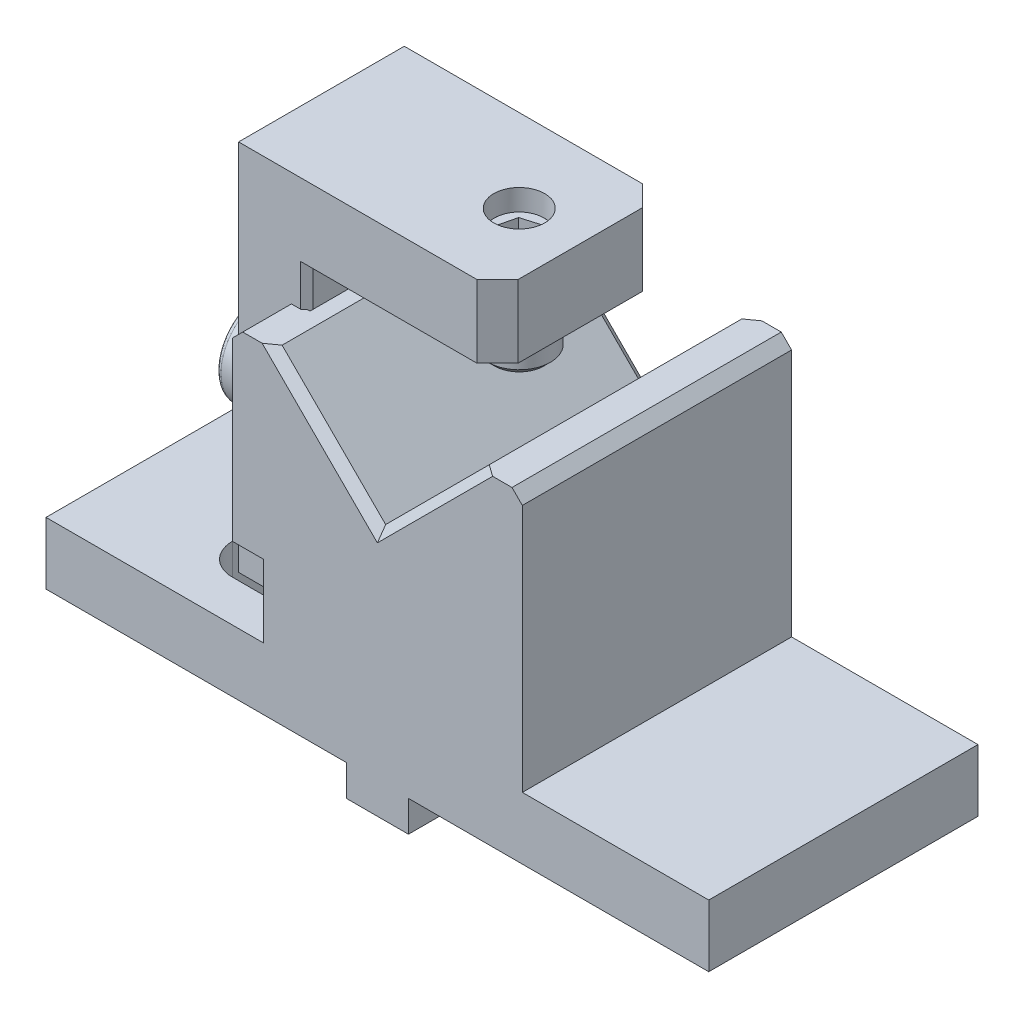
ISO-10303-21;
HEADER;
FILE_DESCRIPTION(('STEP AP214'),'2;1');
FILE_NAME('part.step','',(''),(''),'','','');
FILE_SCHEMA(('AUTOMOTIVE_DESIGN { 1 0 10303 214 1 1 1 1 }'));
ENDSEC;
DATA;
#1=APPLICATION_CONTEXT('core data for automotive mechanical design processes');
#2=APPLICATION_PROTOCOL_DEFINITION('international standard','automotive_design',2000,#1);
#3=PRODUCT_CONTEXT('',#1,'mechanical');
#4=PRODUCT('Part','Part','',(#3));
#5=PRODUCT_RELATED_PRODUCT_CATEGORY('part','',(#4));
#6=PRODUCT_DEFINITION_FORMATION('','',#4);
#7=PRODUCT_DEFINITION_CONTEXT('part definition',#1,'design');
#8=PRODUCT_DEFINITION('design','',#6,#7);
#9=PRODUCT_DEFINITION_SHAPE('','',#8);
#10=(LENGTH_UNIT() NAMED_UNIT(*) SI_UNIT(.MILLI.,.METRE.));
#11=(NAMED_UNIT(*) PLANE_ANGLE_UNIT() SI_UNIT($,.RADIAN.));
#12=(NAMED_UNIT(*) SI_UNIT($,.STERADIAN.) SOLID_ANGLE_UNIT());
#13=UNCERTAINTY_MEASURE_WITH_UNIT(LENGTH_MEASURE(1.E-05),#10,'distance_accuracy_value','');
#14=(GEOMETRIC_REPRESENTATION_CONTEXT(3) GLOBAL_UNCERTAINTY_ASSIGNED_CONTEXT((#13)) GLOBAL_UNIT_ASSIGNED_CONTEXT((#10,
#11,#12)) REPRESENTATION_CONTEXT('',''));
#15=CARTESIAN_POINT('',(0.,0.,0.));
#16=DIRECTION('',(0.,0.,1.));
#17=DIRECTION('',(1.,0.,0.));
#18=AXIS2_PLACEMENT_3D('',#15,#16,#17);
#19=CARTESIAN_POINT('',(15.6694890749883,20.,6.89546202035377));
#20=DIRECTION('',(-0.688793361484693,0.,0.724957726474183));
#21=DIRECTION('',(0.724957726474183,0.,0.688793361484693));
#22=AXIS2_PLACEMENT_3D('',#19,#20,#21);
#23=PLANE('',#22);
#24=DIRECTION('',(0.,1.,0.));
#25=VECTOR('',#24,1.);
#26=CARTESIAN_POINT('',(15.6694890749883,20.,6.89546202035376));
#27=LINE('',#26,#25);
#28=CARTESIAN_POINT('',(15.6694890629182,18.0000000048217,6.89546200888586));
#29=VERTEX_POINT('',#28);
#30=CARTESIAN_POINT('',(15.6694890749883,20.,6.89546202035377));
#31=VERTEX_POINT('',#30);
#32=EDGE_CURVE('E342',#29,#31,#27,.T.);
#33=ORIENTED_EDGE('',*,*,#32,.T.);
#34=DIRECTION('',(0.724957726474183,0.,0.688793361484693));
#35=VECTOR('',#34,1.);
#36=CARTESIAN_POINT('',(15.6694890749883,20.,6.89546202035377));
#37=LINE('',#36,#35);
#38=CARTESIAN_POINT('',(16.2973208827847,20.,7.49197456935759));
#39=VERTEX_POINT('',#38);
#40=EDGE_CURVE('E343',#39,#31,#37,.F.);
#41=ORIENTED_EDGE('',*,*,#40,.F.);
#42=DIRECTION('',(0.,1.,0.));
#43=VECTOR('',#42,1.);
#44=CARTESIAN_POINT('',(16.2973208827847,20.,7.49197456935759));
#45=LINE('',#44,#43);
#46=CARTESIAN_POINT('',(16.2973208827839,17.9999999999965,7.49197456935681));
#47=VERTEX_POINT('',#46);
#48=EDGE_CURVE('E345',#39,#47,#45,.F.);
#49=ORIENTED_EDGE('',*,*,#48,.T.);
#50=CARTESIAN_POINT('',(15.6694890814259,18.0000000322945,6.89546197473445));
#51=CARTESIAN_POINT('',(15.6970784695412,17.9890108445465,6.92167510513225));
#52=CARTESIAN_POINT('',(15.7249060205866,17.979016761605,6.94811449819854));
#53=CARTESIAN_POINT('',(15.7810429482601,17.9615723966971,7.00145105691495));
#54=CARTESIAN_POINT('',(15.8093533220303,17.9541282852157,7.02834916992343));
#55=CARTESIAN_POINT('',(15.8656232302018,17.942540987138,7.08181206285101));
#56=CARTESIAN_POINT('',(15.8935741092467,17.9383206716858,7.10836861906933));
#57=CARTESIAN_POINT('',(15.9496073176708,17.9332834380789,7.16160662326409));
#58=CARTESIAN_POINT('',(15.9776894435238,17.9324623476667,7.18828787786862));
#59=CARTESIAN_POINT('',(16.0301578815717,17.9341748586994,7.23813893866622));
#60=CARTESIAN_POINT('',(16.0545520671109,17.9362879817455,7.26131622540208));
#61=CARTESIAN_POINT('',(16.1031815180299,17.9429839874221,7.3075198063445));
#62=CARTESIAN_POINT('',(16.1274166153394,17.9475691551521,7.33054594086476));
#63=CARTESIAN_POINT('',(16.1761462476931,17.9590311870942,7.3768447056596));
#64=CARTESIAN_POINT('',(16.2006346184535,17.9659566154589,7.40011147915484));
#65=CARTESIAN_POINT('',(16.2492462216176,17.9816744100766,7.44629810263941));
#66=CARTESIAN_POINT('',(16.273370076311,17.9904630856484,7.4692185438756));
#67=CARTESIAN_POINT('',(16.2973208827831,17.9999999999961,7.49197456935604));
#68=B_SPLINE_CURVE_WITH_KNOTS('',3,(#50,#51,#52,#53,#54,#55,#56,#57,#58,#59,#60,#61,#62,#63,#64,
#65,#66,#67),.UNSPECIFIED.,.F.,.F.,(4,2,2,2,2,2,2,2,4),(0.,0.118881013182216,0.238047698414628,
0.35426537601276,0.470340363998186,0.571390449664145,0.672534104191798,0.775920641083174,
0.879104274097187),.UNSPECIFIED.);
#69=EDGE_CURVE('E330',#29,#47,#68,.T.);
#70=ORIENTED_EDGE('',*,*,#69,.F.);
#71=EDGE_LOOP('',(#33,#41,#49,#70));
#72=FACE_BOUND('',#71,.T.);
#73=ADVANCED_FACE('F17',(#72),#23,.F.);
#74=CARTESIAN_POINT('',(5.71666666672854,8.99999999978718,6.5));
#75=DIRECTION('',(-1.,0.,0.));
#76=DIRECTION('',(0.,0.,1.));
#77=AXIS2_PLACEMENT_3D('',#74,#75,#76);
#78=CONICAL_SURFACE('',#77,0.,1.04719755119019);
#79=CARTESIAN_POINT('',(5.7166666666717,9.,6.5));
#80=VERTEX_POINT('',#79);
#81=VERTEX_LOOP('',#80);
#82=FACE_BOUND('',#81,.T.);
#83=CARTESIAN_POINT('',(5.05000000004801,9.000000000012,5.34529946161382));
#84=CARTESIAN_POINT('',(5.06465222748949,8.9560560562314,5.3706705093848));
#85=CARTESIAN_POINT('',(5.07797766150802,8.91173278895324,5.39626055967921));
#86=CARTESIAN_POINT('',(5.10123680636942,8.82231882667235,5.4478837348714));
#87=CARTESIAN_POINT('',(5.11116228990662,8.77722654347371,5.47391777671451));
#88=CARTESIAN_POINT('',(5.12661202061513,8.68760078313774,5.52566323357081));
#89=CARTESIAN_POINT('',(5.13223910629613,8.64308109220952,5.55136668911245));
#90=CARTESIAN_POINT('',(5.13895541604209,8.55383233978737,5.60289448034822));
#91=CARTESIAN_POINT('',(5.14005020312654,8.50910360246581,5.62871862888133));
#92=CARTESIAN_POINT('',(5.13776685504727,8.4255327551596,5.67696828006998));
#93=CARTESIAN_POINT('',(5.134949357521,8.38667810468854,5.69940102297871));
#94=CARTESIAN_POINT('',(5.12602134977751,8.30922192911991,5.74412036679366));
#95=CARTESIAN_POINT('',(5.11990779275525,8.2706206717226,5.76640681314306));
#96=CARTESIAN_POINT('',(5.10462508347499,8.19300492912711,5.81121828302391));
#97=CARTESIAN_POINT('',(5.09539117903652,8.15400026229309,5.83373763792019));
#98=CARTESIAN_POINT('',(5.07443411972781,8.07657251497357,5.87844056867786));
#99=CARTESIAN_POINT('',(5.06271588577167,8.03814844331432,5.90062471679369));
#100=CARTESIAN_POINT('',(5.05000000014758,7.99999999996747,5.92264973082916));
#101=B_SPLINE_CURVE_WITH_KNOTS('',3,(#83,#84,#85,#86,#87,#88,#89,#90,#91,#92,#93,#94,#95,#96,
#97,#98,#99,#100),.UNSPECIFIED.,.F.,.F.,(4,2,2,2,2,2,2,2,4),(0.,0.158508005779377,
0.317396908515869,0.472353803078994,0.627120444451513,0.761853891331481,0.896712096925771,
1.03456081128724,1.17213898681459),.UNSPECIFIED.);
#102=CARTESIAN_POINT('',(5.05000000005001,9.000000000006,5.34529946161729));
#103=VERTEX_POINT('',#102);
#104=CARTESIAN_POINT('',(5.05000000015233,8.,5.92264973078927));
#105=VERTEX_POINT('',#104);
#106=EDGE_CURVE('E438',#103,#105,#101,.T.);
#107=ORIENTED_EDGE('',*,*,#106,.T.);
#108=CARTESIAN_POINT('',(5.05000000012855,8.00000000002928,5.92264973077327));
#109=CARTESIAN_POINT('',(5.06368311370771,8.00000000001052,5.97004446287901));
#110=CARTESIAN_POINT('',(5.07621039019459,8.00000000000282,6.01781412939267));
#111=CARTESIAN_POINT('',(5.09835079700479,7.99999999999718,6.11412944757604));
#112=CARTESIAN_POINT('',(5.10795740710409,7.99999999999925,6.16267658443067));
#113=CARTESIAN_POINT('',(5.12340599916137,8.00000000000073,6.25922611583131));
#114=CARTESIAN_POINT('',(5.12933034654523,8.0000000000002,6.30721491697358));
#115=CARTESIAN_POINT('',(5.13728343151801,7.9999999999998,6.40346938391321));
#116=CARTESIAN_POINT('',(5.13931639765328,7.99999999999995,6.45173469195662));
#117=CARTESIAN_POINT('',(5.13931639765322,8.00000000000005,6.54826530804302));
#118=CARTESIAN_POINT('',(5.13728343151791,8.00000000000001,6.59653061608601));
#119=CARTESIAN_POINT('',(5.12933034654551,7.99999999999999,6.69278508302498));
#120=CARTESIAN_POINT('',(5.12340599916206,8.,6.74077388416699));
#121=CARTESIAN_POINT('',(5.10795740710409,8.,6.83732341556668));
#122=CARTESIAN_POINT('',(5.09835079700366,8.,6.88587055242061));
#123=CARTESIAN_POINT('',(5.07621039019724,8.,6.98218587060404));
#124=CARTESIAN_POINT('',(5.06368311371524,8.,7.02995553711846));
#125=CARTESIAN_POINT('',(5.05000000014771,8.,7.07735026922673));
#126=B_SPLINE_CURVE_WITH_KNOTS('',3,(#108,#109,#110,#111,#112,#113,#114,#115,#116,#117,#118,
#119,#120,#121,#122,#123,#124,#125),.UNSPECIFIED.,.F.,.F.,(4,2,2,2,2,2,2,2,4),(0.,
0.148036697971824,0.296401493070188,0.441315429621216,0.586071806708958,0.730828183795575,
0.875742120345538,1.02410691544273,1.17214361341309),.UNSPECIFIED.);
#127=CARTESIAN_POINT('',(5.05000000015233,7.99999999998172,7.07735026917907));
#128=VERTEX_POINT('',#127);
#129=EDGE_CURVE('E415',#105,#128,#126,.T.);
#130=ORIENTED_EDGE('',*,*,#129,.T.);
#131=CARTESIAN_POINT('',(5.05000000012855,7.9999999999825,7.07735026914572));
#132=CARTESIAN_POINT('',(5.06465222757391,8.04394394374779,7.10272131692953));
#133=CARTESIAN_POINT('',(5.07797766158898,8.08826721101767,7.12831136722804));
#134=CARTESIAN_POINT('',(5.10123680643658,8.17768117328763,7.17993454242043));
#135=CARTESIAN_POINT('',(5.11116228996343,8.22277345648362,7.20596858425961));
#136=CARTESIAN_POINT('',(5.12661202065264,8.31239921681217,7.25771404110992));
#137=CARTESIAN_POINT('',(5.13223910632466,8.35691890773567,7.28341749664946));
#138=CARTESIAN_POINT('',(5.13895541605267,8.44616766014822,7.33494528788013));
#139=CARTESIAN_POINT('',(5.14005020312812,8.49089639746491,7.36076943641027));
#140=CARTESIAN_POINT('',(5.13776685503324,8.57446724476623,7.40901908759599));
#141=CARTESIAN_POINT('',(5.13494935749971,8.61332189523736,7.43145183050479));
#142=CARTESIAN_POINT('',(5.12602134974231,8.69077807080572,7.47617117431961));
#143=CARTESIAN_POINT('',(5.11990779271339,8.72937932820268,7.4984576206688));
#144=CARTESIAN_POINT('',(5.10462508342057,8.80699507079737,7.54326909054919));
#145=CARTESIAN_POINT('',(5.09539117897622,8.84599973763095,7.5657884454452));
#146=CARTESIAN_POINT('',(5.0744341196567,8.92342748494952,7.61049137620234));
#147=CARTESIAN_POINT('',(5.06271588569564,8.96185155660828,7.63267552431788));
#148=CARTESIAN_POINT('',(5.05000000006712,8.99999999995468,7.65470053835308));
#149=B_SPLINE_CURVE_WITH_KNOTS('',3,(#131,#132,#133,#134,#135,#136,#137,#138,#139,#140,#141,
#142,#143,#144,#145,#146,#147,#148),.UNSPECIFIED.,.F.,.F.,(4,2,2,2,2,2,2,2,4),(0.,
0.158508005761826,0.31739690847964,0.472353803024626,0.627120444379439,0.76185389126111,
0.896712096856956,1.03456081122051,1.17213898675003),.UNSPECIFIED.);
#150=CARTESIAN_POINT('',(5.05000000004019,8.99999999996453,7.65470053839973));
#151=VERTEX_POINT('',#150);
#152=EDGE_CURVE('E401',#128,#151,#149,.T.);
#153=ORIENTED_EDGE('',*,*,#152,.T.);
#154=CARTESIAN_POINT('',(5.05000000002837,8.99999999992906,7.65470053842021));
#155=CARTESIAN_POINT('',(5.06465222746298,9.043943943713,7.6293294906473));
#156=CARTESIAN_POINT('',(5.07797766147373,9.08826721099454,7.60373944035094));
#157=CARTESIAN_POINT('',(5.10123680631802,9.17768117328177,7.55211626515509));
#158=CARTESIAN_POINT('',(5.1111622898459,9.22277345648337,7.52608222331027));
#159=CARTESIAN_POINT('',(5.12661202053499,9.31239921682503,7.47433676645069));
#160=CARTESIAN_POINT('',(5.13223910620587,9.356918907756,7.44863331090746));
#161=CARTESIAN_POINT('',(5.13895541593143,9.4461676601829,7.39710551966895));
#162=CARTESIAN_POINT('',(5.14005020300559,9.49089639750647,7.37128137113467));
#163=CARTESIAN_POINT('',(5.13776685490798,9.57446724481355,7.32303171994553));
#164=CARTESIAN_POINT('',(5.13494935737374,9.61332189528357,7.30059897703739));
#165=CARTESIAN_POINT('',(5.12602134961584,9.69077807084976,7.25587963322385));
#166=CARTESIAN_POINT('',(5.11990779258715,9.72937932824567,7.23359318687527));
#167=CARTESIAN_POINT('',(5.10462508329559,9.80699507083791,7.18878171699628));
#168=CARTESIAN_POINT('',(5.09539117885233,9.8459997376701,7.16626236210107));
#169=CARTESIAN_POINT('',(5.07443411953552,9.92342748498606,7.12155943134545));
#170=CARTESIAN_POINT('',(5.06271588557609,9.96185155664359,7.09937528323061));
#171=CARTESIAN_POINT('',(5.04999999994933,9.99999999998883,7.07735026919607));
#172=B_SPLINE_CURVE_WITH_KNOTS('',3,(#154,#155,#156,#157,#158,#159,#160,#161,#162,#163,#164,
#165,#166,#167,#168,#169,#170,#171),.UNSPECIFIED.,.F.,.F.,(4,2,2,2,2,2,2,2,4),(0.,
0.158508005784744,0.317396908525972,0.472353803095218,0.627120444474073,0.761853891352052,
0.896712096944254,1.03456081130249,1.17213898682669),.UNSPECIFIED.);
#173=CARTESIAN_POINT('',(5.0499999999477,10.,7.07735026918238));
#174=VERTEX_POINT('',#173);
#175=EDGE_CURVE('E394',#151,#174,#172,.T.);
#176=ORIENTED_EDGE('',*,*,#175,.T.);
#177=CARTESIAN_POINT('',(5.04999999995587,10.0000000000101,7.07735026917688));
#178=CARTESIAN_POINT('',(5.063683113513,10.0000000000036,7.02995553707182));
#179=CARTESIAN_POINT('',(5.07621038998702,10.000000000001,6.98218587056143));
#180=CARTESIAN_POINT('',(5.09835079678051,9.99999999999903,6.88587055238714));
#181=CARTESIAN_POINT('',(5.10795740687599,9.99999999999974,6.83732341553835));
#182=CARTESIAN_POINT('',(5.12340599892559,10.0000000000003,6.74077388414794));
#183=CARTESIAN_POINT('',(5.1293303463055,10.0000000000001,6.69278508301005));
#184=CARTESIAN_POINT('',(5.13728343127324,9.99999999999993,6.59653061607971));
#185=CARTESIAN_POINT('',(5.13931639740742,9.99999999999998,6.54826530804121));
#186=CARTESIAN_POINT('',(5.13931639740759,10.,6.45173469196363));
#187=CARTESIAN_POINT('',(5.13728343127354,10.,6.40346938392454));
#188=CARTESIAN_POINT('',(5.12933034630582,9.99999999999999,6.30721491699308));
#189=CARTESIAN_POINT('',(5.1234059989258,10.,6.25922611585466));
#190=CARTESIAN_POINT('',(5.10795740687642,10.,6.162676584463));
#191=CARTESIAN_POINT('',(5.09835079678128,10.,6.1141294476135));
#192=CARTESIAN_POINT('',(5.07621038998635,10.,6.01781412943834));
#193=CARTESIAN_POINT('',(5.06368311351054,10.,5.97004446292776));
#194=CARTESIAN_POINT('',(5.04999999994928,10.,5.92264973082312));
#195=B_SPLINE_CURVE_WITH_KNOTS('',3,(#177,#178,#179,#180,#181,#182,#183,#184,#185,#186,#187,
#188,#189,#190,#191,#192,#193,#194),.UNSPECIFIED.,.F.,.F.,(4,2,2,2,2,2,2,2,4),(0.,
0.148036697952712,0.296401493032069,0.441315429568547,0.586071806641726,0.73082818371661,
0.875742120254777,1.02410691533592,1.17214361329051),.UNSPECIFIED.);
#196=CARTESIAN_POINT('',(5.04999999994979,9.99999999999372,5.922649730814));
#197=VERTEX_POINT('',#196);
#198=EDGE_CURVE('E354',#174,#197,#195,.T.);
#199=ORIENTED_EDGE('',*,*,#198,.T.);
#200=CARTESIAN_POINT('',(5.04999999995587,9.99999999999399,5.9226497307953));
#201=CARTESIAN_POINT('',(5.06465222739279,9.95605605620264,5.89727868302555));
#202=CARTESIAN_POINT('',(5.0779776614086,9.91173278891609,5.87168863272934));
#203=CARTESIAN_POINT('',(5.10123680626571,9.82231882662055,5.82006545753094));
#204=CARTESIAN_POINT('',(5.11116228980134,9.77722654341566,5.7940314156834));
#205=CARTESIAN_POINT('',(5.1266120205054,9.68760078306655,5.74228595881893));
#206=CARTESIAN_POINT('',(5.13223910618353,9.64308109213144,5.71658250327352));
#207=CARTESIAN_POINT('',(5.13895541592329,9.55383233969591,5.66505471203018));
#208=CARTESIAN_POINT('',(5.14005020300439,9.50910360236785,5.63923056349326));
#209=CARTESIAN_POINT('',(5.13776685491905,9.4255327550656,5.59098091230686));
#210=CARTESIAN_POINT('',(5.13494935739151,9.38667810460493,5.56854816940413));
#211=CARTESIAN_POINT('',(5.12602134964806,9.30922192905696,5.52382882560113));
#212=CARTESIAN_POINT('',(5.11990779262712,9.27062067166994,5.50154237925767));
#213=CARTESIAN_POINT('',(5.10462508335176,9.19300492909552,5.45673090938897));
#214=CARTESIAN_POINT('',(5.09539117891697,9.15400026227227,5.43421155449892));
#215=CARTESIAN_POINT('',(5.07443411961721,9.07657251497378,5.38950862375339));
#216=CARTESIAN_POINT('',(5.06271588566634,9.03814844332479,5.36732447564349));
#217=CARTESIAN_POINT('',(5.05000000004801,8.999999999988,5.34529946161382));
#218=B_SPLINE_CURVE_WITH_KNOTS('',3,(#200,#201,#202,#203,#204,#205,#206,#207,#208,#209,#210,
#211,#212,#213,#214,#215,#216,#217),.UNSPECIFIED.,.F.,.F.,(4,2,2,2,2,2,2,2,4),(0.,
0.158508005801,0.317396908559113,0.472353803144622,0.627120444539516,0.761853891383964,
0.896712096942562,1.03456081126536,1.1721389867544),.UNSPECIFIED.);
#219=EDGE_CURVE('E424',#197,#103,#218,.T.);
#220=ORIENTED_EDGE('',*,*,#219,.T.);
#221=EDGE_LOOP('',(#107,#130,#153,#176,#199,#220));
#222=FACE_BOUND('',#221,.T.);
#223=ADVANCED_FACE('F406',(#82,#222),#78,.F.);
#224=CARTESIAN_POINT('',(15.8721681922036,20.,6.05348745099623));
#225=DIRECTION('',(-0.9722284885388,0.,-0.234033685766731));
#226=DIRECTION('',(-0.234033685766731,0.,0.9722284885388));
#227=AXIS2_PLACEMENT_3D('',#224,#225,#226);
#228=PLANE('',#227);
#229=DIRECTION('',(0.,1.,0.));
#230=VECTOR('',#229,1.);
#231=CARTESIAN_POINT('',(15.8721681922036,20.,6.05348745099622));
#232=LINE('',#231,#230);
#233=CARTESIAN_POINT('',(15.8721682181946,17.9999999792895,6.05348747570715));
#234=VERTEX_POINT('',#233);
#235=CARTESIAN_POINT('',(15.8721681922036,20.,6.05348745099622));
#236=VERTEX_POINT('',#235);
#237=EDGE_CURVE('E431',#234,#236,#232,.T.);
#238=ORIENTED_EDGE('',*,*,#237,.T.);
#239=DIRECTION('',(-0.234033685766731,0.,0.9722284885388));
#240=VECTOR('',#239,1.);
#241=CARTESIAN_POINT('',(15.8721681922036,20.,6.05348745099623));
#242=LINE('',#241,#240);
#243=EDGE_CURVE('E1080',#31,#236,#242,.F.);
#244=ORIENTED_EDGE('',*,*,#243,.F.);
#245=ORIENTED_EDGE('',*,*,#32,.F.);
#246=CARTESIAN_POINT('',(15.872168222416,18.0000000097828,6.05348754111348));
#247=CARTESIAN_POINT('',(15.8632616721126,17.9890108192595,6.09048721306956));
#248=CARTESIAN_POINT('',(15.8542782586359,17.9790167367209,6.12780627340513));
#249=CARTESIAN_POINT('',(15.836155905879,17.9615723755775,6.20309055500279));
#250=CARTESIAN_POINT('',(15.8270166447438,17.9541282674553,6.24105711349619));
#251=CARTESIAN_POINT('',(15.8088513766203,17.9425409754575,6.31651972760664));
#252=CARTESIAN_POINT('',(15.799828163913,17.9383206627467,6.35400417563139));
#253=CARTESIAN_POINT('',(15.7817393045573,17.9332834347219,6.42914935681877));
#254=CARTESIAN_POINT('',(15.7726737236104,17.9324623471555,6.46680981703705));
#255=CARTESIAN_POINT('',(15.7557356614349,17.9341748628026,6.53717433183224));
#256=CARTESIAN_POINT('',(15.7478606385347,17.9362879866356,6.56988894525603));
#257=CARTESIAN_POINT('',(15.732161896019,17.9429839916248,6.63510504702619));
#258=CARTESIAN_POINT('',(15.7243382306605,17.9475691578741,6.66760630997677));
#259=CARTESIAN_POINT('',(15.7086071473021,17.9590311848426,6.73295676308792));
#260=CARTESIAN_POINT('',(15.7007017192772,17.9659566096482,6.76579768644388));
#261=CARTESIAN_POINT('',(15.6850087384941,17.9816743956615,6.83098985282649));
#262=CARTESIAN_POINT('',(15.6772209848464,17.9904630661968,6.86334193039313));
#263=CARTESIAN_POINT('',(15.6694890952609,17.9999999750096,6.89546193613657));
#264=B_SPLINE_CURVE_WITH_KNOTS('',3,(#246,#247,#248,#249,#250,#251,#252,#253,#254,#255,#256,
#257,#258,#259,#260,#261,#262,#263),.UNSPECIFIED.,.F.,.F.,(4,2,2,2,2,2,2,2,4),(0.,
0.118881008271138,0.238047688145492,0.354265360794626,0.470340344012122,0.571390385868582,
0.672533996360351,0.775920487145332,0.879104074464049),.UNSPECIFIED.);
#265=EDGE_CURVE('E341',#234,#29,#264,.T.);
#266=ORIENTED_EDGE('',*,*,#265,.F.);
#267=EDGE_LOOP('',(#238,#244,#245,#266));
#268=FACE_BOUND('',#267,.T.);
#269=ADVANCED_FACE('F380',(#268),#228,.F.);
#270=CARTESIAN_POINT('',(16.2973208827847,20.,7.49197456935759));
#271=DIRECTION('',(0.283435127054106,0.,0.958991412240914));
#272=DIRECTION('',(0.958991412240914,0.,-0.283435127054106));
#273=AXIS2_PLACEMENT_3D('',#270,#271,#272);
#274=PLANE('',#273);
#275=ORIENTED_EDGE('',*,*,#48,.F.);
#276=DIRECTION('',(0.958991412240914,0.,-0.283435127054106));
#277=VECTOR('',#276,1.);
#278=CARTESIAN_POINT('',(16.2973208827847,20.,7.49197456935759));
#279=LINE('',#278,#277);
#280=CARTESIAN_POINT('',(17.1278318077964,20.,7.24651254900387));
#281=VERTEX_POINT('',#280);
#282=EDGE_CURVE('E348',#281,#39,#279,.F.);
#283=ORIENTED_EDGE('',*,*,#282,.F.);
#284=DIRECTION('',(0.,1.,0.));
#285=VECTOR('',#284,1.);
#286=CARTESIAN_POINT('',(17.1278318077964,20.,7.24651254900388));
#287=LINE('',#286,#285);
#288=CARTESIAN_POINT('',(17.1278316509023,17.9999998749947,7.24651239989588));
#289=VERTEX_POINT('',#288);
#290=EDGE_CURVE('E352',#281,#289,#287,.F.);
#291=ORIENTED_EDGE('',*,*,#290,.T.);
#292=CARTESIAN_POINT('',(16.2973208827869,17.9999999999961,7.49197456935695));
#293=CARTESIAN_POINT('',(16.3338168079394,17.9890108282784,7.48118800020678));
#294=CARTESIAN_POINT('',(16.3706277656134,17.9790167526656,7.47030832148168));
#295=CARTESIAN_POINT('',(16.4448870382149,17.9615723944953,7.44836058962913));
#296=CARTESIAN_POINT('',(16.4823366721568,17.9541282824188,7.4372921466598));
#297=CARTESIAN_POINT('',(16.556771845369,17.9425409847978,7.41529242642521));
#298=CARTESIAN_POINT('',(16.5937459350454,17.9383206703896,7.40436453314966));
#299=CARTESIAN_POINT('',(16.6678679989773,17.9332834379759,7.38245735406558));
#300=CARTESIAN_POINT('',(16.7050157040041,17.9324623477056,7.37147814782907));
#301=CARTESIAN_POINT('',(16.7744222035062,17.9341748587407,7.35096467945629));
#302=CARTESIAN_POINT('',(16.8066914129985,17.9362879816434,7.34142733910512));
#303=CARTESIAN_POINT('',(16.8710196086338,17.942983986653,7.32241479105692));
#304=CARTESIAN_POINT('',(16.9030783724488,17.9475691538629,7.31293964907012));
#305=CARTESIAN_POINT('',(16.967539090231,17.9590311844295,7.29388793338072));
#306=CARTESIAN_POINT('',(16.9999328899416,17.9659566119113,7.28431376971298));
#307=CARTESIAN_POINT('',(17.0642374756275,17.981674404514,7.26530819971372));
#308=CARTESIAN_POINT('',(17.096149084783,17.9904630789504,7.25587655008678));
#309=CARTESIAN_POINT('',(17.1278317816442,17.9999999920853,7.24651255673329));
#310=B_SPLINE_CURVE_WITH_KNOTS('',3,(#292,#293,#294,#295,#296,#297,#298,#299,#300,#301,#302,
#303,#304,#305,#306,#307,#308,#309),.UNSPECIFIED.,.F.,.F.,(4,2,2,2,2,2,2,2,4),(0.,
0.118881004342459,0.23804768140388,0.354265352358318,0.470340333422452,0.571390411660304,
0.672534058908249,0.775920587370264,0.879104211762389),.UNSPECIFIED.);
#311=EDGE_CURVE('E337',#47,#289,#310,.T.);
#312=ORIENTED_EDGE('',*,*,#311,.F.);
#313=EDGE_LOOP('',(#275,#283,#291,#312));
#314=FACE_BOUND('',#313,.T.);
#315=ADVANCED_FACE('F350',(#314),#274,.F.);
#316=CARTESIAN_POINT('',(3.95000000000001,10.,7.07735026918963));
#317=DIRECTION('',(0.,1.,0.));
#318=DIRECTION('',(0.,0.,1.));
#319=AXIS2_PLACEMENT_3D('',#316,#317,#318);
#320=PLANE('',#319);
#321=DIRECTION('',(1.,0.,0.));
#322=VECTOR('',#321,1.);
#323=CARTESIAN_POINT('',(3.95000000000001,10.,7.07735026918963));
#324=LINE('',#323,#322);
#325=CARTESIAN_POINT('',(3.95000000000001,10.,7.07735026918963));
#326=VERTEX_POINT('',#325);
#327=EDGE_CURVE('E356',#174,#326,#324,.F.);
#328=ORIENTED_EDGE('',*,*,#327,.T.);
#329=DIRECTION('',(0.,0.,1.));
#330=VECTOR('',#329,1.);
#331=CARTESIAN_POINT('',(3.95000000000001,10.,6.5));
#332=LINE('',#331,#330);
#333=CARTESIAN_POINT('',(3.95,10.,5.92264973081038));
#334=VERTEX_POINT('',#333);
#335=EDGE_CURVE('E461',#334,#326,#332,.T.);
#336=ORIENTED_EDGE('',*,*,#335,.F.);
#337=DIRECTION('',(1.,0.,0.));
#338=VECTOR('',#337,1.);
#339=CARTESIAN_POINT('',(3.95000000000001,10.,5.92264973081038));
#340=LINE('',#339,#338);
#341=EDGE_CURVE('E432',#334,#197,#340,.T.);
#342=ORIENTED_EDGE('',*,*,#341,.T.);
#343=ORIENTED_EDGE('',*,*,#198,.F.);
#344=EDGE_LOOP('',(#328,#336,#342,#343));
#345=FACE_BOUND('',#344,.T.);
#346=ADVANCED_FACE('F379',(#345),#320,.F.);
#347=CARTESIAN_POINT('',(3.95000000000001,9.,7.65470053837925));
#348=DIRECTION('',(0.,0.500000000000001,0.866025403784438));
#349=DIRECTION('',(0.,-0.866025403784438,0.500000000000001));
#350=AXIS2_PLACEMENT_3D('',#347,#348,#349);
#351=PLANE('',#350);
#352=DIRECTION('',(1.,0.,0.));
#353=VECTOR('',#352,1.);
#354=CARTESIAN_POINT('',(3.95000000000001,9.,7.65470053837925));
#355=LINE('',#354,#353);
#356=CARTESIAN_POINT('',(3.95000000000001,9.,7.65470053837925));
#357=VERTEX_POINT('',#356);
#358=EDGE_CURVE('E400',#151,#357,#355,.F.);
#359=ORIENTED_EDGE('',*,*,#358,.T.);
#360=DIRECTION('',(0.,-0.866025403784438,0.500000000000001));
#361=VECTOR('',#360,1.);
#362=CARTESIAN_POINT('',(3.95000000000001,10.,7.07735026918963));
#363=LINE('',#362,#361);
#364=EDGE_CURVE('E1094',#326,#357,#363,.T.);
#365=ORIENTED_EDGE('',*,*,#364,.F.);
#366=ORIENTED_EDGE('',*,*,#327,.F.);
#367=ORIENTED_EDGE('',*,*,#175,.F.);
#368=EDGE_LOOP('',(#359,#365,#366,#367));
#369=FACE_BOUND('',#368,.T.);
#370=ADVANCED_FACE('F385',(#369),#351,.F.);
#371=CARTESIAN_POINT('',(3.95000000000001,8.,7.07735026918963));
#372=DIRECTION('',(0.,-0.5,0.866025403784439));
#373=DIRECTION('',(0.,-0.866025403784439,-0.5));
#374=AXIS2_PLACEMENT_3D('',#371,#372,#373);
#375=PLANE('',#374);
#376=DIRECTION('',(1.,0.,0.));
#377=VECTOR('',#376,1.);
#378=CARTESIAN_POINT('',(3.95000000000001,8.,7.07735026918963));
#379=LINE('',#378,#377);
#380=CARTESIAN_POINT('',(3.95000000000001,8.,7.07735026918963));
#381=VERTEX_POINT('',#380);
#382=EDGE_CURVE('E1367',#128,#381,#379,.F.);
#383=ORIENTED_EDGE('',*,*,#382,.T.);
#384=DIRECTION('',(0.,-0.866025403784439,-0.499999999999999));
#385=VECTOR('',#384,1.);
#386=CARTESIAN_POINT('',(3.95000000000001,9.,7.65470053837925));
#387=LINE('',#386,#385);
#388=EDGE_CURVE('E1102',#357,#381,#387,.T.);
#389=ORIENTED_EDGE('',*,*,#388,.F.);
#390=ORIENTED_EDGE('',*,*,#358,.F.);
#391=ORIENTED_EDGE('',*,*,#152,.F.);
#392=EDGE_LOOP('',(#383,#389,#390,#391));
#393=FACE_BOUND('',#392,.T.);
#394=ADVANCED_FACE('F390',(#393),#375,.F.);
#395=CARTESIAN_POINT('',(3.95000000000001,8.,5.92264973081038));
#396=DIRECTION('',(0.,-1.,0.));
#397=DIRECTION('',(1.,0.,0.));
#398=AXIS2_PLACEMENT_3D('',#395,#396,#397);
#399=PLANE('',#398);
#400=DIRECTION('',(1.,0.,0.));
#401=VECTOR('',#400,1.);
#402=CARTESIAN_POINT('',(3.95,8.,5.92264973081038));
#403=LINE('',#402,#401);
#404=CARTESIAN_POINT('',(3.95000000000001,8.,5.92264973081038));
#405=VERTEX_POINT('',#404);
#406=EDGE_CURVE('E1372',#105,#405,#403,.F.);
#407=ORIENTED_EDGE('',*,*,#406,.T.);
#408=DIRECTION('',(0.,0.,1.));
#409=VECTOR('',#408,1.);
#410=CARTESIAN_POINT('',(3.95000000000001,8.,6.5));
#411=LINE('',#410,#409);
#412=EDGE_CURVE('E1098',#381,#405,#411,.F.);
#413=ORIENTED_EDGE('',*,*,#412,.F.);
#414=ORIENTED_EDGE('',*,*,#382,.F.);
#415=ORIENTED_EDGE('',*,*,#129,.F.);
#416=EDGE_LOOP('',(#407,#413,#414,#415));
#417=FACE_BOUND('',#416,.T.);
#418=ADVANCED_FACE('F1442',(#417),#399,.F.);
#419=CARTESIAN_POINT('',(3.95,9.,5.34529946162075));
#420=DIRECTION('',(0.,-0.5,-0.866025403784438));
#421=DIRECTION('',(0.,0.866025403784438,-0.5));
#422=AXIS2_PLACEMENT_3D('',#419,#420,#421);
#423=PLANE('',#422);
#424=DIRECTION('',(1.,0.,0.));
#425=VECTOR('',#424,1.);
#426=CARTESIAN_POINT('',(3.95000000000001,9.,5.34529946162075));
#427=LINE('',#426,#425);
#428=CARTESIAN_POINT('',(3.95,9.,5.34529946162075));
#429=VERTEX_POINT('',#428);
#430=EDGE_CURVE('E1379',#103,#429,#427,.F.);
#431=ORIENTED_EDGE('',*,*,#430,.T.);
#432=DIRECTION('',(0.,0.866025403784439,-0.5));
#433=VECTOR('',#432,1.);
#434=CARTESIAN_POINT('',(3.95000000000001,8.,5.92264973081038));
#435=LINE('',#434,#433);
#436=EDGE_CURVE('E1090',#405,#429,#435,.T.);
#437=ORIENTED_EDGE('',*,*,#436,.F.);
#438=ORIENTED_EDGE('',*,*,#406,.F.);
#439=ORIENTED_EDGE('',*,*,#106,.F.);
#440=EDGE_LOOP('',(#431,#437,#438,#439));
#441=FACE_BOUND('',#440,.T.);
#442=ADVANCED_FACE('F448',(#441),#423,.F.);
#443=CARTESIAN_POINT('',(3.95000000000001,10.,5.92264973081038));
#444=DIRECTION('',(0.,0.5,-0.866025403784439));
#445=DIRECTION('',(0.,0.866025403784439,0.5));
#446=AXIS2_PLACEMENT_3D('',#443,#444,#445);
#447=PLANE('',#446);
#448=ORIENTED_EDGE('',*,*,#341,.F.);
#449=DIRECTION('',(0.,0.866025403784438,0.500000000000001));
#450=VECTOR('',#449,1.);
#451=CARTESIAN_POINT('',(3.95,9.,5.34529946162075));
#452=LINE('',#451,#450);
#453=EDGE_CURVE('E1086',#429,#334,#452,.T.);
#454=ORIENTED_EDGE('',*,*,#453,.F.);
#455=ORIENTED_EDGE('',*,*,#430,.F.);
#456=ORIENTED_EDGE('',*,*,#219,.F.);
#457=EDGE_LOOP('',(#448,#454,#455,#456));
#458=FACE_BOUND('',#457,.T.);
#459=ADVANCED_FACE('F443',(#458),#447,.F.);
#460=CARTESIAN_POINT('',(16.7026791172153,20.,5.8080254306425));
#461=DIRECTION('',(-0.283435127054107,0.,-0.958991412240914));
#462=DIRECTION('',(-0.958991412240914,0.,0.283435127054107));
#463=AXIS2_PLACEMENT_3D('',#460,#461,#462);
#464=PLANE('',#463);
#465=DIRECTION('',(0.,1.,0.));
#466=VECTOR('',#465,1.);
#467=CARTESIAN_POINT('',(16.7026791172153,20.,5.8080254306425));
#468=LINE('',#467,#466);
#469=CARTESIAN_POINT('',(16.7026791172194,17.9999999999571,5.80802543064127));
#470=VERTEX_POINT('',#469);
#471=CARTESIAN_POINT('',(16.7026791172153,20.,5.8080254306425));
#472=VERTEX_POINT('',#471);
#473=EDGE_CURVE('E1089',#470,#472,#468,.T.);
#474=ORIENTED_EDGE('',*,*,#473,.T.);
#475=DIRECTION('',(-0.958991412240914,0.,0.283435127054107));
#476=VECTOR('',#475,1.);
#477=CARTESIAN_POINT('',(16.7026791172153,20.,5.8080254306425));
#478=LINE('',#477,#476);
#479=EDGE_CURVE('E1069',#236,#472,#478,.F.);
#480=ORIENTED_EDGE('',*,*,#479,.F.);
#481=ORIENTED_EDGE('',*,*,#237,.F.);
#482=CARTESIAN_POINT('',(16.7026791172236,17.9999999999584,5.80802543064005));
#483=CARTESIAN_POINT('',(16.6661831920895,17.9890108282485,5.81881199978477));
#484=CARTESIAN_POINT('',(16.6293722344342,17.9790167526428,5.82969167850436));
#485=CARTESIAN_POINT('',(16.5551129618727,17.9615723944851,5.85163941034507));
#486=CARTESIAN_POINT('',(16.5176633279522,17.9541282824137,5.86270785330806));
#487=CARTESIAN_POINT('',(16.4432281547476,17.9425409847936,5.88470757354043));
#488=CARTESIAN_POINT('',(16.4062540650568,17.9383206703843,5.89563546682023));
#489=CARTESIAN_POINT('',(16.3321320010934,17.9332834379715,5.91754264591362));
#490=CARTESIAN_POINT('',(16.2949842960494,17.9324623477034,5.92852185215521));
#491=CARTESIAN_POINT('',(16.2255778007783,17.9341748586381,5.94903531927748));
#492=CARTESIAN_POINT('',(16.1933085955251,17.936287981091,5.95857265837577));
#493=CARTESIAN_POINT('',(16.1289804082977,17.9429839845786,5.97758520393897));
#494=CARTESIAN_POINT('',(16.0969216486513,17.9475691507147,5.98706034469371));
#495=CARTESIAN_POINT('',(16.032460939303,17.9590311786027,6.00611205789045));
#496=CARTESIAN_POINT('',(16.0000671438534,17.9659566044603,6.0156862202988));
#497=CARTESIAN_POINT('',(15.9357625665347,17.9816743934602,6.0346917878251));
#498=CARTESIAN_POINT('',(15.9038509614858,17.9904630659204,6.04412343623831));
#499=CARTESIAN_POINT('',(15.8721682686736,17.9999999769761,6.05348742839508));
#500=B_SPLINE_CURVE_WITH_KNOTS('',3,(#482,#483,#484,#485,#486,#487,#488,#489,#490,#491,#492,
#493,#494,#495,#496,#497,#498,#499),.UNSPECIFIED.,.F.,.F.,(4,2,2,2,2,2,2,2,4),(0.,
0.118881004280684,0.238047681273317,0.35426535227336,0.470340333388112,0.571390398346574,
0.672534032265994,0.775920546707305,0.87910415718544),.UNSPECIFIED.);
#501=EDGE_CURVE('E456',#470,#234,#500,.T.);
#502=ORIENTED_EDGE('',*,*,#501,.F.);
#503=EDGE_LOOP('',(#474,#480,#481,#502));
#504=FACE_BOUND('',#503,.T.);
#505=ADVANCED_FACE('F447',(#504),#464,.F.);
#506=CARTESIAN_POINT('',(17.1278318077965,20.,7.24651254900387));
#507=DIRECTION('',(0.9722284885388,0.,0.234033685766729));
#508=DIRECTION('',(0.234033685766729,0.,-0.9722284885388));
#509=AXIS2_PLACEMENT_3D('',#506,#507,#508);
#510=PLANE('',#509);
#511=ORIENTED_EDGE('',*,*,#290,.F.);
#512=DIRECTION('',(0.234033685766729,0.,-0.9722284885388));
#513=VECTOR('',#512,1.);
#514=CARTESIAN_POINT('',(17.1278318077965,20.,7.24651254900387));
#515=LINE('',#514,#513);
#516=CARTESIAN_POINT('',(17.3305109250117,20.,6.40453797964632));
#517=VERTEX_POINT('',#516);
#518=EDGE_CURVE('E1061',#517,#281,#515,.F.);
#519=ORIENTED_EDGE('',*,*,#518,.F.);
#520=DIRECTION('',(0.,1.,0.));
#521=VECTOR('',#520,1.);
#522=CARTESIAN_POINT('',(17.3305109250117,20.,6.40453797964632));
#523=LINE('',#522,#521);
#524=CARTESIAN_POINT('',(17.3305109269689,17.9999999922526,6.40453803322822));
#525=VERTEX_POINT('',#524);
#526=EDGE_CURVE('E469',#517,#525,#523,.F.);
#527=ORIENTED_EDGE('',*,*,#526,.T.);
#528=CARTESIAN_POINT('',(17.1278318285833,17.9999999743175,7.24651246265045));
#529=CARTESIAN_POINT('',(17.1367383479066,17.9890108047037,7.20951278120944));
#530=CARTESIAN_POINT('',(17.1457217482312,17.9790167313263,7.17219371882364));
#531=CARTESIAN_POINT('',(17.1638440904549,17.9615723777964,7.09690943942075));
#532=CARTESIAN_POINT('',(17.1729833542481,17.9541282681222,7.05894288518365));
#533=CARTESIAN_POINT('',(17.1911486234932,17.9425409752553,6.98348027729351));
#534=CARTESIAN_POINT('',(17.2001718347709,17.9383206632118,6.94599583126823));
#535=CARTESIAN_POINT('',(17.2182606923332,17.9332834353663,6.87085065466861));
#536=CARTESIAN_POINT('',(17.227326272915,17.9324623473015,6.83319019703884));
#537=CARTESIAN_POINT('',(17.2442643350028,17.9341748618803,6.76282568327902));
#538=CARTESIAN_POINT('',(17.2521393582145,17.9362879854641,6.73011106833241));
#539=CARTESIAN_POINT('',(17.2678381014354,17.9429839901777,6.66489496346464));
#540=CARTESIAN_POINT('',(17.2756617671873,17.9475691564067,6.63239369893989));
#541=CARTESIAN_POINT('',(17.2913928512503,17.9590311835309,6.56704324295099));
#542=CARTESIAN_POINT('',(17.2992982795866,17.9659566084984,6.53420231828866));
#543=CARTESIAN_POINT('',(17.3149912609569,17.981674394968,6.4690101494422));
#544=CARTESIAN_POINT('',(17.3227790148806,17.990463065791,6.43665807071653));
#545=CARTESIAN_POINT('',(17.3305109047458,17.9999999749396,6.40453806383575));
#546=B_SPLINE_CURVE_WITH_KNOTS('',3,(#528,#529,#530,#531,#532,#533,#534,#535,#536,#537,#538,
#539,#540,#541,#542,#543,#544,#545),.UNSPECIFIED.,.F.,.F.,(4,2,2,2,2,2,2,2,4),(0.,
0.118880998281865,0.238047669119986,0.35426533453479,0.470340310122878,0.571390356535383,
0.672533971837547,0.775920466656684,0.879104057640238),.UNSPECIFIED.);
#547=EDGE_CURVE('E433',#289,#525,#546,.T.);
#548=ORIENTED_EDGE('',*,*,#547,.F.);
#549=EDGE_LOOP('',(#511,#519,#527,#548));
#550=FACE_BOUND('',#549,.T.);
#551=ADVANCED_FACE('F453',(#550),#510,.F.);
#552=CARTESIAN_POINT('',(16.5000000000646,17.4999999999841,6.64999999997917));
#553=DIRECTION('',(0.,1.,0.));
#554=DIRECTION('',(-1.,0.,0.));
#555=AXIS2_PLACEMENT_3D('',#552,#553,#554);
#556=CONICAL_SURFACE('',#555,0.,1.0471975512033);
#557=CARTESIAN_POINT('',(16.5,17.4999999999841,6.65000000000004));
#558=VERTEX_POINT('',#557);
#559=VERTEX_LOOP('',#558);
#560=FACE_BOUND('',#559,.T.);
#561=CARTESIAN_POINT('',(17.3305109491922,18.0000000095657,6.40453800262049));
#562=CARTESIAN_POINT('',(17.3029215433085,17.9890108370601,6.37832488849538));
#563=CARTESIAN_POINT('',(17.2750939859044,17.9790167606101,6.35188550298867));
#564=CARTESIAN_POINT('',(17.2189570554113,17.9615724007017,6.29854895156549));
#565=CARTESIAN_POINT('',(17.1906466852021,17.9541282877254,6.27165083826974));
#566=CARTESIAN_POINT('',(17.1343767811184,17.9425409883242,6.21818794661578));
#567=CARTESIAN_POINT('',(17.1064259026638,17.9383206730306,6.19163139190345));
#568=CARTESIAN_POINT('',(17.0503926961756,17.9332834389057,6.13839339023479));
#569=CARTESIAN_POINT('',(17.022310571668,17.9324623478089,6.11171213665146));
#570=CARTESIAN_POINT('',(16.9698421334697,17.9341748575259,6.06186107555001));
#571=CARTESIAN_POINT('',(16.9454479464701,17.936287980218,6.03868378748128));
#572=CARTESIAN_POINT('',(16.8968184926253,17.9429839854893,5.99248020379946));
#573=CARTESIAN_POINT('',(16.8725833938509,17.9475691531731,5.96945406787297));
#574=CARTESIAN_POINT('',(16.8238537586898,17.959031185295,5.92315530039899));
#575=CARTESIAN_POINT('',(16.7993653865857,17.96595661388,5.89988852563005));
#576=CARTESIAN_POINT('',(16.7507537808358,17.9816744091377,5.85370189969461));
#577=CARTESIAN_POINT('',(16.7266299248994,17.9904630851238,5.83078145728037));
#578=CARTESIAN_POINT('',(16.702679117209,17.9999999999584,5.80802543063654));
#579=B_SPLINE_CURVE_WITH_KNOTS('',3,(#561,#562,#563,#564,#565,#566,#567,#568,#569,#570,#571,
#572,#573,#574,#575,#576,#577,#578),.UNSPECIFIED.,.F.,.F.,(4,2,2,2,2,2,2,2,4),(0.,
0.118881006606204,0.238047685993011,0.354265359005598,0.470340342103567,0.571390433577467,
0.672534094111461,0.775920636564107,0.879104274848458),.UNSPECIFIED.);
#580=EDGE_CURVE('E462',#525,#470,#579,.T.);
#581=ORIENTED_EDGE('',*,*,#580,.T.);
#582=ORIENTED_EDGE('',*,*,#501,.T.);
#583=ORIENTED_EDGE('',*,*,#265,.T.);
#584=ORIENTED_EDGE('',*,*,#69,.T.);
#585=ORIENTED_EDGE('',*,*,#311,.T.);
#586=ORIENTED_EDGE('',*,*,#547,.T.);
#587=EDGE_LOOP('',(#581,#582,#583,#584,#585,#586));
#588=FACE_BOUND('',#587,.T.);
#589=ADVANCED_FACE('F335',(#560,#588),#556,.F.);
#590=CARTESIAN_POINT('',(3.95000000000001,10.7023502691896,6.5));
#591=DIRECTION('',(-1.,0.,0.));
#592=DIRECTION('',(0.,0.,1.));
#593=AXIS2_PLACEMENT_3D('',#590,#591,#592);
#594=PLANE('',#593);
#595=CARTESIAN_POINT('',(3.95000000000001,9.,6.5));
#596=DIRECTION('',(1.,0.,0.));
#597=DIRECTION('',(0.,1.,0.));
#598=AXIS2_PLACEMENT_3D('',#595,#596,#597);
#599=CIRCLE('',#598,2.);
#600=CARTESIAN_POINT('',(3.95000000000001,11.,6.5));
#601=VERTEX_POINT('',#600);
#602=EDGE_CURVE('E468',#601,#601,#599,.T.);
#603=ORIENTED_EDGE('',*,*,#602,.F.);
#604=EDGE_LOOP('',(#603));
#605=FACE_BOUND('',#604,.T.);
#606=ORIENTED_EDGE('',*,*,#436,.T.);
#607=ORIENTED_EDGE('',*,*,#453,.T.);
#608=ORIENTED_EDGE('',*,*,#335,.T.);
#609=ORIENTED_EDGE('',*,*,#364,.T.);
#610=ORIENTED_EDGE('',*,*,#388,.T.);
#611=ORIENTED_EDGE('',*,*,#412,.T.);
#612=EDGE_LOOP('',(#606,#607,#608,#609,#610,#611));
#613=FACE_BOUND('',#612,.T.);
#614=ADVANCED_FACE('F477',(#605,#613),#594,.T.);
#615=CARTESIAN_POINT('',(17.3305109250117,20.,6.40453797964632));
#616=DIRECTION('',(0.688793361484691,0.,-0.724957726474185));
#617=DIRECTION('',(-0.724957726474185,0.,-0.688793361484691));
#618=AXIS2_PLACEMENT_3D('',#615,#616,#617);
#619=PLANE('',#618);
#620=ORIENTED_EDGE('',*,*,#526,.F.);
#621=DIRECTION('',(-0.724957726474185,0.,-0.688793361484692));
#622=VECTOR('',#621,1.);
#623=CARTESIAN_POINT('',(17.3305109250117,20.,6.40453797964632));
#624=LINE('',#623,#622);
#625=EDGE_CURVE('E1054',#517,#472,#624,.T.);
#626=ORIENTED_EDGE('',*,*,#625,.T.);
#627=ORIENTED_EDGE('',*,*,#473,.F.);
#628=ORIENTED_EDGE('',*,*,#580,.F.);
#629=EDGE_LOOP('',(#620,#626,#627,#628));
#630=FACE_BOUND('',#629,.T.);
#631=ADVANCED_FACE('F472',(#630),#619,.F.);
#632=CARTESIAN_POINT('',(4.20000000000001,9.,6.5));
#633=DIRECTION('',(1.,0.,0.));
#634=DIRECTION('',(0.,0.,-1.));
#635=AXIS2_PLACEMENT_3D('',#632,#633,#634);
#636=TOROIDAL_SURFACE('',#635,2.,0.25);
#637=CARTESIAN_POINT('',(4.20000000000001,9.,6.5));
#638=DIRECTION('',(1.,0.,0.));
#639=DIRECTION('',(0.,0.,-1.));
#640=AXIS2_PLACEMENT_3D('',#637,#638,#639);
#641=CIRCLE('',#640,2.25);
#642=CARTESIAN_POINT('',(4.20000000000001,9.,4.25));
#643=VERTEX_POINT('',#642);
#644=EDGE_CURVE('E1051',#643,#643,#641,.T.);
#645=ORIENTED_EDGE('',*,*,#644,.F.);
#646=EDGE_LOOP('',(#645));
#647=FACE_BOUND('',#646,.T.);
#648=ORIENTED_EDGE('',*,*,#602,.T.);
#649=EDGE_LOOP('',(#648));
#650=FACE_BOUND('',#649,.T.);
#651=ADVANCED_FACE('F476',(#647,#650),#636,.T.);
#652=CARTESIAN_POINT('',(17.0437182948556,15.,7.16659502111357));
#653=DIRECTION('',(0.,-1.,0.));
#654=DIRECTION('',(0.,0.,-1.));
#655=AXIS2_PLACEMENT_3D('',#652,#653,#654);
#656=PLANE('',#655);
#657=CARTESIAN_POINT('',(16.5,15.0000000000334,6.65000000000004));
#658=DIRECTION('',(0.,1.,0.));
#659=DIRECTION('',(0.,0.,1.));
#660=AXIS2_PLACEMENT_3D('',#657,#658,#659);
#661=CIRCLE('',#660,1.19327499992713);
#662=CARTESIAN_POINT('',(16.5,15.0000000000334,7.84327499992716));
#663=VERTEX_POINT('',#662);
#664=EDGE_CURVE('E470',#663,#663,#661,.T.);
#665=ORIENTED_EDGE('',*,*,#664,.F.);
#666=EDGE_LOOP('',(#665));
#667=FACE_BOUND('',#666,.T.);
#668=ADVANCED_FACE('F484',(#667),#656,.T.);
#669=CARTESIAN_POINT('',(16.5,20.,6.65000000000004));
#670=DIRECTION('',(0.,-1.,0.));
#671=DIRECTION('',(0.,0.,-1.));
#672=AXIS2_PLACEMENT_3D('',#669,#670,#671);
#673=PLANE('',#672);
#674=CARTESIAN_POINT('',(16.5,20.0000000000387,6.65000000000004));
#675=DIRECTION('',(0.,-1.,0.));
#676=DIRECTION('',(0.,0.,-1.));
#677=AXIS2_PLACEMENT_3D('',#674,#675,#676);
#678=CIRCLE('',#677,1.1932750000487);
#679=CARTESIAN_POINT('',(16.5,20.0000000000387,5.45672499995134));
#680=VERTEX_POINT('',#679);
#681=EDGE_CURVE('E1167',#680,#680,#678,.T.);
#682=ORIENTED_EDGE('',*,*,#681,.F.);
#683=EDGE_LOOP('',(#682));
#684=FACE_BOUND('',#683,.T.);
#685=ORIENTED_EDGE('',*,*,#518,.T.);
#686=ORIENTED_EDGE('',*,*,#282,.T.);
#687=ORIENTED_EDGE('',*,*,#40,.T.);
#688=ORIENTED_EDGE('',*,*,#243,.T.);
#689=ORIENTED_EDGE('',*,*,#479,.T.);
#690=ORIENTED_EDGE('',*,*,#625,.F.);
#691=EDGE_LOOP('',(#685,#686,#687,#688,#689,#690));
#692=FACE_BOUND('',#691,.T.);
#693=ADVANCED_FACE('F1177',(#684,#692),#673,.F.);
#694=CARTESIAN_POINT('',(5.2,9.,6.5));
#695=DIRECTION('',(1.,0.,0.));
#696=DIRECTION('',(0.,0.,-1.));
#697=AXIS2_PLACEMENT_3D('',#694,#695,#696);
#698=CYLINDRICAL_SURFACE('',#697,2.25);
#699=CARTESIAN_POINT('',(6.45,9.,6.5));
#700=DIRECTION('',(1.,0.,0.));
#701=DIRECTION('',(0.,0.,-1.));
#702=AXIS2_PLACEMENT_3D('',#699,#700,#701);
#703=CIRCLE('',#702,2.25);
#704=CARTESIAN_POINT('',(6.45,9.,4.25));
#705=VERTEX_POINT('',#704);
#706=EDGE_CURVE('E1165',#705,#705,#703,.T.);
#707=ORIENTED_EDGE('',*,*,#706,.F.);
#708=EDGE_LOOP('',(#707));
#709=FACE_BOUND('',#708,.T.);
#710=ORIENTED_EDGE('',*,*,#644,.T.);
#711=EDGE_LOOP('',(#710));
#712=FACE_BOUND('',#711,.T.);
#713=ADVANCED_FACE('F1181',(#709,#712),#698,.T.);
#714=CARTESIAN_POINT('',(16.5,15.3067249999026,6.65000000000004));
#715=DIRECTION('',(0.,1.,0.));
#716=DIRECTION('',(0.,0.,1.));
#717=AXIS2_PLACEMENT_3D('',#714,#715,#716);
#718=CONICAL_SURFACE('',#717,1.49999999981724,0.785398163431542);
#719=CARTESIAN_POINT('',(16.5,15.306725,6.65000000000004));
#720=DIRECTION('',(0.,1.,0.));
#721=DIRECTION('',(0.,0.,1.));
#722=AXIS2_PLACEMENT_3D('',#719,#720,#721);
#723=CIRCLE('',#722,1.5);
#724=CARTESIAN_POINT('',(16.5,15.306725,8.15000000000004));
#725=VERTEX_POINT('',#724);
#726=EDGE_CURVE('E496',#725,#725,#723,.T.);
#727=ORIENTED_EDGE('',*,*,#726,.F.);
#728=EDGE_LOOP('',(#727));
#729=FACE_BOUND('',#728,.T.);
#730=ORIENTED_EDGE('',*,*,#664,.T.);
#731=EDGE_LOOP('',(#730));
#732=FACE_BOUND('',#731,.T.);
#733=ADVANCED_FACE('F1174',(#729,#732),#718,.T.);
#734=CARTESIAN_POINT('',(16.5,19.9637750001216,6.65000000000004));
#735=DIRECTION('',(0.,-1.,0.));
#736=DIRECTION('',(0.,0.,-1.));
#737=AXIS2_PLACEMENT_3D('',#734,#735,#736);
#738=CONICAL_SURFACE('',#737,1.22949999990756,0.785398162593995);
#739=ORIENTED_EDGE('',*,*,#681,.T.);
#740=EDGE_LOOP('',(#739));
#741=FACE_BOUND('',#740,.T.);
#742=CARTESIAN_POINT('',(16.5,19.963775,6.65000000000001));
#743=DIRECTION('',(0.,1.,0.));
#744=DIRECTION('',(0.,0.,1.));
#745=AXIS2_PLACEMENT_3D('',#742,#743,#744);
#746=CIRCLE('',#745,1.2295);
#747=CARTESIAN_POINT('',(16.5,19.963775,7.87950000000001));
#748=VERTEX_POINT('',#747);
#749=EDGE_CURVE('E505',#748,#748,#746,.T.);
#750=ORIENTED_EDGE('',*,*,#749,.T.);
#751=EDGE_LOOP('',(#750));
#752=FACE_BOUND('',#751,.T.);
#753=ADVANCED_FACE('F1463',(#741,#752),#738,.T.);
#754=CARTESIAN_POINT('',(6.45,9.,6.5));
#755=DIRECTION('',(-1.,0.,0.));
#756=DIRECTION('',(0.,0.,1.));
#757=AXIS2_PLACEMENT_3D('',#754,#755,#756);
#758=PLANE('',#757);
#759=ORIENTED_EDGE('',*,*,#706,.T.);
#760=EDGE_LOOP('',(#759));
#761=FACE_BOUND('',#760,.T.);
#762=CARTESIAN_POINT('',(6.45,9.,6.5));
#763=DIRECTION('',(1.,0.,0.));
#764=DIRECTION('',(0.,0.,-1.));
#765=AXIS2_PLACEMENT_3D('',#762,#763,#764);
#766=CIRCLE('',#765,3.);
#767=CARTESIAN_POINT('',(6.45,9.,3.5));
#768=VERTEX_POINT('',#767);
#769=EDGE_CURVE('E504',#768,#768,#766,.T.);
#770=ORIENTED_EDGE('',*,*,#769,.F.);
#771=EDGE_LOOP('',(#770));
#772=FACE_BOUND('',#771,.T.);
#773=ADVANCED_FACE('F1468',(#761,#772),#758,.T.);
#774=CARTESIAN_POINT('',(6.45,9.,6.5));
#775=DIRECTION('',(1.,0.,0.));
#776=DIRECTION('',(0.,0.,-1.));
#777=AXIS2_PLACEMENT_3D('',#774,#775,#776);
#778=CYLINDRICAL_SURFACE('',#777,1.35);
#779=CARTESIAN_POINT('',(6.45,9.,6.5));
#780=DIRECTION('',(1.,0.,0.));
#781=DIRECTION('',(0.,0.,-1.));
#782=AXIS2_PLACEMENT_3D('',#779,#780,#781);
#783=CIRCLE('',#782,1.35);
#784=CARTESIAN_POINT('',(6.45,9.,5.15));
#785=VERTEX_POINT('',#784);
#786=EDGE_CURVE('E1158',#785,#785,#783,.T.);
#787=ORIENTED_EDGE('',*,*,#786,.F.);
#788=EDGE_LOOP('',(#787));
#789=FACE_BOUND('',#788,.T.);
#790=CARTESIAN_POINT('',(6.95,9.,6.5));
#791=DIRECTION('',(1.,0.,0.));
#792=DIRECTION('',(0.,0.,-1.));
#793=AXIS2_PLACEMENT_3D('',#790,#791,#792);
#794=CIRCLE('',#793,1.35);
#795=CARTESIAN_POINT('',(6.95,9.50990195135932,5.25000000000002));
#796=VERTEX_POINT('',#795);
#797=CARTESIAN_POINT('',(6.95,8.49009804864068,5.25000000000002));
#798=VERTEX_POINT('',#797);
#799=EDGE_CURVE('E500',#796,#798,#794,.F.);
#800=ORIENTED_EDGE('',*,*,#799,.F.);
#801=CARTESIAN_POINT('',(6.95,9.,6.5));
#802=DIRECTION('',(1.,0.,0.));
#803=DIRECTION('',(0.,0.,-1.));
#804=AXIS2_PLACEMENT_3D('',#801,#802,#803);
#805=CIRCLE('',#804,1.35);
#806=EDGE_CURVE('E1153',#796,#798,#805,.T.);
#807=ORIENTED_EDGE('',*,*,#806,.T.);
#808=EDGE_LOOP('',(#800,#807));
#809=FACE_BOUND('',#808,.T.);
#810=ADVANCED_FACE('F1472',(#789,#809),#778,.F.);
#811=CARTESIAN_POINT('',(18.95,17.5934426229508,3.15000000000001));
#812=DIRECTION('',(0.707106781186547,0.,-0.707106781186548));
#813=DIRECTION('',(-0.707106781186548,0.,-0.707106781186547));
#814=AXIS2_PLACEMENT_3D('',#811,#812,#813);
#815=PLANE('',#814);
#816=DIRECTION('',(-0.707106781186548,0.,-0.707106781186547));
#817=VECTOR('',#816,1.);
#818=CARTESIAN_POINT('',(18.95,21.,3.15000000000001));
#819=LINE('',#818,#817);
#820=CARTESIAN_POINT('',(18.45,21.,2.65000000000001));
#821=VERTEX_POINT('',#820);
#822=CARTESIAN_POINT('',(19.45,21.,3.65000000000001));
#823=VERTEX_POINT('',#822);
#824=EDGE_CURVE('E493',#821,#823,#819,.F.);
#825=ORIENTED_EDGE('',*,*,#824,.T.);
#826=DIRECTION('',(0.,1.,0.));
#827=VECTOR('',#826,1.);
#828=CARTESIAN_POINT('',(19.45,21.,3.65000000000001));
#829=LINE('',#828,#827);
#830=CARTESIAN_POINT('',(19.45,17.5,3.65000000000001));
#831=VERTEX_POINT('',#830);
#832=EDGE_CURVE('E501',#831,#823,#829,.T.);
#833=ORIENTED_EDGE('',*,*,#832,.F.);
#834=DIRECTION('',(-0.707106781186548,0.,-0.707106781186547));
#835=VECTOR('',#834,1.);
#836=CARTESIAN_POINT('',(18.95,17.5,3.15000000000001));
#837=LINE('',#836,#835);
#838=CARTESIAN_POINT('',(18.45,17.5,2.65000000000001));
#839=VERTEX_POINT('',#838);
#840=EDGE_CURVE('E497',#831,#839,#837,.T.);
#841=ORIENTED_EDGE('',*,*,#840,.T.);
#842=DIRECTION('',(0.,-1.,0.));
#843=VECTOR('',#842,1.);
#844=CARTESIAN_POINT('',(18.45,14.1868852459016,2.65000000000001));
#845=LINE('',#844,#843);
#846=EDGE_CURVE('E514',#839,#821,#845,.F.);
#847=ORIENTED_EDGE('',*,*,#846,.T.);
#848=EDGE_LOOP('',(#825,#833,#841,#847));
#849=FACE_BOUND('',#848,.T.);
#850=ADVANCED_FACE('F1477',(#849),#815,.T.);
#851=CARTESIAN_POINT('',(16.5,17.5,6.65000000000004));
#852=DIRECTION('',(0.,1.,0.));
#853=DIRECTION('',(0.,0.,1.));
#854=AXIS2_PLACEMENT_3D('',#851,#852,#853);
#855=CYLINDRICAL_SURFACE('',#854,1.5);
#856=ORIENTED_EDGE('',*,*,#726,.T.);
#857=EDGE_LOOP('',(#856));
#858=FACE_BOUND('',#857,.T.);
#859=CARTESIAN_POINT('',(16.5,17.5,6.65000000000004));
#860=DIRECTION('',(0.,1.,0.));
#861=DIRECTION('',(0.,0.,1.));
#862=AXIS2_PLACEMENT_3D('',#859,#860,#861);
#863=CIRCLE('',#862,1.5);
#864=CARTESIAN_POINT('',(16.5,17.5,8.15000000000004));
#865=VERTEX_POINT('',#864);
#866=EDGE_CURVE('E518',#865,#865,#863,.T.);
#867=ORIENTED_EDGE('',*,*,#866,.F.);
#868=EDGE_LOOP('',(#867));
#869=FACE_BOUND('',#868,.T.);
#870=ADVANCED_FACE('F1482',(#858,#869),#855,.T.);
#871=CARTESIAN_POINT('',(16.5,-2.3291662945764,6.65000000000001));
#872=DIRECTION('',(0.,1.,0.));
#873=DIRECTION('',(0.,0.,1.));
#874=AXIS2_PLACEMENT_3D('',#871,#872,#873);
#875=CYLINDRICAL_SURFACE('',#874,1.2295);
#876=CARTESIAN_POINT('',(16.5,21.,6.65000000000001));
#877=DIRECTION('',(0.,1.,0.));
#878=DIRECTION('',(0.,0.,1.));
#879=AXIS2_PLACEMENT_3D('',#876,#877,#878);
#880=CIRCLE('',#879,1.2295);
#881=CARTESIAN_POINT('',(16.5,21.,7.87950000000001));
#882=VERTEX_POINT('',#881);
#883=EDGE_CURVE('E529',#882,#882,#880,.F.);
#884=ORIENTED_EDGE('',*,*,#883,.F.);
#885=EDGE_LOOP('',(#884));
#886=FACE_BOUND('',#885,.T.);
#887=ORIENTED_EDGE('',*,*,#749,.F.);
#888=EDGE_LOOP('',(#887));
#889=FACE_BOUND('',#888,.T.);
#890=ADVANCED_FACE('F1487',(#886,#889),#875,.F.);
#891=CARTESIAN_POINT('',(19.45,21.,2.65000000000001));
#892=DIRECTION('',(1.,0.,0.));
#893=DIRECTION('',(0.,0.,-1.));
#894=AXIS2_PLACEMENT_3D('',#891,#892,#893);
#895=PLANE('',#894);
#896=ORIENTED_EDGE('',*,*,#832,.T.);
#897=DIRECTION('',(0.,0.,1.));
#898=VECTOR('',#897,1.);
#899=CARTESIAN_POINT('',(19.45,21.,2.65000000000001));
#900=LINE('',#899,#898);
#901=CARTESIAN_POINT('',(19.45,21.,9.65000000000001));
#902=VERTEX_POINT('',#901);
#903=EDGE_CURVE('E536',#902,#823,#900,.F.);
#904=ORIENTED_EDGE('',*,*,#903,.F.);
#905=DIRECTION('',(0.,1.,0.));
#906=VECTOR('',#905,1.);
#907=CARTESIAN_POINT('',(19.45,17.5934426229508,9.65000000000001));
#908=LINE('',#907,#906);
#909=CARTESIAN_POINT('',(19.45,17.5,9.65000000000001));
#910=VERTEX_POINT('',#909);
#911=EDGE_CURVE('E526',#910,#902,#908,.T.);
#912=ORIENTED_EDGE('',*,*,#911,.F.);
#913=DIRECTION('',(0.,0.,-1.));
#914=VECTOR('',#913,1.);
#915=CARTESIAN_POINT('',(19.45,17.5,2.65000000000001));
#916=LINE('',#915,#914);
#917=EDGE_CURVE('E519',#831,#910,#916,.F.);
#918=ORIENTED_EDGE('',*,*,#917,.F.);
#919=EDGE_LOOP('',(#896,#904,#912,#918));
#920=FACE_BOUND('',#919,.T.);
#921=ADVANCED_FACE('F1492',(#920),#895,.T.);
#922=CARTESIAN_POINT('',(6.45,9.,6.5));
#923=DIRECTION('',(1.,0.,0.));
#924=DIRECTION('',(0.,0.,-1.));
#925=AXIS2_PLACEMENT_3D('',#922,#923,#924);
#926=CYLINDRICAL_SURFACE('',#925,3.);
#927=ORIENTED_EDGE('',*,*,#769,.T.);
#928=EDGE_LOOP('',(#927));
#929=FACE_BOUND('',#928,.T.);
#930=CARTESIAN_POINT('',(6.95,9.,6.5));
#931=DIRECTION('',(1.,0.,0.));
#932=DIRECTION('',(0.,0.,-1.));
#933=AXIS2_PLACEMENT_3D('',#930,#931,#932);
#934=CIRCLE('',#933,3.);
#935=CARTESIAN_POINT('',(6.95,6.27006018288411,5.25604316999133));
#936=VERTEX_POINT('',#935);
#937=CARTESIAN_POINT('',(6.95,11.7299398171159,5.25604316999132));
#938=VERTEX_POINT('',#937);
#939=EDGE_CURVE('E549',#936,#938,#934,.T.);
#940=ORIENTED_EDGE('',*,*,#939,.F.);
#941=CARTESIAN_POINT('',(6.95,9.,6.5));
#942=DIRECTION('',(1.,0.,0.));
#943=DIRECTION('',(0.,0.,-1.));
#944=AXIS2_PLACEMENT_3D('',#941,#942,#943);
#945=CIRCLE('',#944,3.);
#946=CARTESIAN_POINT('',(6.95,6.43144009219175,8.05000000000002));
#947=VERTEX_POINT('',#946);
#948=EDGE_CURVE('E510',#936,#947,#945,.F.);
#949=ORIENTED_EDGE('',*,*,#948,.T.);
#950=CARTESIAN_POINT('',(6.95,9.,6.5));
#951=DIRECTION('',(1.,0.,0.));
#952=DIRECTION('',(0.,0.,-1.));
#953=AXIS2_PLACEMENT_3D('',#950,#951,#952);
#954=CIRCLE('',#953,3.);
#955=CARTESIAN_POINT('',(6.95,11.5685599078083,8.05000000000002));
#956=VERTEX_POINT('',#955);
#957=EDGE_CURVE('E535',#956,#947,#954,.T.);
#958=ORIENTED_EDGE('',*,*,#957,.F.);
#959=CARTESIAN_POINT('',(6.95,9.,6.5));
#960=DIRECTION('',(1.,0.,0.));
#961=DIRECTION('',(0.,0.,-1.));
#962=AXIS2_PLACEMENT_3D('',#959,#960,#961);
#963=CIRCLE('',#962,3.);
#964=EDGE_CURVE('E1155',#956,#938,#963,.F.);
#965=ORIENTED_EDGE('',*,*,#964,.T.);
#966=EDGE_LOOP('',(#940,#949,#958,#965));
#967=FACE_BOUND('',#966,.T.);
#968=ADVANCED_FACE('F1497',(#929,#967),#926,.T.);
#969=CARTESIAN_POINT('',(6.45,10.75,6.5));
#970=DIRECTION('',(1.,0.,0.));
#971=DIRECTION('',(0.,0.,-1.));
#972=AXIS2_PLACEMENT_3D('',#969,#970,#971);
#973=PLANE('',#972);
#974=CARTESIAN_POINT('',(6.45,9.,6.5));
#975=DIRECTION('',(1.,0.,0.));
#976=DIRECTION('',(0.,0.,-1.));
#977=AXIS2_PLACEMENT_3D('',#974,#975,#976);
#978=CIRCLE('',#977,1.25);
#979=CARTESIAN_POINT('',(6.45,9.,5.25));
#980=VERTEX_POINT('',#979);
#981=EDGE_CURVE('E1018',#980,#980,#978,.T.);
#982=ORIENTED_EDGE('',*,*,#981,.F.);
#983=EDGE_LOOP('',(#982));
#984=FACE_BOUND('',#983,.T.);
#985=ORIENTED_EDGE('',*,*,#786,.T.);
#986=EDGE_LOOP('',(#985));
#987=FACE_BOUND('',#986,.T.);
#988=ADVANCED_FACE('F1502',(#984,#987),#973,.T.);
#989=CARTESIAN_POINT('',(6.95,3.,2.65000000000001));
#990=DIRECTION('',(-1.,0.,0.));
#991=DIRECTION('',(0.,0.,1.));
#992=AXIS2_PLACEMENT_3D('',#989,#990,#991);
#993=PLANE('',#992);
#994=ORIENTED_EDGE('',*,*,#799,.T.);
#995=DIRECTION('',(0.,1.,0.));
#996=VECTOR('',#995,1.);
#997=CARTESIAN_POINT('',(6.95,11.6,5.25000000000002));
#998=LINE('',#997,#996);
#999=EDGE_CURVE('E1021',#798,#796,#998,.T.);
#1000=ORIENTED_EDGE('',*,*,#999,.T.);
#1001=EDGE_LOOP('',(#994,#1000));
#1002=FACE_BOUND('',#1001,.T.);
#1003=ADVANCED_FACE('F1507',(#1002),#993,.T.);
#1004=CARTESIAN_POINT('',(6.95,9.,6.5));
#1005=DIRECTION('',(-1.,0.,0.));
#1006=DIRECTION('',(0.,0.,1.));
#1007=AXIS2_PLACEMENT_3D('',#1004,#1005,#1006);
#1008=PLANE('',#1007);
#1009=ORIENTED_EDGE('',*,*,#948,.F.);
#1010=CARTESIAN_POINT('',(6.95,6.4,6.65000000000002));
#1011=DIRECTION('',(1.,0.,0.));
#1012=DIRECTION('',(0.,0.,-1.));
#1013=AXIS2_PLACEMENT_3D('',#1010,#1011,#1012);
#1014=CIRCLE('',#1013,1.4);
#1015=CARTESIAN_POINT('',(6.95,6.4,5.25000000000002));
#1016=VERTEX_POINT('',#1015);
#1017=EDGE_CURVE('E1150',#1016,#936,#1014,.F.);
#1018=ORIENTED_EDGE('',*,*,#1017,.F.);
#1019=DIRECTION('',(0.,1.,0.));
#1020=VECTOR('',#1019,1.);
#1021=CARTESIAN_POINT('',(6.95,11.6,5.25000000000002));
#1022=LINE('',#1021,#1020);
#1023=EDGE_CURVE('E962',#1016,#798,#1022,.T.);
#1024=ORIENTED_EDGE('',*,*,#1023,.T.);
#1025=ORIENTED_EDGE('',*,*,#806,.F.);
#1026=DIRECTION('',(0.,1.,0.));
#1027=VECTOR('',#1026,1.);
#1028=CARTESIAN_POINT('',(6.95,11.6,5.25000000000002));
#1029=LINE('',#1028,#1027);
#1030=CARTESIAN_POINT('',(6.95,11.6,5.25000000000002));
#1031=VERTEX_POINT('',#1030);
#1032=EDGE_CURVE('E959',#796,#1031,#1029,.T.);
#1033=ORIENTED_EDGE('',*,*,#1032,.T.);
#1034=CARTESIAN_POINT('',(6.95,11.6,6.65000000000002));
#1035=DIRECTION('',(1.,0.,0.));
#1036=DIRECTION('',(0.,0.,-1.));
#1037=AXIS2_PLACEMENT_3D('',#1034,#1035,#1036);
#1038=CIRCLE('',#1037,1.4);
#1039=EDGE_CURVE('E552',#1031,#938,#1038,.T.);
#1040=ORIENTED_EDGE('',*,*,#1039,.T.);
#1041=ORIENTED_EDGE('',*,*,#964,.F.);
#1042=DIRECTION('',(0.,-1.,0.));
#1043=VECTOR('',#1042,1.);
#1044=CARTESIAN_POINT('',(6.95,6.40000000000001,8.05000000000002));
#1045=LINE('',#1044,#1043);
#1046=EDGE_CURVE('E1020',#956,#947,#1045,.T.);
#1047=ORIENTED_EDGE('',*,*,#1046,.T.);
#1048=EDGE_LOOP('',(#1009,#1018,#1024,#1025,#1033,#1040,#1041,#1047));
#1049=FACE_BOUND('',#1048,.T.);
#1050=ADVANCED_FACE('F1512',(#1049),#1008,.F.);
#1051=CARTESIAN_POINT('',(10.25,15.5,10.5));
#1052=DIRECTION('',(1.,0.,0.));
#1053=DIRECTION('',(0.,0.,-1.));
#1054=AXIS2_PLACEMENT_3D('',#1051,#1052,#1053);
#1055=PLANE('',#1054);
#1056=DIRECTION('',(0.,0.,-1.));
#1057=VECTOR('',#1056,1.);
#1058=CARTESIAN_POINT('',(10.25,6.49999999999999,10.5));
#1059=LINE('',#1058,#1057);
#1060=CARTESIAN_POINT('',(10.25,6.49999999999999,10.5));
#1061=VERTEX_POINT('',#1060);
#1062=CARTESIAN_POINT('',(10.25,6.49999999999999,10.35));
#1063=VERTEX_POINT('',#1062);
#1064=EDGE_CURVE('E509',#1061,#1063,#1059,.T.);
#1065=ORIENTED_EDGE('',*,*,#1064,.F.);
#1066=DIRECTION('',(0.,-1.,0.));
#1067=VECTOR('',#1066,1.);
#1068=CARTESIAN_POINT('',(10.25,15.5,10.5));
#1069=LINE('',#1068,#1067);
#1070=CARTESIAN_POINT('',(10.25,15.5,10.5));
#1071=VERTEX_POINT('',#1070);
#1072=EDGE_CURVE('E515',#1061,#1071,#1069,.F.);
#1073=ORIENTED_EDGE('',*,*,#1072,.T.);
#1074=DIRECTION('',(0.,0.,-1.));
#1075=VECTOR('',#1074,1.);
#1076=CARTESIAN_POINT('',(10.25,15.5,10.5));
#1077=LINE('',#1076,#1075);
#1078=CARTESIAN_POINT('',(10.25,15.5,10.35));
#1079=VERTEX_POINT('',#1078);
#1080=EDGE_CURVE('E506',#1079,#1071,#1077,.F.);
#1081=ORIENTED_EDGE('',*,*,#1080,.F.);
#1082=DIRECTION('',(0.,1.,0.));
#1083=VECTOR('',#1082,1.);
#1084=CARTESIAN_POINT('',(10.25,15.8434426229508,10.35));
#1085=LINE('',#1084,#1083);
#1086=EDGE_CURVE('E560',#1063,#1079,#1085,.T.);
#1087=ORIENTED_EDGE('',*,*,#1086,.F.);
#1088=EDGE_LOOP('',(#1065,#1073,#1081,#1087));
#1089=FACE_BOUND('',#1088,.T.);
#1090=ADVANCED_FACE('F1517',(#1089),#1055,.F.);
#1091=CARTESIAN_POINT('',(9.00000000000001,15.5,10.5));
#1092=DIRECTION('',(0.,0.,1.));
#1093=DIRECTION('',(0.,-1.,0.));
#1094=AXIS2_PLACEMENT_3D('',#1091,#1092,#1093);
#1095=PLANE('',#1094);
#1096=DIRECTION('',(1.,0.,0.));
#1097=VECTOR('',#1096,1.);
#1098=CARTESIAN_POINT('',(9.00000000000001,15.5,10.5));
#1099=LINE('',#1098,#1097);
#1100=CARTESIAN_POINT('',(10.1,15.5,10.5));
#1101=VERTEX_POINT('',#1100);
#1102=EDGE_CURVE('E511',#1071,#1101,#1099,.F.);
#1103=ORIENTED_EDGE('',*,*,#1102,.F.);
#1104=ORIENTED_EDGE('',*,*,#1072,.F.);
#1105=DIRECTION('',(1.,0.,0.));
#1106=VECTOR('',#1105,1.);
#1107=CARTESIAN_POINT('',(9.00000000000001,6.49999999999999,10.5));
#1108=LINE('',#1107,#1106);
#1109=CARTESIAN_POINT('',(10.1,6.49999999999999,10.5));
#1110=VERTEX_POINT('',#1109);
#1111=EDGE_CURVE('E1011',#1110,#1061,#1108,.T.);
#1112=ORIENTED_EDGE('',*,*,#1111,.F.);
#1113=DIRECTION('',(0.,1.,0.));
#1114=VECTOR('',#1113,1.);
#1115=CARTESIAN_POINT('',(10.1,15.8434426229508,10.5));
#1116=LINE('',#1115,#1114);
#1117=EDGE_CURVE('E556',#1101,#1110,#1116,.F.);
#1118=ORIENTED_EDGE('',*,*,#1117,.F.);
#1119=EDGE_LOOP('',(#1103,#1104,#1112,#1118));
#1120=FACE_BOUND('',#1119,.T.);
#1121=ADVANCED_FACE('F1522',(#1120),#1095,.F.);
#1122=CARTESIAN_POINT('',(11.0131147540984,14.1868852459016,2.65000000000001));
#1123=DIRECTION('',(0.,0.,1.));
#1124=DIRECTION('',(0.,-1.,0.));
#1125=AXIS2_PLACEMENT_3D('',#1122,#1123,#1124);
#1126=PLANE('',#1125);
#1127=DIRECTION('',(1.,0.,0.));
#1128=VECTOR('',#1127,1.);
#1129=CARTESIAN_POINT('',(10.25,3.00000000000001,2.65000000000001));
#1130=LINE('',#1129,#1128);
#1131=CARTESIAN_POINT('',(6.95,3.,2.65000000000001));
#1132=VERTEX_POINT('',#1131);
#1133=CARTESIAN_POINT('',(9.95,3.,2.65000000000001));
#1134=VERTEX_POINT('',#1133);
#1135=EDGE_CURVE('E561',#1132,#1134,#1130,.T.);
#1136=ORIENTED_EDGE('',*,*,#1135,.F.);
#1137=DIRECTION('',(0.,1.,0.));
#1138=VECTOR('',#1137,1.);
#1139=CARTESIAN_POINT('',(6.95,3.,2.65000000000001));
#1140=LINE('',#1139,#1138);
#1141=CARTESIAN_POINT('',(6.95,21.,2.65000000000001));
#1142=VERTEX_POINT('',#1141);
#1143=EDGE_CURVE('E542',#1142,#1132,#1140,.F.);
#1144=ORIENTED_EDGE('',*,*,#1143,.F.);
#1145=DIRECTION('',(1.,0.,0.));
#1146=VECTOR('',#1145,1.);
#1147=CARTESIAN_POINT('',(6.95,21.,2.65000000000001));
#1148=LINE('',#1147,#1146);
#1149=EDGE_CURVE('E532',#821,#1142,#1148,.F.);
#1150=ORIENTED_EDGE('',*,*,#1149,.F.);
#1151=ORIENTED_EDGE('',*,*,#846,.F.);
#1152=DIRECTION('',(1.,0.,0.));
#1153=VECTOR('',#1152,1.);
#1154=CARTESIAN_POINT('',(19.45,17.5,2.65000000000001));
#1155=LINE('',#1154,#1153);
#1156=CARTESIAN_POINT('',(9.95,17.5,2.65000000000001));
#1157=VERTEX_POINT('',#1156);
#1158=EDGE_CURVE('E523',#1157,#839,#1155,.T.);
#1159=ORIENTED_EDGE('',*,*,#1158,.F.);
#1160=DIRECTION('',(0.,1.,0.));
#1161=VECTOR('',#1160,1.);
#1162=CARTESIAN_POINT('',(9.95,15.8434426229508,2.65000000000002));
#1163=LINE('',#1162,#1161);
#1164=EDGE_CURVE('E578',#1134,#1157,#1163,.T.);
#1165=ORIENTED_EDGE('',*,*,#1164,.F.);
#1166=EDGE_LOOP('',(#1136,#1144,#1150,#1151,#1159,#1165));
#1167=FACE_BOUND('',#1166,.T.);
#1168=ADVANCED_FACE('F1527',(#1167),#1126,.F.);
#1169=CARTESIAN_POINT('',(19.45,17.5,2.65000000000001));
#1170=DIRECTION('',(0.,-1.,0.));
#1171=DIRECTION('',(0.,0.,-1.));
#1172=AXIS2_PLACEMENT_3D('',#1169,#1170,#1171);
#1173=PLANE('',#1172);
#1174=ORIENTED_EDGE('',*,*,#840,.F.);
#1175=ORIENTED_EDGE('',*,*,#917,.T.);
#1176=DIRECTION('',(0.707106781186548,0.,-0.707106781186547));
#1177=VECTOR('',#1176,1.);
#1178=CARTESIAN_POINT('',(18.95,17.5,10.15));
#1179=LINE('',#1178,#1177);
#1180=CARTESIAN_POINT('',(18.45,17.5,10.65));
#1181=VERTEX_POINT('',#1180);
#1182=EDGE_CURVE('E522',#1181,#910,#1179,.T.);
#1183=ORIENTED_EDGE('',*,*,#1182,.F.);
#1184=DIRECTION('',(1.,0.,0.));
#1185=VECTOR('',#1184,1.);
#1186=CARTESIAN_POINT('',(11.0131147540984,17.5,10.65));
#1187=LINE('',#1186,#1185);
#1188=CARTESIAN_POINT('',(9.95,17.5,10.65));
#1189=VERTEX_POINT('',#1188);
#1190=EDGE_CURVE('E596',#1189,#1181,#1187,.T.);
#1191=ORIENTED_EDGE('',*,*,#1190,.F.);
#1192=DIRECTION('',(0.707106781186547,0.,-0.707106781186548));
#1193=VECTOR('',#1192,1.);
#1194=CARTESIAN_POINT('',(10.1,17.5,10.5));
#1195=LINE('',#1194,#1193);
#1196=CARTESIAN_POINT('',(10.25,17.5,10.35));
#1197=VERTEX_POINT('',#1196);
#1198=EDGE_CURVE('E553',#1197,#1189,#1195,.F.);
#1199=ORIENTED_EDGE('',*,*,#1198,.F.);
#1200=DIRECTION('',(0.,0.,-1.));
#1201=VECTOR('',#1200,1.);
#1202=CARTESIAN_POINT('',(10.25,17.5,2.65000000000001));
#1203=LINE('',#1202,#1201);
#1204=CARTESIAN_POINT('',(10.25,17.5,2.95000000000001));
#1205=VERTEX_POINT('',#1204);
#1206=EDGE_CURVE('E545',#1205,#1197,#1203,.F.);
#1207=ORIENTED_EDGE('',*,*,#1206,.F.);
#1208=DIRECTION('',(-0.707106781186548,0.,-0.707106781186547));
#1209=VECTOR('',#1208,1.);
#1210=CARTESIAN_POINT('',(10.1,17.5,2.80000000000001));
#1211=LINE('',#1210,#1209);
#1212=EDGE_CURVE('E575',#1157,#1205,#1211,.F.);
#1213=ORIENTED_EDGE('',*,*,#1212,.F.);
#1214=ORIENTED_EDGE('',*,*,#1158,.T.);
#1215=EDGE_LOOP('',(#1174,#1175,#1183,#1191,#1199,#1207,#1213,#1214));
#1216=FACE_BOUND('',#1215,.T.);
#1217=ORIENTED_EDGE('',*,*,#866,.T.);
#1218=EDGE_LOOP('',(#1217));
#1219=FACE_BOUND('',#1218,.T.);
#1220=ADVANCED_FACE('F1532',(#1216,#1219),#1173,.T.);
#1221=CARTESIAN_POINT('',(18.95,17.5934426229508,10.15));
#1222=DIRECTION('',(0.707106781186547,0.,0.707106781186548));
#1223=DIRECTION('',(0.707106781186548,0.,-0.707106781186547));
#1224=AXIS2_PLACEMENT_3D('',#1221,#1222,#1223);
#1225=PLANE('',#1224);
#1226=DIRECTION('',(0.707106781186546,0.,-0.707106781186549));
#1227=VECTOR('',#1226,1.);
#1228=CARTESIAN_POINT('',(18.45,21.,10.65));
#1229=LINE('',#1228,#1227);
#1230=CARTESIAN_POINT('',(18.45,21.,10.65));
#1231=VERTEX_POINT('',#1230);
#1232=EDGE_CURVE('E539',#1231,#902,#1229,.T.);
#1233=ORIENTED_EDGE('',*,*,#1232,.F.);
#1234=DIRECTION('',(0.,-1.,0.));
#1235=VECTOR('',#1234,1.);
#1236=CARTESIAN_POINT('',(18.45,14.1868852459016,10.65));
#1237=LINE('',#1236,#1235);
#1238=EDGE_CURVE('E593',#1181,#1231,#1237,.F.);
#1239=ORIENTED_EDGE('',*,*,#1238,.F.);
#1240=ORIENTED_EDGE('',*,*,#1182,.T.);
#1241=ORIENTED_EDGE('',*,*,#911,.T.);
#1242=EDGE_LOOP('',(#1233,#1239,#1240,#1241));
#1243=FACE_BOUND('',#1242,.T.);
#1244=ADVANCED_FACE('F1537',(#1243),#1225,.T.);
#1245=CARTESIAN_POINT('',(6.95,21.,2.65000000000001));
#1246=DIRECTION('',(0.,1.,0.));
#1247=DIRECTION('',(0.,0.,1.));
#1248=AXIS2_PLACEMENT_3D('',#1245,#1246,#1247);
#1249=PLANE('',#1248);
#1250=DIRECTION('',(0.,0.,1.));
#1251=VECTOR('',#1250,1.);
#1252=CARTESIAN_POINT('',(6.95,21.,2.65000000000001));
#1253=LINE('',#1252,#1251);
#1254=CARTESIAN_POINT('',(6.95,21.,10.65));
#1255=VERTEX_POINT('',#1254);
#1256=EDGE_CURVE('E546',#1255,#1142,#1253,.F.);
#1257=ORIENTED_EDGE('',*,*,#1256,.F.);
#1258=DIRECTION('',(1.,0.,0.));
#1259=VECTOR('',#1258,1.);
#1260=CARTESIAN_POINT('',(11.0131147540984,21.,10.65));
#1261=LINE('',#1260,#1259);
#1262=EDGE_CURVE('E590',#1231,#1255,#1261,.F.);
#1263=ORIENTED_EDGE('',*,*,#1262,.F.);
#1264=ORIENTED_EDGE('',*,*,#1232,.T.);
#1265=ORIENTED_EDGE('',*,*,#903,.T.);
#1266=ORIENTED_EDGE('',*,*,#824,.F.);
#1267=ORIENTED_EDGE('',*,*,#1149,.T.);
#1268=EDGE_LOOP('',(#1257,#1263,#1264,#1265,#1266,#1267));
#1269=FACE_BOUND('',#1268,.T.);
#1270=ORIENTED_EDGE('',*,*,#883,.T.);
#1271=EDGE_LOOP('',(#1270));
#1272=FACE_BOUND('',#1271,.T.);
#1273=ADVANCED_FACE('F1542',(#1269,#1272),#1249,.T.);
#1274=CARTESIAN_POINT('',(6.95,3.,2.65000000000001));
#1275=DIRECTION('',(-1.,0.,0.));
#1276=DIRECTION('',(0.,0.,1.));
#1277=AXIS2_PLACEMENT_3D('',#1274,#1275,#1276);
#1278=PLANE('',#1277);
#1279=ORIENTED_EDGE('',*,*,#1143,.T.);
#1280=DIRECTION('',(0.,0.,1.));
#1281=VECTOR('',#1280,1.);
#1282=CARTESIAN_POINT('',(6.95000000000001,3.,2.65000000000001));
#1283=LINE('',#1282,#1281);
#1284=CARTESIAN_POINT('',(6.95000000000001,3.,10.65));
#1285=VERTEX_POINT('',#1284);
#1286=EDGE_CURVE('E565',#1285,#1132,#1283,.F.);
#1287=ORIENTED_EDGE('',*,*,#1286,.F.);
#1288=DIRECTION('',(0.,-1.,0.));
#1289=VECTOR('',#1288,1.);
#1290=CARTESIAN_POINT('',(6.95,14.1868852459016,10.65));
#1291=LINE('',#1290,#1289);
#1292=EDGE_CURVE('E587',#1255,#1285,#1291,.T.);
#1293=ORIENTED_EDGE('',*,*,#1292,.F.);
#1294=ORIENTED_EDGE('',*,*,#1256,.T.);
#1295=EDGE_LOOP('',(#1279,#1287,#1293,#1294));
#1296=FACE_BOUND('',#1295,.T.);
#1297=CARTESIAN_POINT('',(6.95,11.6,6.65000000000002));
#1298=DIRECTION('',(1.,0.,0.));
#1299=DIRECTION('',(0.,0.,-1.));
#1300=AXIS2_PLACEMENT_3D('',#1297,#1298,#1299);
#1301=CIRCLE('',#1300,1.4);
#1302=CARTESIAN_POINT('',(6.95,11.6,8.05000000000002));
#1303=VERTEX_POINT('',#1302);
#1304=EDGE_CURVE('E979',#938,#1303,#1301,.T.);
#1305=ORIENTED_EDGE('',*,*,#1304,.T.);
#1306=DIRECTION('',(0.,-1.,0.));
#1307=VECTOR('',#1306,1.);
#1308=CARTESIAN_POINT('',(6.95,6.40000000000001,8.05000000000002));
#1309=LINE('',#1308,#1307);
#1310=EDGE_CURVE('E978',#1303,#956,#1309,.T.);
#1311=ORIENTED_EDGE('',*,*,#1310,.T.);
#1312=ORIENTED_EDGE('',*,*,#957,.T.);
#1313=DIRECTION('',(0.,-1.,0.));
#1314=VECTOR('',#1313,1.);
#1315=CARTESIAN_POINT('',(6.95,6.40000000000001,8.05000000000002));
#1316=LINE('',#1315,#1314);
#1317=CARTESIAN_POINT('',(6.95,6.40000000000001,8.05000000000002));
#1318=VERTEX_POINT('',#1317);
#1319=EDGE_CURVE('E981',#947,#1318,#1316,.T.);
#1320=ORIENTED_EDGE('',*,*,#1319,.T.);
#1321=CARTESIAN_POINT('',(6.95,6.4,6.65000000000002));
#1322=DIRECTION('',(1.,0.,0.));
#1323=DIRECTION('',(0.,0.,-1.));
#1324=AXIS2_PLACEMENT_3D('',#1321,#1322,#1323);
#1325=CIRCLE('',#1324,1.4);
#1326=EDGE_CURVE('E952',#1318,#936,#1325,.T.);
#1327=ORIENTED_EDGE('',*,*,#1326,.T.);
#1328=ORIENTED_EDGE('',*,*,#939,.T.);
#1329=EDGE_LOOP('',(#1305,#1311,#1312,#1320,#1327,#1328));
#1330=FACE_BOUND('',#1329,.T.);
#1331=ADVANCED_FACE('F1547',(#1296,#1330),#1278,.T.);
#1332=CARTESIAN_POINT('',(10.25,17.5,2.65000000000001));
#1333=DIRECTION('',(1.,0.,0.));
#1334=DIRECTION('',(0.,0.,-1.));
#1335=AXIS2_PLACEMENT_3D('',#1332,#1333,#1334);
#1336=PLANE('',#1335);
#1337=ORIENTED_EDGE('',*,*,#1206,.T.);
#1338=DIRECTION('',(0.,1.,0.));
#1339=VECTOR('',#1338,1.);
#1340=CARTESIAN_POINT('',(10.25,15.8434426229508,10.35));
#1341=LINE('',#1340,#1339);
#1342=EDGE_CURVE('E557',#1079,#1197,#1341,.T.);
#1343=ORIENTED_EDGE('',*,*,#1342,.F.);
#1344=DIRECTION('',(0.,0.,1.));
#1345=VECTOR('',#1344,1.);
#1346=CARTESIAN_POINT('',(10.25,15.5,0.));
#1347=LINE('',#1346,#1345);
#1348=CARTESIAN_POINT('',(10.25,15.5,2.95000000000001));
#1349=VERTEX_POINT('',#1348);
#1350=EDGE_CURVE('E614',#1349,#1079,#1347,.T.);
#1351=ORIENTED_EDGE('',*,*,#1350,.F.);
#1352=DIRECTION('',(0.,1.,0.));
#1353=VECTOR('',#1352,1.);
#1354=CARTESIAN_POINT('',(10.25,15.8434426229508,2.95000000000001));
#1355=LINE('',#1354,#1353);
#1356=EDGE_CURVE('E571',#1205,#1349,#1355,.F.);
#1357=ORIENTED_EDGE('',*,*,#1356,.F.);
#1358=EDGE_LOOP('',(#1337,#1343,#1351,#1357));
#1359=FACE_BOUND('',#1358,.T.);
#1360=ADVANCED_FACE('F1552',(#1359),#1336,.T.);
#1361=CARTESIAN_POINT('',(6.95,11.6,6.65000000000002));
#1362=DIRECTION('',(1.,0.,0.));
#1363=DIRECTION('',(0.,0.,-1.));
#1364=AXIS2_PLACEMENT_3D('',#1361,#1362,#1363);
#1365=CYLINDRICAL_SURFACE('',#1364,1.4);
#1366=DIRECTION('',(1.,0.,0.));
#1367=VECTOR('',#1366,1.);
#1368=CARTESIAN_POINT('',(6.95,11.6,8.05000000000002));
#1369=LINE('',#1368,#1367);
#1370=CARTESIAN_POINT('',(10.25,11.6,8.05000000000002));
#1371=VERTEX_POINT('',#1370);
#1372=EDGE_CURVE('E975',#1371,#1303,#1369,.F.);
#1373=ORIENTED_EDGE('',*,*,#1372,.T.);
#1374=ORIENTED_EDGE('',*,*,#1304,.F.);
#1375=ORIENTED_EDGE('',*,*,#1039,.F.);
#1376=DIRECTION('',(1.,0.,0.));
#1377=VECTOR('',#1376,1.);
#1378=CARTESIAN_POINT('',(6.95,11.6,5.25000000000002));
#1379=LINE('',#1378,#1377);
#1380=CARTESIAN_POINT('',(10.25,11.6,5.25000000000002));
#1381=VERTEX_POINT('',#1380);
#1382=EDGE_CURVE('E956',#1031,#1381,#1379,.T.);
#1383=ORIENTED_EDGE('',*,*,#1382,.T.);
#1384=CARTESIAN_POINT('',(10.25,11.6,6.65000000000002));
#1385=DIRECTION('',(1.,0.,0.));
#1386=DIRECTION('',(0.,0.,-1.));
#1387=AXIS2_PLACEMENT_3D('',#1384,#1385,#1386);
#1388=CIRCLE('',#1387,1.4);
#1389=EDGE_CURVE('E613',#1381,#1371,#1388,.T.);
#1390=ORIENTED_EDGE('',*,*,#1389,.T.);
#1391=EDGE_LOOP('',(#1373,#1374,#1375,#1383,#1390));
#1392=FACE_BOUND('',#1391,.T.);
#1393=ADVANCED_FACE('F1557',(#1392),#1365,.F.);
#1394=CARTESIAN_POINT('',(6.95,6.40000000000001,8.05000000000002));
#1395=DIRECTION('',(0.,0.,1.));
#1396=DIRECTION('',(0.,-1.,0.));
#1397=AXIS2_PLACEMENT_3D('',#1394,#1395,#1396);
#1398=PLANE('',#1397);
#1399=DIRECTION('',(1.,0.,0.));
#1400=VECTOR('',#1399,1.);
#1401=CARTESIAN_POINT('',(6.95,6.40000000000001,8.05000000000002));
#1402=LINE('',#1401,#1400);
#1403=CARTESIAN_POINT('',(10.25,6.40000000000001,8.05000000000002));
#1404=VERTEX_POINT('',#1403);
#1405=EDGE_CURVE('E953',#1404,#1318,#1402,.F.);
#1406=ORIENTED_EDGE('',*,*,#1405,.T.);
#1407=ORIENTED_EDGE('',*,*,#1319,.F.);
#1408=ORIENTED_EDGE('',*,*,#1046,.F.);
#1409=ORIENTED_EDGE('',*,*,#1310,.F.);
#1410=ORIENTED_EDGE('',*,*,#1372,.F.);
#1411=DIRECTION('',(0.,1.,0.));
#1412=VECTOR('',#1411,1.);
#1413=CARTESIAN_POINT('',(10.25,15.5,8.05000000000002));
#1414=LINE('',#1413,#1412);
#1415=CARTESIAN_POINT('',(10.25,6.49999999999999,8.05000000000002));
#1416=VERTEX_POINT('',#1415);
#1417=EDGE_CURVE('E635',#1371,#1416,#1414,.F.);
#1418=ORIENTED_EDGE('',*,*,#1417,.T.);
#1419=DIRECTION('',(0.,-1.,0.));
#1420=VECTOR('',#1419,1.);
#1421=CARTESIAN_POINT('',(10.25,6.40000000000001,8.05000000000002));
#1422=LINE('',#1421,#1420);
#1423=EDGE_CURVE('E963',#1404,#1416,#1422,.F.);
#1424=ORIENTED_EDGE('',*,*,#1423,.F.);
#1425=EDGE_LOOP('',(#1406,#1407,#1408,#1409,#1410,#1418,#1424));
#1426=FACE_BOUND('',#1425,.T.);
#1427=ADVANCED_FACE('F1562',(#1426),#1398,.F.);
#1428=CARTESIAN_POINT('',(11.0125,9.,6.5));
#1429=DIRECTION('',(1.,0.,0.));
#1430=DIRECTION('',(0.,0.,-1.));
#1431=AXIS2_PLACEMENT_3D('',#1428,#1429,#1430);
#1432=CYLINDRICAL_SURFACE('',#1431,1.25);
#1433=CARTESIAN_POINT('',(10.25,9.,6.5));
#1434=DIRECTION('',(1.,0.,0.));
#1435=DIRECTION('',(0.,0.,-1.));
#1436=AXIS2_PLACEMENT_3D('',#1433,#1434,#1435);
#1437=CIRCLE('',#1436,1.25);
#1438=CARTESIAN_POINT('',(10.25,9.,5.25000000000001));
#1439=VERTEX_POINT('',#1438);
#1440=EDGE_CURVE('E631',#1439,#1439,#1437,.F.);
#1441=ORIENTED_EDGE('',*,*,#1440,.T.);
#1442=EDGE_LOOP('',(#1441));
#1443=FACE_BOUND('',#1442,.T.);
#1444=ORIENTED_EDGE('',*,*,#981,.T.);
#1445=EDGE_LOOP('',(#1444));
#1446=FACE_BOUND('',#1445,.T.);
#1447=ADVANCED_FACE('F1567',(#1443,#1446),#1432,.T.);
#1448=CARTESIAN_POINT('',(6.95,11.6,5.25000000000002));
#1449=DIRECTION('',(0.,0.,-1.));
#1450=DIRECTION('',(0.,1.,0.));
#1451=AXIS2_PLACEMENT_3D('',#1448,#1449,#1450);
#1452=PLANE('',#1451);
#1453=DIRECTION('',(0.,1.,0.));
#1454=VECTOR('',#1453,1.);
#1455=CARTESIAN_POINT('',(10.25,15.5,5.25000000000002));
#1456=LINE('',#1455,#1454);
#1457=EDGE_CURVE('E627',#1439,#1381,#1456,.T.);
#1458=ORIENTED_EDGE('',*,*,#1457,.T.);
#1459=ORIENTED_EDGE('',*,*,#1382,.F.);
#1460=ORIENTED_EDGE('',*,*,#1032,.F.);
#1461=ORIENTED_EDGE('',*,*,#999,.F.);
#1462=ORIENTED_EDGE('',*,*,#1023,.F.);
#1463=DIRECTION('',(1.,0.,0.));
#1464=VECTOR('',#1463,1.);
#1465=CARTESIAN_POINT('',(6.95,6.4,5.25000000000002));
#1466=LINE('',#1465,#1464);
#1467=CARTESIAN_POINT('',(10.25,6.4,5.25000000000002));
#1468=VERTEX_POINT('',#1467);
#1469=EDGE_CURVE('E948',#1016,#1468,#1466,.T.);
#1470=ORIENTED_EDGE('',*,*,#1469,.T.);
#1471=DIRECTION('',(0.,1.,0.));
#1472=VECTOR('',#1471,1.);
#1473=CARTESIAN_POINT('',(10.25,11.6,5.25000000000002));
#1474=LINE('',#1473,#1472);
#1475=CARTESIAN_POINT('',(10.25,6.49999999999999,5.25000000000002));
#1476=VERTEX_POINT('',#1475);
#1477=EDGE_CURVE('E960',#1476,#1468,#1474,.F.);
#1478=ORIENTED_EDGE('',*,*,#1477,.F.);
#1479=DIRECTION('',(0.,1.,0.));
#1480=VECTOR('',#1479,1.);
#1481=CARTESIAN_POINT('',(10.25,15.5,5.25000000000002));
#1482=LINE('',#1481,#1480);
#1483=EDGE_CURVE('E632',#1476,#1439,#1482,.T.);
#1484=ORIENTED_EDGE('',*,*,#1483,.T.);
#1485=EDGE_LOOP('',(#1458,#1459,#1460,#1461,#1462,#1470,#1478,#1484));
#1486=FACE_BOUND('',#1485,.T.);
#1487=ADVANCED_FACE('F1572',(#1486),#1452,.F.);
#1488=CARTESIAN_POINT('',(6.95,6.4,6.65000000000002));
#1489=DIRECTION('',(1.,0.,0.));
#1490=DIRECTION('',(0.,0.,-1.));
#1491=AXIS2_PLACEMENT_3D('',#1488,#1489,#1490);
#1492=CYLINDRICAL_SURFACE('',#1491,1.4);
#1493=ORIENTED_EDGE('',*,*,#1469,.F.);
#1494=ORIENTED_EDGE('',*,*,#1017,.T.);
#1495=ORIENTED_EDGE('',*,*,#1326,.F.);
#1496=ORIENTED_EDGE('',*,*,#1405,.F.);
#1497=CARTESIAN_POINT('',(10.25,6.4,6.65000000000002));
#1498=DIRECTION('',(1.,0.,0.));
#1499=DIRECTION('',(0.,0.,-1.));
#1500=AXIS2_PLACEMENT_3D('',#1497,#1498,#1499);
#1501=CIRCLE('',#1500,1.4);
#1502=EDGE_CURVE('E630',#1468,#1404,#1501,.F.);
#1503=ORIENTED_EDGE('',*,*,#1502,.F.);
#1504=EDGE_LOOP('',(#1493,#1494,#1495,#1496,#1503));
#1505=FACE_BOUND('',#1504,.T.);
#1506=ADVANCED_FACE('F1577',(#1505),#1492,.F.);
#1507=CARTESIAN_POINT('',(10.1,15.8434426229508,10.5));
#1508=DIRECTION('',(0.707106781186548,0.,0.707106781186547));
#1509=DIRECTION('',(0.707106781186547,0.,-0.707106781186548));
#1510=AXIS2_PLACEMENT_3D('',#1507,#1508,#1509);
#1511=PLANE('',#1510);
#1512=DIRECTION('',(-0.707106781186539,0.,0.707106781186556));
#1513=VECTOR('',#1512,1.);
#1514=CARTESIAN_POINT('',(10.1,15.5,10.5));
#1515=LINE('',#1514,#1513);
#1516=CARTESIAN_POINT('',(9.95,15.5,10.65));
#1517=VERTEX_POINT('',#1516);
#1518=EDGE_CURVE('E610',#1101,#1517,#1515,.T.);
#1519=ORIENTED_EDGE('',*,*,#1518,.F.);
#1520=ORIENTED_EDGE('',*,*,#1117,.T.);
#1521=DIRECTION('',(0.707106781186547,0.,-0.707106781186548));
#1522=VECTOR('',#1521,1.);
#1523=CARTESIAN_POINT('',(10.1,6.49999999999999,10.5));
#1524=LINE('',#1523,#1522);
#1525=CARTESIAN_POINT('',(9.95000000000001,6.49999999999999,10.65));
#1526=VERTEX_POINT('',#1525);
#1527=EDGE_CURVE('E951',#1110,#1526,#1524,.F.);
#1528=ORIENTED_EDGE('',*,*,#1527,.T.);
#1529=DIRECTION('',(0.,-1.,0.));
#1530=VECTOR('',#1529,1.);
#1531=CARTESIAN_POINT('',(9.95000000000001,14.1868852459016,10.65));
#1532=LINE('',#1531,#1530);
#1533=CARTESIAN_POINT('',(9.95000000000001,3.00000000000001,10.65));
#1534=VERTEX_POINT('',#1533);
#1535=EDGE_CURVE('E586',#1534,#1526,#1532,.F.);
#1536=ORIENTED_EDGE('',*,*,#1535,.F.);
#1537=DIRECTION('',(-0.707106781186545,0.,0.70710678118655));
#1538=VECTOR('',#1537,1.);
#1539=CARTESIAN_POINT('',(10.25,3.00000000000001,10.35));
#1540=LINE('',#1539,#1538);
#1541=CARTESIAN_POINT('',(10.25,3.00000000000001,10.35));
#1542=VERTEX_POINT('',#1541);
#1543=EDGE_CURVE('E568',#1542,#1534,#1540,.T.);
#1544=ORIENTED_EDGE('',*,*,#1543,.F.);
#1545=DIRECTION('',(0.,1.,0.));
#1546=VECTOR('',#1545,1.);
#1547=CARTESIAN_POINT('',(10.25,17.5,10.35));
#1548=LINE('',#1547,#1546);
#1549=EDGE_CURVE('E649',#1063,#1542,#1548,.F.);
#1550=ORIENTED_EDGE('',*,*,#1549,.F.);
#1551=ORIENTED_EDGE('',*,*,#1086,.T.);
#1552=ORIENTED_EDGE('',*,*,#1342,.T.);
#1553=ORIENTED_EDGE('',*,*,#1198,.T.);
#1554=DIRECTION('',(0.,-1.,0.));
#1555=VECTOR('',#1554,1.);
#1556=CARTESIAN_POINT('',(9.95,14.1868852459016,10.65));
#1557=LINE('',#1556,#1555);
#1558=EDGE_CURVE('E599',#1517,#1189,#1557,.F.);
#1559=ORIENTED_EDGE('',*,*,#1558,.F.);
#1560=EDGE_LOOP('',(#1519,#1520,#1528,#1536,#1544,#1550,#1551,#1552,#1553,#1559));
#1561=FACE_BOUND('',#1560,.T.);
#1562=ADVANCED_FACE('F1582',(#1561),#1511,.T.);
#1563=CARTESIAN_POINT('',(10.25,3.00000000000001,2.65000000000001));
#1564=DIRECTION('',(0.,-1.,0.));
#1565=DIRECTION('',(1.,0.,0.));
#1566=AXIS2_PLACEMENT_3D('',#1563,#1564,#1565);
#1567=PLANE('',#1566);
#1568=ORIENTED_EDGE('',*,*,#1286,.T.);
#1569=ORIENTED_EDGE('',*,*,#1135,.T.);
#1570=DIRECTION('',(-0.707106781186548,0.,-0.707106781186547));
#1571=VECTOR('',#1570,1.);
#1572=CARTESIAN_POINT('',(10.1,3.00000000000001,2.80000000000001));
#1573=LINE('',#1572,#1571);
#1574=CARTESIAN_POINT('',(10.25,3.00000000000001,2.95000000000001));
#1575=VERTEX_POINT('',#1574);
#1576=EDGE_CURVE('E564',#1575,#1134,#1573,.T.);
#1577=ORIENTED_EDGE('',*,*,#1576,.F.);
#1578=DIRECTION('',(0.,0.,-1.));
#1579=VECTOR('',#1578,1.);
#1580=CARTESIAN_POINT('',(10.25,3.00000000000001,2.65000000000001));
#1581=LINE('',#1580,#1579);
#1582=EDGE_CURVE('E646',#1542,#1575,#1581,.T.);
#1583=ORIENTED_EDGE('',*,*,#1582,.F.);
#1584=ORIENTED_EDGE('',*,*,#1543,.T.);
#1585=DIRECTION('',(1.,0.,0.));
#1586=VECTOR('',#1585,1.);
#1587=CARTESIAN_POINT('',(11.0131147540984,3.,10.65));
#1588=LINE('',#1587,#1586);
#1589=EDGE_CURVE('E583',#1285,#1534,#1588,.T.);
#1590=ORIENTED_EDGE('',*,*,#1589,.F.);
#1591=EDGE_LOOP('',(#1568,#1569,#1577,#1583,#1584,#1590));
#1592=FACE_BOUND('',#1591,.T.);
#1593=ADVANCED_FACE('F1587',(#1592),#1567,.T.);
#1594=CARTESIAN_POINT('',(10.1,15.8434426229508,2.80000000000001));
#1595=DIRECTION('',(0.707106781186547,0.,-0.707106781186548));
#1596=DIRECTION('',(-0.707106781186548,0.,-0.707106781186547));
#1597=AXIS2_PLACEMENT_3D('',#1594,#1595,#1596);
#1598=PLANE('',#1597);
#1599=DIRECTION('',(0.,1.,0.));
#1600=VECTOR('',#1599,1.);
#1601=CARTESIAN_POINT('',(10.25,15.5,2.95000000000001));
#1602=LINE('',#1601,#1600);
#1603=CARTESIAN_POINT('',(10.25,6.49999999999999,2.95000000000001));
#1604=VERTEX_POINT('',#1603);
#1605=EDGE_CURVE('E602',#1349,#1604,#1602,.F.);
#1606=ORIENTED_EDGE('',*,*,#1605,.T.);
#1607=DIRECTION('',(0.,1.,0.));
#1608=VECTOR('',#1607,1.);
#1609=CARTESIAN_POINT('',(10.25,17.5,2.95000000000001));
#1610=LINE('',#1609,#1608);
#1611=EDGE_CURVE('E642',#1575,#1604,#1610,.T.);
#1612=ORIENTED_EDGE('',*,*,#1611,.F.);
#1613=ORIENTED_EDGE('',*,*,#1576,.T.);
#1614=ORIENTED_EDGE('',*,*,#1164,.T.);
#1615=ORIENTED_EDGE('',*,*,#1212,.T.);
#1616=ORIENTED_EDGE('',*,*,#1356,.T.);
#1617=EDGE_LOOP('',(#1606,#1612,#1613,#1614,#1615,#1616));
#1618=FACE_BOUND('',#1617,.T.);
#1619=ADVANCED_FACE('F1592',(#1618),#1598,.T.);
#1620=CARTESIAN_POINT('',(11.0131147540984,14.1868852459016,10.65));
#1621=DIRECTION('',(0.,0.,1.));
#1622=DIRECTION('',(0.,-1.,0.));
#1623=AXIS2_PLACEMENT_3D('',#1620,#1621,#1622);
#1624=PLANE('',#1623);
#1625=ORIENTED_EDGE('',*,*,#1589,.T.);
#1626=ORIENTED_EDGE('',*,*,#1535,.T.);
#1627=DIRECTION('',(1.,0.,0.));
#1628=VECTOR('',#1627,1.);
#1629=CARTESIAN_POINT('',(11.0131147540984,6.49999999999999,10.65));
#1630=LINE('',#1629,#1628);
#1631=CARTESIAN_POINT('',(9.00000000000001,6.49999999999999,10.65));
#1632=VERTEX_POINT('',#1631);
#1633=EDGE_CURVE('E574',#1526,#1632,#1630,.F.);
#1634=ORIENTED_EDGE('',*,*,#1633,.T.);
#1635=DIRECTION('',(0.,-1.,0.));
#1636=VECTOR('',#1635,1.);
#1637=CARTESIAN_POINT('',(9.00000000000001,3.,10.65));
#1638=LINE('',#1637,#1636);
#1639=CARTESIAN_POINT('',(9.,15.,10.65));
#1640=VERTEX_POINT('',#1639);
#1641=EDGE_CURVE('E665',#1640,#1632,#1638,.T.);
#1642=ORIENTED_EDGE('',*,*,#1641,.F.);
#1643=DIRECTION('',(-0.707106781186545,-0.70710678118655,0.));
#1644=VECTOR('',#1643,1.);
#1645=CARTESIAN_POINT('',(9.25,15.25,10.65));
#1646=LINE('',#1645,#1644);
#1647=CARTESIAN_POINT('',(9.50000000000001,15.5,10.65));
#1648=VERTEX_POINT('',#1647);
#1649=EDGE_CURVE('E939',#1648,#1640,#1646,.T.);
#1650=ORIENTED_EDGE('',*,*,#1649,.F.);
#1651=DIRECTION('',(1.,0.,0.));
#1652=VECTOR('',#1651,1.);
#1653=CARTESIAN_POINT('',(16.,15.5,10.65));
#1654=LINE('',#1653,#1652);
#1655=EDGE_CURVE('E605',#1517,#1648,#1654,.F.);
#1656=ORIENTED_EDGE('',*,*,#1655,.F.);
#1657=ORIENTED_EDGE('',*,*,#1558,.T.);
#1658=ORIENTED_EDGE('',*,*,#1190,.T.);
#1659=ORIENTED_EDGE('',*,*,#1238,.T.);
#1660=ORIENTED_EDGE('',*,*,#1262,.T.);
#1661=ORIENTED_EDGE('',*,*,#1292,.T.);
#1662=EDGE_LOOP('',(#1625,#1626,#1634,#1642,#1650,#1656,#1657,#1658,#1659,#1660,#1661));
#1663=FACE_BOUND('',#1662,.T.);
#1664=ADVANCED_FACE('F1597',(#1663),#1624,.T.);
#1665=CARTESIAN_POINT('',(9.25,15.25,0.));
#1666=DIRECTION('',(-0.70710678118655,0.707106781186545,0.));
#1667=DIRECTION('',(-0.707106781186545,-0.70710678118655,0.));
#1668=AXIS2_PLACEMENT_3D('',#1665,#1666,#1667);
#1669=PLANE('',#1668);
#1670=DIRECTION('',(-0.707106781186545,-0.70710678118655,0.));
#1671=VECTOR('',#1670,1.);
#1672=CARTESIAN_POINT('',(9.25,15.25,13.));
#1673=LINE('',#1672,#1671);
#1674=CARTESIAN_POINT('',(9.,15.,13.));
#1675=VERTEX_POINT('',#1674);
#1676=CARTESIAN_POINT('',(9.50000000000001,15.5,13.));
#1677=VERTEX_POINT('',#1676);
#1678=EDGE_CURVE('E609',#1675,#1677,#1673,.F.);
#1679=ORIENTED_EDGE('',*,*,#1678,.T.);
#1680=DIRECTION('',(0.,0.,1.));
#1681=VECTOR('',#1680,1.);
#1682=CARTESIAN_POINT('',(9.5,15.5,0.));
#1683=LINE('',#1682,#1681);
#1684=EDGE_CURVE('E988',#1648,#1677,#1683,.T.);
#1685=ORIENTED_EDGE('',*,*,#1684,.F.);
#1686=ORIENTED_EDGE('',*,*,#1649,.T.);
#1687=DIRECTION('',(0.,0.,1.));
#1688=VECTOR('',#1687,1.);
#1689=CARTESIAN_POINT('',(9.,15.,0.));
#1690=LINE('',#1689,#1688);
#1691=EDGE_CURVE('E675',#1675,#1640,#1690,.F.);
#1692=ORIENTED_EDGE('',*,*,#1691,.F.);
#1693=EDGE_LOOP('',(#1679,#1685,#1686,#1692));
#1694=FACE_BOUND('',#1693,.T.);
#1695=ADVANCED_FACE('F1602',(#1694),#1669,.T.);
#1696=CARTESIAN_POINT('',(10.25,15.5,10.5));
#1697=DIRECTION('',(1.,0.,0.));
#1698=DIRECTION('',(0.,0.,-1.));
#1699=AXIS2_PLACEMENT_3D('',#1696,#1697,#1698);
#1700=PLANE('',#1699);
#1701=DIRECTION('',(0.,0.,1.));
#1702=VECTOR('',#1701,1.);
#1703=CARTESIAN_POINT('',(10.25,15.5,0.));
#1704=LINE('',#1703,#1702);
#1705=CARTESIAN_POINT('',(10.25,15.5,2.5));
#1706=VERTEX_POINT('',#1705);
#1707=EDGE_CURVE('E617',#1706,#1349,#1704,.T.);
#1708=ORIENTED_EDGE('',*,*,#1707,.F.);
#1709=DIRECTION('',(0.,1.,0.));
#1710=VECTOR('',#1709,1.);
#1711=CARTESIAN_POINT('',(10.25,15.5,2.5));
#1712=LINE('',#1711,#1710);
#1713=CARTESIAN_POINT('',(10.25,6.49999999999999,2.5));
#1714=VERTEX_POINT('',#1713);
#1715=EDGE_CURVE('E685',#1706,#1714,#1712,.F.);
#1716=ORIENTED_EDGE('',*,*,#1715,.T.);
#1717=DIRECTION('',(0.,0.,-1.));
#1718=VECTOR('',#1717,1.);
#1719=CARTESIAN_POINT('',(10.25,6.49999999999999,10.5));
#1720=LINE('',#1719,#1718);
#1721=EDGE_CURVE('E606',#1604,#1714,#1720,.T.);
#1722=ORIENTED_EDGE('',*,*,#1721,.F.);
#1723=ORIENTED_EDGE('',*,*,#1605,.F.);
#1724=EDGE_LOOP('',(#1708,#1716,#1722,#1723));
#1725=FACE_BOUND('',#1724,.T.);
#1726=ADVANCED_FACE('F1607',(#1725),#1700,.F.);
#1727=CARTESIAN_POINT('',(16.,15.5,0.));
#1728=DIRECTION('',(0.,1.,0.));
#1729=DIRECTION('',(0.,0.,1.));
#1730=AXIS2_PLACEMENT_3D('',#1727,#1728,#1729);
#1731=PLANE('',#1730);
#1732=ORIENTED_EDGE('',*,*,#1102,.T.);
#1733=ORIENTED_EDGE('',*,*,#1518,.T.);
#1734=ORIENTED_EDGE('',*,*,#1655,.T.);
#1735=ORIENTED_EDGE('',*,*,#1684,.T.);
#1736=DIRECTION('',(1.,0.,0.));
#1737=VECTOR('',#1736,1.);
#1738=CARTESIAN_POINT('',(16.,15.5,13.));
#1739=LINE('',#1738,#1737);
#1740=CARTESIAN_POINT('',(10.4343145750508,15.5,13.));
#1741=VERTEX_POINT('',#1740);
#1742=EDGE_CURVE('E626',#1677,#1741,#1739,.T.);
#1743=ORIENTED_EDGE('',*,*,#1742,.T.);
#1744=DIRECTION('',(-0.816496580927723,0.,0.577350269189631));
#1745=VECTOR('',#1744,1.);
#1746=CARTESIAN_POINT('',(11.,15.5,12.6));
#1747=LINE('',#1746,#1745);
#1748=CARTESIAN_POINT('',(11.,15.5,12.6));
#1749=VERTEX_POINT('',#1748);
#1750=EDGE_CURVE('E661',#1749,#1741,#1747,.T.);
#1751=ORIENTED_EDGE('',*,*,#1750,.F.);
#1752=DIRECTION('',(0.,0.,1.));
#1753=VECTOR('',#1752,1.);
#1754=CARTESIAN_POINT('',(11.,15.5,13.));
#1755=LINE('',#1754,#1753);
#1756=CARTESIAN_POINT('',(11.,15.5,0.4));
#1757=VERTEX_POINT('',#1756);
#1758=EDGE_CURVE('E676',#1749,#1757,#1755,.F.);
#1759=ORIENTED_EDGE('',*,*,#1758,.T.);
#1760=DIRECTION('',(-0.816496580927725,0.,-0.577350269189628));
#1761=VECTOR('',#1760,1.);
#1762=CARTESIAN_POINT('',(11.,15.5,0.4));
#1763=LINE('',#1762,#1761);
#1764=CARTESIAN_POINT('',(10.4343145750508,15.5,0.));
#1765=VERTEX_POINT('',#1764);
#1766=EDGE_CURVE('E623',#1757,#1765,#1763,.T.);
#1767=ORIENTED_EDGE('',*,*,#1766,.T.);
#1768=DIRECTION('',(1.,0.,0.));
#1769=VECTOR('',#1768,1.);
#1770=CARTESIAN_POINT('',(16.,15.5,0.));
#1771=LINE('',#1770,#1769);
#1772=CARTESIAN_POINT('',(9.50000000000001,15.5,0.));
#1773=VERTEX_POINT('',#1772);
#1774=EDGE_CURVE('E620',#1765,#1773,#1771,.F.);
#1775=ORIENTED_EDGE('',*,*,#1774,.T.);
#1776=DIRECTION('',(0.,0.,1.));
#1777=VECTOR('',#1776,1.);
#1778=CARTESIAN_POINT('',(9.50000000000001,15.5,0.));
#1779=LINE('',#1778,#1777);
#1780=CARTESIAN_POINT('',(9.5,15.5,2.5));
#1781=VERTEX_POINT('',#1780);
#1782=EDGE_CURVE('E694',#1781,#1773,#1779,.F.);
#1783=ORIENTED_EDGE('',*,*,#1782,.F.);
#1784=DIRECTION('',(-1.,0.,0.));
#1785=VECTOR('',#1784,1.);
#1786=CARTESIAN_POINT('',(10.25,15.5,2.5));
#1787=LINE('',#1786,#1785);
#1788=EDGE_CURVE('E679',#1781,#1706,#1787,.F.);
#1789=ORIENTED_EDGE('',*,*,#1788,.T.);
#1790=ORIENTED_EDGE('',*,*,#1707,.T.);
#1791=ORIENTED_EDGE('',*,*,#1350,.T.);
#1792=ORIENTED_EDGE('',*,*,#1080,.T.);
#1793=EDGE_LOOP('',(#1732,#1733,#1734,#1735,#1743,#1751,#1759,#1767,#1775,#1783,#1789,#1790,
#1791,#1792));
#1794=FACE_BOUND('',#1793,.T.);
#1795=ADVANCED_FACE('F1612',(#1794),#1731,.T.);
#1796=CARTESIAN_POINT('',(10.25,15.5,10.5));
#1797=DIRECTION('',(1.,0.,0.));
#1798=DIRECTION('',(0.,0.,-1.));
#1799=AXIS2_PLACEMENT_3D('',#1796,#1797,#1798);
#1800=PLANE('',#1799);
#1801=ORIENTED_EDGE('',*,*,#1440,.F.);
#1802=ORIENTED_EDGE('',*,*,#1483,.F.);
#1803=DIRECTION('',(0.,0.,1.));
#1804=VECTOR('',#1803,1.);
#1805=CARTESIAN_POINT('',(10.25,6.49999999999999,13.));
#1806=LINE('',#1805,#1804);
#1807=EDGE_CURVE('E966',#1476,#1416,#1806,.T.);
#1808=ORIENTED_EDGE('',*,*,#1807,.T.);
#1809=ORIENTED_EDGE('',*,*,#1417,.F.);
#1810=ORIENTED_EDGE('',*,*,#1389,.F.);
#1811=ORIENTED_EDGE('',*,*,#1457,.F.);
#1812=EDGE_LOOP('',(#1801,#1802,#1808,#1809,#1810,#1811));
#1813=FACE_BOUND('',#1812,.T.);
#1814=ADVANCED_FACE('F1617',(#1813),#1800,.F.);
#1815=CARTESIAN_POINT('',(10.25,17.5,2.65000000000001));
#1816=DIRECTION('',(1.,0.,0.));
#1817=DIRECTION('',(0.,0.,-1.));
#1818=AXIS2_PLACEMENT_3D('',#1815,#1816,#1817);
#1819=PLANE('',#1818);
#1820=ORIENTED_EDGE('',*,*,#1582,.T.);
#1821=ORIENTED_EDGE('',*,*,#1611,.T.);
#1822=DIRECTION('',(0.,0.,1.));
#1823=VECTOR('',#1822,1.);
#1824=CARTESIAN_POINT('',(10.25,6.49999999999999,13.));
#1825=LINE('',#1824,#1823);
#1826=EDGE_CURVE('E702',#1604,#1476,#1825,.T.);
#1827=ORIENTED_EDGE('',*,*,#1826,.T.);
#1828=ORIENTED_EDGE('',*,*,#1477,.T.);
#1829=ORIENTED_EDGE('',*,*,#1502,.T.);
#1830=ORIENTED_EDGE('',*,*,#1423,.T.);
#1831=DIRECTION('',(0.,0.,1.));
#1832=VECTOR('',#1831,1.);
#1833=CARTESIAN_POINT('',(10.25,6.49999999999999,13.));
#1834=LINE('',#1833,#1832);
#1835=EDGE_CURVE('E869',#1416,#1063,#1834,.T.);
#1836=ORIENTED_EDGE('',*,*,#1835,.T.);
#1837=ORIENTED_EDGE('',*,*,#1549,.T.);
#1838=EDGE_LOOP('',(#1820,#1821,#1827,#1828,#1829,#1830,#1836,#1837));
#1839=FACE_BOUND('',#1838,.T.);
#1840=ADVANCED_FACE('F1622',(#1839),#1819,.T.);
#1841=CARTESIAN_POINT('',(16.,15.5,0.));
#1842=DIRECTION('',(0.,1.,0.));
#1843=DIRECTION('',(0.,0.,1.));
#1844=AXIS2_PLACEMENT_3D('',#1841,#1842,#1843);
#1845=PLANE('',#1844);
#1846=DIRECTION('',(0.816496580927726,0.,0.577350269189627));
#1847=VECTOR('',#1846,1.);
#1848=CARTESIAN_POINT('',(18.0370466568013,15.5,10.5048755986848));
#1849=LINE('',#1848,#1847);
#1850=CARTESIAN_POINT('',(21.5656854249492,15.5,13.));
#1851=VERTEX_POINT('',#1850);
#1852=CARTESIAN_POINT('',(21.,15.5,12.6));
#1853=VERTEX_POINT('',#1852);
#1854=EDGE_CURVE('E653',#1851,#1853,#1849,.F.);
#1855=ORIENTED_EDGE('',*,*,#1854,.F.);
#1856=DIRECTION('',(1.,0.,0.));
#1857=VECTOR('',#1856,1.);
#1858=CARTESIAN_POINT('',(16.,15.5,13.));
#1859=LINE('',#1858,#1857);
#1860=CARTESIAN_POINT('',(22.5,15.5,13.));
#1861=VERTEX_POINT('',#1860);
#1862=EDGE_CURVE('E650',#1851,#1861,#1859,.T.);
#1863=ORIENTED_EDGE('',*,*,#1862,.T.);
#1864=DIRECTION('',(0.,0.,1.));
#1865=VECTOR('',#1864,1.);
#1866=CARTESIAN_POINT('',(22.5,15.5,0.));
#1867=LINE('',#1866,#1865);
#1868=CARTESIAN_POINT('',(22.5,15.5,0.));
#1869=VERTEX_POINT('',#1868);
#1870=EDGE_CURVE('E709',#1869,#1861,#1867,.T.);
#1871=ORIENTED_EDGE('',*,*,#1870,.F.);
#1872=DIRECTION('',(1.,0.,0.));
#1873=VECTOR('',#1872,1.);
#1874=CARTESIAN_POINT('',(16.,15.5,0.));
#1875=LINE('',#1874,#1873);
#1876=CARTESIAN_POINT('',(21.5656854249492,15.5,0.));
#1877=VERTEX_POINT('',#1876);
#1878=EDGE_CURVE('E645',#1869,#1877,#1875,.F.);
#1879=ORIENTED_EDGE('',*,*,#1878,.T.);
#1880=DIRECTION('',(-0.816496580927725,0.,0.577350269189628));
#1881=VECTOR('',#1880,1.);
#1882=CARTESIAN_POINT('',(21.5656854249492,15.5,0.));
#1883=LINE('',#1882,#1881);
#1884=CARTESIAN_POINT('',(21.,15.5,0.4));
#1885=VERTEX_POINT('',#1884);
#1886=EDGE_CURVE('E654',#1877,#1885,#1883,.T.);
#1887=ORIENTED_EDGE('',*,*,#1886,.T.);
#1888=DIRECTION('',(0.,0.,1.));
#1889=VECTOR('',#1888,1.);
#1890=CARTESIAN_POINT('',(21.,15.5,13.));
#1891=LINE('',#1890,#1889);
#1892=EDGE_CURVE('E672',#1885,#1853,#1891,.T.);
#1893=ORIENTED_EDGE('',*,*,#1892,.T.);
#1894=EDGE_LOOP('',(#1855,#1863,#1871,#1879,#1887,#1893));
#1895=FACE_BOUND('',#1894,.T.);
#1896=ADVANCED_FACE('F1627',(#1895),#1845,.T.);
#1897=CARTESIAN_POINT('',(16.4141486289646,10.63130591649,12.8));
#1898=DIRECTION('',(-0.500000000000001,0.499999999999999,0.707106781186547));
#1899=DIRECTION('',(0.816496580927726,0.,0.577350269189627));
#1900=AXIS2_PLACEMENT_3D('',#1897,#1898,#1899);
#1901=PLANE('',#1900);
#1902=DIRECTION('',(0.,-0.816496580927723,0.577350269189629));
#1903=VECTOR('',#1902,1.);
#1904=CARTESIAN_POINT('',(16.,10.1712866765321,12.8324354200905));
#1905=LINE('',#1904,#1903);
#1906=CARTESIAN_POINT('',(16.,9.93431457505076,13.));
#1907=VERTEX_POINT('',#1906);
#1908=CARTESIAN_POINT('',(16.,10.5,12.6));
#1909=VERTEX_POINT('',#1908);
#1910=EDGE_CURVE('E662',#1907,#1909,#1905,.F.);
#1911=ORIENTED_EDGE('',*,*,#1910,.F.);
#1912=DIRECTION('',(-0.707106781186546,-0.707106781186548,0.));
#1913=VECTOR('',#1912,1.);
#1914=CARTESIAN_POINT('',(21.5656854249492,15.5,13.));
#1915=LINE('',#1914,#1913);
#1916=EDGE_CURVE('E726',#1851,#1907,#1915,.T.);
#1917=ORIENTED_EDGE('',*,*,#1916,.F.);
#1918=ORIENTED_EDGE('',*,*,#1854,.T.);
#1919=DIRECTION('',(0.707106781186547,0.707106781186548,0.));
#1920=VECTOR('',#1919,1.);
#1921=CARTESIAN_POINT('',(16.,10.5,12.6));
#1922=LINE('',#1921,#1920);
#1923=EDGE_CURVE('E668',#1853,#1909,#1922,.F.);
#1924=ORIENTED_EDGE('',*,*,#1923,.T.);
#1925=EDGE_LOOP('',(#1911,#1917,#1918,#1924));
#1926=FACE_BOUND('',#1925,.T.);
#1927=ADVANCED_FACE('F1632',(#1926),#1901,.T.);
#1928=CARTESIAN_POINT('',(16.06880591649,10.1483513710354,12.8));
#1929=DIRECTION('',(0.500000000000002,0.500000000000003,0.707106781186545));
#1930=DIRECTION('',(0.,-0.816496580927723,0.577350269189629));
#1931=AXIS2_PLACEMENT_3D('',#1928,#1929,#1930);
#1932=PLANE('',#1931);
#1933=ORIENTED_EDGE('',*,*,#1910,.T.);
#1934=DIRECTION('',(0.707106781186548,-0.707106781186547,0.));
#1935=VECTOR('',#1934,1.);
#1936=CARTESIAN_POINT('',(11.,15.5,12.6));
#1937=LINE('',#1936,#1935);
#1938=EDGE_CURVE('E680',#1909,#1749,#1937,.F.);
#1939=ORIENTED_EDGE('',*,*,#1938,.T.);
#1940=ORIENTED_EDGE('',*,*,#1750,.T.);
#1941=DIRECTION('',(-0.707106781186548,0.707106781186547,0.));
#1942=VECTOR('',#1941,1.);
#1943=CARTESIAN_POINT('',(16.,9.93431457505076,13.));
#1944=LINE('',#1943,#1942);
#1945=EDGE_CURVE('E722',#1907,#1741,#1944,.T.);
#1946=ORIENTED_EDGE('',*,*,#1945,.F.);
#1947=EDGE_LOOP('',(#1933,#1939,#1940,#1946));
#1948=FACE_BOUND('',#1947,.T.);
#1949=ADVANCED_FACE('F1637',(#1948),#1932,.T.);
#1950=CARTESIAN_POINT('',(9.00000000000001,3.,0.));
#1951=DIRECTION('',(-1.,0.,0.));
#1952=DIRECTION('',(0.,-1.,0.));
#1953=AXIS2_PLACEMENT_3D('',#1950,#1951,#1952);
#1954=PLANE('',#1953);
#1955=DIRECTION('',(0.,1.,0.));
#1956=VECTOR('',#1955,1.);
#1957=CARTESIAN_POINT('',(9.,5.62499999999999,13.));
#1958=LINE('',#1957,#1956);
#1959=CARTESIAN_POINT('',(9.00000000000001,6.49999999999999,13.));
#1960=VERTEX_POINT('',#1959);
#1961=EDGE_CURVE('E725',#1675,#1960,#1958,.F.);
#1962=ORIENTED_EDGE('',*,*,#1961,.F.);
#1963=ORIENTED_EDGE('',*,*,#1691,.T.);
#1964=ORIENTED_EDGE('',*,*,#1641,.T.);
#1965=DIRECTION('',(0.,0.,1.));
#1966=VECTOR('',#1965,1.);
#1967=CARTESIAN_POINT('',(9.00000000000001,6.49999999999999,13.));
#1968=LINE('',#1967,#1966);
#1969=EDGE_CURVE('E693',#1632,#1960,#1968,.T.);
#1970=ORIENTED_EDGE('',*,*,#1969,.T.);
#1971=EDGE_LOOP('',(#1962,#1963,#1964,#1970));
#1972=FACE_BOUND('',#1971,.T.);
#1973=ADVANCED_FACE('F1642',(#1972),#1954,.T.);
#1974=CARTESIAN_POINT('',(16.,10.5,13.));
#1975=DIRECTION('',(0.707106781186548,-0.707106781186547,0.));
#1976=DIRECTION('',(0.707106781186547,0.707106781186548,0.));
#1977=AXIS2_PLACEMENT_3D('',#1974,#1975,#1976);
#1978=PLANE('',#1977);
#1979=DIRECTION('',(0.,0.,1.));
#1980=VECTOR('',#1979,1.);
#1981=CARTESIAN_POINT('',(16.,10.5,13.));
#1982=LINE('',#1981,#1980);
#1983=CARTESIAN_POINT('',(16.,10.5,0.400000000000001));
#1984=VERTEX_POINT('',#1983);
#1985=EDGE_CURVE('E671',#1984,#1909,#1982,.T.);
#1986=ORIENTED_EDGE('',*,*,#1985,.T.);
#1987=ORIENTED_EDGE('',*,*,#1923,.F.);
#1988=ORIENTED_EDGE('',*,*,#1892,.F.);
#1989=DIRECTION('',(0.707106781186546,0.707106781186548,0.));
#1990=VECTOR('',#1989,1.);
#1991=CARTESIAN_POINT('',(16.,10.5,0.399999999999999));
#1992=LINE('',#1991,#1990);
#1993=EDGE_CURVE('E717',#1984,#1885,#1992,.T.);
#1994=ORIENTED_EDGE('',*,*,#1993,.F.);
#1995=EDGE_LOOP('',(#1986,#1987,#1988,#1994));
#1996=FACE_BOUND('',#1995,.T.);
#1997=ADVANCED_FACE('F1647',(#1996),#1978,.F.);
#1998=CARTESIAN_POINT('',(11.,15.5,13.));
#1999=DIRECTION('',(-0.707106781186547,-0.707106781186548,0.));
#2000=DIRECTION('',(0.707106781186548,-0.707106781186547,0.));
#2001=AXIS2_PLACEMENT_3D('',#1998,#1999,#2000);
#2002=PLANE('',#2001);
#2003=ORIENTED_EDGE('',*,*,#1758,.F.);
#2004=ORIENTED_EDGE('',*,*,#1938,.F.);
#2005=ORIENTED_EDGE('',*,*,#1985,.F.);
#2006=DIRECTION('',(0.707106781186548,-0.707106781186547,0.));
#2007=VECTOR('',#2006,1.);
#2008=CARTESIAN_POINT('',(11.,15.5,0.399999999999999));
#2009=LINE('',#2008,#2007);
#2010=EDGE_CURVE('E733',#1757,#1984,#2009,.T.);
#2011=ORIENTED_EDGE('',*,*,#2010,.F.);
#2012=EDGE_LOOP('',(#2003,#2004,#2005,#2011));
#2013=FACE_BOUND('',#2012,.T.);
#2014=ADVANCED_FACE('F1652',(#2013),#2002,.F.);
#2015=CARTESIAN_POINT('',(10.25,15.5,2.5));
#2016=DIRECTION('',(0.,0.,-1.));
#2017=DIRECTION('',(-1.,0.,0.));
#2018=AXIS2_PLACEMENT_3D('',#2015,#2016,#2017);
#2019=PLANE('',#2018);
#2020=DIRECTION('',(0.,-1.,0.));
#2021=VECTOR('',#2020,1.);
#2022=CARTESIAN_POINT('',(9.00000000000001,3.,2.5));
#2023=LINE('',#2022,#2021);
#2024=CARTESIAN_POINT('',(9.00000000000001,6.49999999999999,2.5));
#2025=VERTEX_POINT('',#2024);
#2026=CARTESIAN_POINT('',(9.00000000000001,15.,2.5));
#2027=VERTEX_POINT('',#2026);
#2028=EDGE_CURVE('E736',#2025,#2027,#2023,.F.);
#2029=ORIENTED_EDGE('',*,*,#2028,.F.);
#2030=DIRECTION('',(1.,0.,0.));
#2031=VECTOR('',#2030,1.);
#2032=CARTESIAN_POINT('',(10.5,6.49999999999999,2.5));
#2033=LINE('',#2032,#2031);
#2034=EDGE_CURVE('E699',#2025,#1714,#2033,.T.);
#2035=ORIENTED_EDGE('',*,*,#2034,.T.);
#2036=ORIENTED_EDGE('',*,*,#1715,.F.);
#2037=ORIENTED_EDGE('',*,*,#1788,.F.);
#2038=DIRECTION('',(-0.707106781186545,-0.70710678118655,0.));
#2039=VECTOR('',#2038,1.);
#2040=CARTESIAN_POINT('',(9.25,15.25,2.5));
#2041=LINE('',#2040,#2039);
#2042=EDGE_CURVE('E688',#2027,#1781,#2041,.F.);
#2043=ORIENTED_EDGE('',*,*,#2042,.F.);
#2044=EDGE_LOOP('',(#2029,#2035,#2036,#2037,#2043));
#2045=FACE_BOUND('',#2044,.T.);
#2046=ADVANCED_FACE('F1657',(#2045),#2019,.F.);
#2047=CARTESIAN_POINT('',(9.25,15.25,0.));
#2048=DIRECTION('',(-0.70710678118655,0.707106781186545,0.));
#2049=DIRECTION('',(-0.707106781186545,-0.70710678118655,0.));
#2050=AXIS2_PLACEMENT_3D('',#2047,#2048,#2049);
#2051=PLANE('',#2050);
#2052=DIRECTION('',(-0.707106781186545,-0.70710678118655,0.));
#2053=VECTOR('',#2052,1.);
#2054=CARTESIAN_POINT('',(9.25,15.25,0.));
#2055=LINE('',#2054,#2053);
#2056=CARTESIAN_POINT('',(9.00000000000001,15.,0.));
#2057=VERTEX_POINT('',#2056);
#2058=EDGE_CURVE('E691',#1773,#2057,#2055,.T.);
#2059=ORIENTED_EDGE('',*,*,#2058,.T.);
#2060=DIRECTION('',(0.,0.,1.));
#2061=VECTOR('',#2060,1.);
#2062=CARTESIAN_POINT('',(9.,15.,0.));
#2063=LINE('',#2062,#2061);
#2064=EDGE_CURVE('E739',#2027,#2057,#2063,.F.);
#2065=ORIENTED_EDGE('',*,*,#2064,.F.);
#2066=ORIENTED_EDGE('',*,*,#2042,.T.);
#2067=ORIENTED_EDGE('',*,*,#1782,.T.);
#2068=EDGE_LOOP('',(#2059,#2065,#2066,#2067));
#2069=FACE_BOUND('',#2068,.T.);
#2070=ADVANCED_FACE('F1662',(#2069),#2051,.T.);
#2071=CARTESIAN_POINT('',(10.5,6.49999999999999,13.));
#2072=DIRECTION('',(0.,1.,0.));
#2073=DIRECTION('',(0.,0.,1.));
#2074=AXIS2_PLACEMENT_3D('',#2071,#2072,#2073);
#2075=PLANE('',#2074);
#2076=ORIENTED_EDGE('',*,*,#1527,.F.);
#2077=ORIENTED_EDGE('',*,*,#1111,.T.);
#2078=ORIENTED_EDGE('',*,*,#1064,.T.);
#2079=ORIENTED_EDGE('',*,*,#1835,.F.);
#2080=ORIENTED_EDGE('',*,*,#1807,.F.);
#2081=ORIENTED_EDGE('',*,*,#1826,.F.);
#2082=ORIENTED_EDGE('',*,*,#1721,.T.);
#2083=ORIENTED_EDGE('',*,*,#2034,.F.);
#2084=DIRECTION('',(0.,0.,1.));
#2085=VECTOR('',#2084,1.);
#2086=CARTESIAN_POINT('',(9.00000000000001,6.49999999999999,0.));
#2087=LINE('',#2086,#2085);
#2088=CARTESIAN_POINT('',(9.00000000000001,6.49999999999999,0.));
#2089=VERTEX_POINT('',#2088);
#2090=EDGE_CURVE('E742',#2089,#2025,#2087,.T.);
#2091=ORIENTED_EDGE('',*,*,#2090,.F.);
#2092=DIRECTION('',(1.,0.,0.));
#2093=VECTOR('',#2092,1.);
#2094=CARTESIAN_POINT('',(10.5,6.49999999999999,0.));
#2095=LINE('',#2094,#2093);
#2096=CARTESIAN_POINT('',(10.5,6.49999999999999,0.));
#2097=VERTEX_POINT('',#2096);
#2098=EDGE_CURVE('E703',#2097,#2089,#2095,.F.);
#2099=ORIENTED_EDGE('',*,*,#2098,.F.);
#2100=DIRECTION('',(0.,0.,-1.));
#2101=VECTOR('',#2100,1.);
#2102=CARTESIAN_POINT('',(10.5,6.49999999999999,13.));
#2103=LINE('',#2102,#2101);
#2104=CARTESIAN_POINT('',(10.5,6.49999999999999,13.));
#2105=VERTEX_POINT('',#2104);
#2106=EDGE_CURVE('E876',#2097,#2105,#2103,.F.);
#2107=ORIENTED_EDGE('',*,*,#2106,.T.);
#2108=DIRECTION('',(1.,0.,0.));
#2109=VECTOR('',#2108,1.);
#2110=CARTESIAN_POINT('',(21.9659090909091,6.49999999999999,13.));
#2111=LINE('',#2110,#2109);
#2112=EDGE_CURVE('E721',#1960,#2105,#2111,.T.);
#2113=ORIENTED_EDGE('',*,*,#2112,.F.);
#2114=ORIENTED_EDGE('',*,*,#1969,.F.);
#2115=ORIENTED_EDGE('',*,*,#1633,.F.);
#2116=EDGE_LOOP('',(#2076,#2077,#2078,#2079,#2080,#2081,#2082,#2083,#2091,#2099,#2107,#2113,
#2114,#2115));
#2117=FACE_BOUND('',#2116,.T.);
#2118=ADVANCED_FACE('F1667',(#2117),#2075,.F.);
#2119=CARTESIAN_POINT('',(8.15,3.2,6.5));
#2120=DIRECTION('',(0.,1.,0.));
#2121=DIRECTION('',(0.,0.,1.));
#2122=AXIS2_PLACEMENT_3D('',#2119,#2120,#2121);
#2123=PLANE('',#2122);
#2124=DIRECTION('',(0.,0.,-1.));
#2125=VECTOR('',#2124,1.);
#2126=CARTESIAN_POINT('',(10.5,3.2,13.));
#2127=LINE('',#2126,#2125);
#2128=CARTESIAN_POINT('',(10.5,3.2,10.4));
#2129=VERTEX_POINT('',#2128);
#2130=CARTESIAN_POINT('',(10.5,3.2,2.6));
#2131=VERTEX_POINT('',#2130);
#2132=EDGE_CURVE('E767',#2129,#2131,#2127,.T.);
#2133=ORIENTED_EDGE('',*,*,#2132,.T.);
#2134=CARTESIAN_POINT('',(9.3,3.2,3.5));
#2135=DIRECTION('',(0.,1.,0.));
#2136=DIRECTION('',(0.,0.,1.));
#2137=AXIS2_PLACEMENT_3D('',#2134,#2135,#2136);
#2138=CIRCLE('',#2137,1.5);
#2139=CARTESIAN_POINT('',(10.8,3.2,3.5));
#2140=VERTEX_POINT('',#2139);
#2141=EDGE_CURVE('E853',#2140,#2131,#2138,.T.);
#2142=ORIENTED_EDGE('',*,*,#2141,.F.);
#2143=DIRECTION('',(0.,0.,-1.));
#2144=VECTOR('',#2143,1.);
#2145=CARTESIAN_POINT('',(10.8,3.2,2.));
#2146=LINE('',#2145,#2144);
#2147=CARTESIAN_POINT('',(10.8,3.2,9.5));
#2148=VERTEX_POINT('',#2147);
#2149=EDGE_CURVE('E860',#2140,#2148,#2146,.F.);
#2150=ORIENTED_EDGE('',*,*,#2149,.T.);
#2151=CARTESIAN_POINT('',(9.30000000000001,3.2,9.5));
#2152=DIRECTION('',(0.,1.,0.));
#2153=DIRECTION('',(0.,0.,1.));
#2154=AXIS2_PLACEMENT_3D('',#2151,#2152,#2153);
#2155=CIRCLE('',#2154,1.5);
#2156=EDGE_CURVE('E863',#2129,#2148,#2155,.T.);
#2157=ORIENTED_EDGE('',*,*,#2156,.F.);
#2158=EDGE_LOOP('',(#2133,#2142,#2150,#2157));
#2159=FACE_BOUND('',#2158,.T.);
#2160=ADVANCED_FACE('F1672',(#2159),#2123,.F.);
#2161=CARTESIAN_POINT('',(5.5,0.,11.));
#2162=DIRECTION('',(-1.,0.,0.));
#2163=DIRECTION('',(0.,0.,1.));
#2164=AXIS2_PLACEMENT_3D('',#2161,#2162,#2163);
#2165=PLANE('',#2164);
#2166=DIRECTION('',(0.,0.,1.));
#2167=VECTOR('',#2166,1.);
#2168=CARTESIAN_POINT('',(5.50000000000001,3.,0.));
#2169=LINE('',#2168,#2167);
#2170=CARTESIAN_POINT('',(5.5,3.,9.5));
#2171=VERTEX_POINT('',#2170);
#2172=CARTESIAN_POINT('',(5.5,3.,3.5));
#2173=VERTEX_POINT('',#2172);
#2174=EDGE_CURVE('E745',#2171,#2173,#2169,.F.);
#2175=ORIENTED_EDGE('',*,*,#2174,.F.);
#2176=DIRECTION('',(0.,1.,0.));
#2177=VECTOR('',#2176,1.);
#2178=CARTESIAN_POINT('',(5.5,0.,9.5));
#2179=LINE('',#2178,#2177);
#2180=CARTESIAN_POINT('',(5.5,0.,9.5));
#2181=VERTEX_POINT('',#2180);
#2182=EDGE_CURVE('E867',#2181,#2171,#2179,.T.);
#2183=ORIENTED_EDGE('',*,*,#2182,.F.);
#2184=DIRECTION('',(0.,0.,1.));
#2185=VECTOR('',#2184,1.);
#2186=CARTESIAN_POINT('',(5.5,0.,0.));
#2187=LINE('',#2186,#2185);
#2188=CARTESIAN_POINT('',(5.5,0.,3.5));
#2189=VERTEX_POINT('',#2188);
#2190=EDGE_CURVE('E787',#2189,#2181,#2187,.T.);
#2191=ORIENTED_EDGE('',*,*,#2190,.F.);
#2192=DIRECTION('',(0.,1.,0.));
#2193=VECTOR('',#2192,1.);
#2194=CARTESIAN_POINT('',(5.5,0.,3.5));
#2195=LINE('',#2194,#2193);
#2196=EDGE_CURVE('E707',#2173,#2189,#2195,.F.);
#2197=ORIENTED_EDGE('',*,*,#2196,.F.);
#2198=EDGE_LOOP('',(#2175,#2183,#2191,#2197));
#2199=FACE_BOUND('',#2198,.T.);
#2200=ADVANCED_FACE('F1677',(#2199),#2165,.F.);
#2201=CARTESIAN_POINT('',(7.,0.,9.5));
#2202=DIRECTION('',(0.,1.,0.));
#2203=DIRECTION('',(0.,0.,1.));
#2204=AXIS2_PLACEMENT_3D('',#2201,#2202,#2203);
#2205=CYLINDRICAL_SURFACE('',#2204,1.5);
#2206=CARTESIAN_POINT('',(7.,3.,9.5));
#2207=DIRECTION('',(0.,1.,0.));
#2208=DIRECTION('',(0.,0.,1.));
#2209=AXIS2_PLACEMENT_3D('',#2206,#2207,#2208);
#2210=CIRCLE('',#2209,1.5);
#2211=CARTESIAN_POINT('',(7.,3.,11.));
#2212=VERTEX_POINT('',#2211);
#2213=EDGE_CURVE('E748',#2212,#2171,#2210,.F.);
#2214=ORIENTED_EDGE('',*,*,#2213,.F.);
#2215=DIRECTION('',(0.,1.,0.));
#2216=VECTOR('',#2215,1.);
#2217=CARTESIAN_POINT('',(7.,0.,11.));
#2218=LINE('',#2217,#2216);
#2219=CARTESIAN_POINT('',(7.,0.,11.));
#2220=VERTEX_POINT('',#2219);
#2221=EDGE_CURVE('E864',#2212,#2220,#2218,.F.);
#2222=ORIENTED_EDGE('',*,*,#2221,.T.);
#2223=CARTESIAN_POINT('',(7.,0.,9.5));
#2224=DIRECTION('',(0.,1.,0.));
#2225=DIRECTION('',(0.,0.,1.));
#2226=AXIS2_PLACEMENT_3D('',#2223,#2224,#2225);
#2227=CIRCLE('',#2226,1.5);
#2228=EDGE_CURVE('E786',#2181,#2220,#2227,.T.);
#2229=ORIENTED_EDGE('',*,*,#2228,.F.);
#2230=ORIENTED_EDGE('',*,*,#2182,.T.);
#2231=EDGE_LOOP('',(#2214,#2222,#2229,#2230));
#2232=FACE_BOUND('',#2231,.T.);
#2233=ADVANCED_FACE('F1682',(#2232),#2205,.F.);
#2234=CARTESIAN_POINT('',(10.8,0.,11.));
#2235=DIRECTION('',(0.,0.,1.));
#2236=DIRECTION('',(1.,0.,0.));
#2237=AXIS2_PLACEMENT_3D('',#2234,#2235,#2236);
#2238=PLANE('',#2237);
#2239=DIRECTION('',(1.,0.,0.));
#2240=VECTOR('',#2239,1.);
#2241=CARTESIAN_POINT('',(14.5,0.,11.));
#2242=LINE('',#2241,#2240);
#2243=CARTESIAN_POINT('',(9.30000000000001,0.,11.));
#2244=VERTEX_POINT('',#2243);
#2245=EDGE_CURVE('E784',#2220,#2244,#2242,.T.);
#2246=ORIENTED_EDGE('',*,*,#2245,.F.);
#2247=ORIENTED_EDGE('',*,*,#2221,.F.);
#2248=DIRECTION('',(1.,0.,0.));
#2249=VECTOR('',#2248,1.);
#2250=CARTESIAN_POINT('',(0.,3.,11.));
#2251=LINE('',#2250,#2249);
#2252=CARTESIAN_POINT('',(9.30000000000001,3.,11.));
#2253=VERTEX_POINT('',#2252);
#2254=EDGE_CURVE('E749',#2253,#2212,#2251,.F.);
#2255=ORIENTED_EDGE('',*,*,#2254,.F.);
#2256=DIRECTION('',(0.,1.,0.));
#2257=VECTOR('',#2256,1.);
#2258=CARTESIAN_POINT('',(9.30000000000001,0.,11.));
#2259=LINE('',#2258,#2257);
#2260=EDGE_CURVE('E861',#2244,#2253,#2259,.T.);
#2261=ORIENTED_EDGE('',*,*,#2260,.F.);
#2262=EDGE_LOOP('',(#2246,#2247,#2255,#2261));
#2263=FACE_BOUND('',#2262,.T.);
#2264=ADVANCED_FACE('F1687',(#2263),#2238,.F.);
#2265=CARTESIAN_POINT('',(9.30000000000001,0.,9.5));
#2266=DIRECTION('',(0.,1.,0.));
#2267=DIRECTION('',(0.,0.,1.));
#2268=AXIS2_PLACEMENT_3D('',#2265,#2266,#2267);
#2269=CYLINDRICAL_SURFACE('',#2268,1.5);
#2270=CARTESIAN_POINT('',(9.30000000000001,3.,9.5));
#2271=DIRECTION('',(0.,1.,0.));
#2272=DIRECTION('',(0.,0.,1.));
#2273=AXIS2_PLACEMENT_3D('',#2270,#2271,#2272);
#2274=CIRCLE('',#2273,1.5);
#2275=CARTESIAN_POINT('',(10.5,3.,10.4));
#2276=VERTEX_POINT('',#2275);
#2277=EDGE_CURVE('E752',#2276,#2253,#2274,.F.);
#2278=ORIENTED_EDGE('',*,*,#2277,.F.);
#2279=DIRECTION('',(0.,1.,0.));
#2280=VECTOR('',#2279,1.);
#2281=CARTESIAN_POINT('',(10.5,3.,10.4));
#2282=LINE('',#2281,#2280);
#2283=EDGE_CURVE('E870',#2276,#2129,#2282,.T.);
#2284=ORIENTED_EDGE('',*,*,#2283,.T.);
#2285=ORIENTED_EDGE('',*,*,#2156,.T.);
#2286=DIRECTION('',(0.,1.,0.));
#2287=VECTOR('',#2286,1.);
#2288=CARTESIAN_POINT('',(10.8,0.,9.5));
#2289=LINE('',#2288,#2287);
#2290=CARTESIAN_POINT('',(10.8,0.,9.5));
#2291=VERTEX_POINT('',#2290);
#2292=EDGE_CURVE('E857',#2148,#2291,#2289,.F.);
#2293=ORIENTED_EDGE('',*,*,#2292,.T.);
#2294=CARTESIAN_POINT('',(9.30000000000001,0.,9.5));
#2295=DIRECTION('',(0.,1.,0.));
#2296=DIRECTION('',(0.,0.,1.));
#2297=AXIS2_PLACEMENT_3D('',#2294,#2295,#2296);
#2298=CIRCLE('',#2297,1.5);
#2299=EDGE_CURVE('E783',#2244,#2291,#2298,.T.);
#2300=ORIENTED_EDGE('',*,*,#2299,.F.);
#2301=ORIENTED_EDGE('',*,*,#2260,.T.);
#2302=EDGE_LOOP('',(#2278,#2284,#2285,#2293,#2300,#2301));
#2303=FACE_BOUND('',#2302,.T.);
#2304=ADVANCED_FACE('F1692',(#2303),#2269,.F.);
#2305=CARTESIAN_POINT('',(10.8,0.,2.));
#2306=DIRECTION('',(1.,0.,0.));
#2307=DIRECTION('',(0.,0.,-1.));
#2308=AXIS2_PLACEMENT_3D('',#2305,#2306,#2307);
#2309=PLANE('',#2308);
#2310=ORIENTED_EDGE('',*,*,#2149,.F.);
#2311=DIRECTION('',(0.,1.,0.));
#2312=VECTOR('',#2311,1.);
#2313=CARTESIAN_POINT('',(10.8,0.,3.5));
#2314=LINE('',#2313,#2312);
#2315=CARTESIAN_POINT('',(10.8,0.,3.5));
#2316=VERTEX_POINT('',#2315);
#2317=EDGE_CURVE('E854',#2316,#2140,#2314,.T.);
#2318=ORIENTED_EDGE('',*,*,#2317,.F.);
#2319=DIRECTION('',(0.,0.,1.));
#2320=VECTOR('',#2319,1.);
#2321=CARTESIAN_POINT('',(10.8,0.,0.));
#2322=LINE('',#2321,#2320);
#2323=EDGE_CURVE('E781',#2291,#2316,#2322,.F.);
#2324=ORIENTED_EDGE('',*,*,#2323,.F.);
#2325=ORIENTED_EDGE('',*,*,#2292,.F.);
#2326=EDGE_LOOP('',(#2310,#2318,#2324,#2325));
#2327=FACE_BOUND('',#2326,.T.);
#2328=ADVANCED_FACE('F1697',(#2327),#2309,.F.);
#2329=CARTESIAN_POINT('',(9.3,0.,3.5));
#2330=DIRECTION('',(0.,1.,0.));
#2331=DIRECTION('',(0.,0.,1.));
#2332=AXIS2_PLACEMENT_3D('',#2329,#2330,#2331);
#2333=CYLINDRICAL_SURFACE('',#2332,1.5);
#2334=ORIENTED_EDGE('',*,*,#2141,.T.);
#2335=DIRECTION('',(0.,1.,0.));
#2336=VECTOR('',#2335,1.);
#2337=CARTESIAN_POINT('',(10.5,3.,2.6));
#2338=LINE('',#2337,#2336);
#2339=CARTESIAN_POINT('',(10.5,3.,2.6));
#2340=VERTEX_POINT('',#2339);
#2341=EDGE_CURVE('E889',#2131,#2340,#2338,.F.);
#2342=ORIENTED_EDGE('',*,*,#2341,.T.);
#2343=CARTESIAN_POINT('',(9.3,3.,3.5));
#2344=DIRECTION('',(0.,1.,0.));
#2345=DIRECTION('',(0.,0.,1.));
#2346=AXIS2_PLACEMENT_3D('',#2343,#2344,#2345);
#2347=CIRCLE('',#2346,1.5);
#2348=CARTESIAN_POINT('',(9.3,3.,2.));
#2349=VERTEX_POINT('',#2348);
#2350=EDGE_CURVE('E761',#2349,#2340,#2347,.F.);
#2351=ORIENTED_EDGE('',*,*,#2350,.F.);
#2352=DIRECTION('',(0.,1.,0.));
#2353=VECTOR('',#2352,1.);
#2354=CARTESIAN_POINT('',(9.3,0.,2.));
#2355=LINE('',#2354,#2353);
#2356=CARTESIAN_POINT('',(9.3,0.,2.));
#2357=VERTEX_POINT('',#2356);
#2358=EDGE_CURVE('E850',#2349,#2357,#2355,.F.);
#2359=ORIENTED_EDGE('',*,*,#2358,.T.);
#2360=CARTESIAN_POINT('',(9.3,0.,3.5));
#2361=DIRECTION('',(0.,1.,0.));
#2362=DIRECTION('',(0.,0.,1.));
#2363=AXIS2_PLACEMENT_3D('',#2360,#2361,#2362);
#2364=CIRCLE('',#2363,1.5);
#2365=EDGE_CURVE('E780',#2316,#2357,#2364,.T.);
#2366=ORIENTED_EDGE('',*,*,#2365,.F.);
#2367=ORIENTED_EDGE('',*,*,#2317,.T.);
#2368=EDGE_LOOP('',(#2334,#2342,#2351,#2359,#2366,#2367));
#2369=FACE_BOUND('',#2368,.T.);
#2370=ADVANCED_FACE('F1702',(#2369),#2333,.F.);
#2371=CARTESIAN_POINT('',(5.50000000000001,0.,2.));
#2372=DIRECTION('',(0.,0.,-1.));
#2373=DIRECTION('',(-1.,0.,0.));
#2374=AXIS2_PLACEMENT_3D('',#2371,#2372,#2373);
#2375=PLANE('',#2374);
#2376=DIRECTION('',(1.,0.,0.));
#2377=VECTOR('',#2376,1.);
#2378=CARTESIAN_POINT('',(0.,3.,2.));
#2379=LINE('',#2378,#2377);
#2380=CARTESIAN_POINT('',(7.,3.,2.));
#2381=VERTEX_POINT('',#2380);
#2382=EDGE_CURVE('E764',#2381,#2349,#2379,.T.);
#2383=ORIENTED_EDGE('',*,*,#2382,.F.);
#2384=DIRECTION('',(0.,1.,0.));
#2385=VECTOR('',#2384,1.);
#2386=CARTESIAN_POINT('',(7.,0.,2.));
#2387=LINE('',#2386,#2385);
#2388=CARTESIAN_POINT('',(7.,0.,2.));
#2389=VERTEX_POINT('',#2388);
#2390=EDGE_CURVE('E848',#2389,#2381,#2387,.T.);
#2391=ORIENTED_EDGE('',*,*,#2390,.F.);
#2392=DIRECTION('',(1.,0.,0.));
#2393=VECTOR('',#2392,1.);
#2394=CARTESIAN_POINT('',(14.5,0.,2.));
#2395=LINE('',#2394,#2393);
#2396=EDGE_CURVE('E778',#2357,#2389,#2395,.F.);
#2397=ORIENTED_EDGE('',*,*,#2396,.F.);
#2398=ORIENTED_EDGE('',*,*,#2358,.F.);
#2399=EDGE_LOOP('',(#2383,#2391,#2397,#2398));
#2400=FACE_BOUND('',#2399,.T.);
#2401=ADVANCED_FACE('F1707',(#2400),#2375,.F.);
#2402=CARTESIAN_POINT('',(7.,0.,3.5));
#2403=DIRECTION('',(0.,1.,0.));
#2404=DIRECTION('',(0.,0.,1.));
#2405=AXIS2_PLACEMENT_3D('',#2402,#2403,#2404);
#2406=CYLINDRICAL_SURFACE('',#2405,1.5);
#2407=CARTESIAN_POINT('',(7.,3.,3.5));
#2408=DIRECTION('',(0.,1.,0.));
#2409=DIRECTION('',(0.,0.,1.));
#2410=AXIS2_PLACEMENT_3D('',#2407,#2408,#2409);
#2411=CIRCLE('',#2410,1.5);
#2412=EDGE_CURVE('E747',#2173,#2381,#2411,.F.);
#2413=ORIENTED_EDGE('',*,*,#2412,.F.);
#2414=ORIENTED_EDGE('',*,*,#2196,.T.);
#2415=CARTESIAN_POINT('',(7.,0.,3.5));
#2416=DIRECTION('',(0.,1.,0.));
#2417=DIRECTION('',(0.,0.,1.));
#2418=AXIS2_PLACEMENT_3D('',#2415,#2416,#2417);
#2419=CIRCLE('',#2418,1.5);
#2420=EDGE_CURVE('E777',#2389,#2189,#2419,.T.);
#2421=ORIENTED_EDGE('',*,*,#2420,.F.);
#2422=ORIENTED_EDGE('',*,*,#2390,.T.);
#2423=EDGE_LOOP('',(#2413,#2414,#2421,#2422));
#2424=FACE_BOUND('',#2423,.T.);
#2425=ADVANCED_FACE('F1712',(#2424),#2406,.F.);
#2426=CARTESIAN_POINT('',(14.5,-1.50000000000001,0.));
#2427=DIRECTION('',(-1.,0.,0.));
#2428=DIRECTION('',(0.,0.,1.));
#2429=AXIS2_PLACEMENT_3D('',#2426,#2427,#2428);
#2430=PLANE('',#2429);
#2431=DIRECTION('',(0.,1.,0.));
#2432=VECTOR('',#2431,1.);
#2433=CARTESIAN_POINT('',(14.5,-1.50000000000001,0.));
#2434=LINE('',#2433,#2432);
#2435=CARTESIAN_POINT('',(14.5,0.,0.));
#2436=VERTEX_POINT('',#2435);
#2437=CARTESIAN_POINT('',(14.5,-1.50000000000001,0.));
#2438=VERTEX_POINT('',#2437);
#2439=EDGE_CURVE('E704',#2436,#2438,#2434,.F.);
#2440=ORIENTED_EDGE('',*,*,#2439,.T.);
#2441=DIRECTION('',(0.,0.,1.));
#2442=VECTOR('',#2441,1.);
#2443=CARTESIAN_POINT('',(14.5,-1.50000000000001,0.));
#2444=LINE('',#2443,#2442);
#2445=CARTESIAN_POINT('',(14.5,-1.50000000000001,13.));
#2446=VERTEX_POINT('',#2445);
#2447=EDGE_CURVE('E794',#2446,#2438,#2444,.F.);
#2448=ORIENTED_EDGE('',*,*,#2447,.F.);
#2449=DIRECTION('',(0.,1.,0.));
#2450=VECTOR('',#2449,1.);
#2451=CARTESIAN_POINT('',(14.5,5.62499999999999,13.));
#2452=LINE('',#2451,#2450);
#2453=CARTESIAN_POINT('',(14.5,0.,13.));
#2454=VERTEX_POINT('',#2453);
#2455=EDGE_CURVE('E718',#2454,#2446,#2452,.F.);
#2456=ORIENTED_EDGE('',*,*,#2455,.F.);
#2457=DIRECTION('',(0.,0.,1.));
#2458=VECTOR('',#2457,1.);
#2459=CARTESIAN_POINT('',(14.5,0.,0.));
#2460=LINE('',#2459,#2458);
#2461=EDGE_CURVE('E768',#2436,#2454,#2460,.T.);
#2462=ORIENTED_EDGE('',*,*,#2461,.F.);
#2463=EDGE_LOOP('',(#2440,#2448,#2456,#2462));
#2464=FACE_BOUND('',#2463,.T.);
#2465=ADVANCED_FACE('F1227',(#2464),#2430,.T.);
#2466=CARTESIAN_POINT('',(17.5,0.,0.));
#2467=DIRECTION('',(1.,0.,0.));
#2468=DIRECTION('',(0.,0.,-1.));
#2469=AXIS2_PLACEMENT_3D('',#2466,#2467,#2468);
#2470=PLANE('',#2469);
#2471=DIRECTION('',(0.,1.,0.));
#2472=VECTOR('',#2471,1.);
#2473=CARTESIAN_POINT('',(17.5,0.,0.));
#2474=LINE('',#2473,#2472);
#2475=CARTESIAN_POINT('',(17.5,-1.50000000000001,0.));
#2476=VERTEX_POINT('',#2475);
#2477=CARTESIAN_POINT('',(17.5,0.,0.));
#2478=VERTEX_POINT('',#2477);
#2479=EDGE_CURVE('E706',#2476,#2478,#2474,.T.);
#2480=ORIENTED_EDGE('',*,*,#2479,.T.);
#2481=DIRECTION('',(0.,0.,1.));
#2482=VECTOR('',#2481,1.);
#2483=CARTESIAN_POINT('',(17.5,0.,0.));
#2484=LINE('',#2483,#2482);
#2485=CARTESIAN_POINT('',(17.5,0.,13.));
#2486=VERTEX_POINT('',#2485);
#2487=EDGE_CURVE('E799',#2486,#2478,#2484,.F.);
#2488=ORIENTED_EDGE('',*,*,#2487,.F.);
#2489=DIRECTION('',(0.,1.,0.));
#2490=VECTOR('',#2489,1.);
#2491=CARTESIAN_POINT('',(17.5,5.62499999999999,13.));
#2492=LINE('',#2491,#2490);
#2493=CARTESIAN_POINT('',(17.5,-1.50000000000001,13.));
#2494=VERTEX_POINT('',#2493);
#2495=EDGE_CURVE('E714',#2494,#2486,#2492,.T.);
#2496=ORIENTED_EDGE('',*,*,#2495,.F.);
#2497=DIRECTION('',(0.,0.,1.));
#2498=VECTOR('',#2497,1.);
#2499=CARTESIAN_POINT('',(17.5,-1.50000000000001,0.));
#2500=LINE('',#2499,#2498);
#2501=EDGE_CURVE('E790',#2476,#2494,#2500,.T.);
#2502=ORIENTED_EDGE('',*,*,#2501,.F.);
#2503=EDGE_LOOP('',(#2480,#2488,#2496,#2502));
#2504=FACE_BOUND('',#2503,.T.);
#2505=ADVANCED_FACE('F1219',(#2504),#2470,.T.);
#2506=CARTESIAN_POINT('',(22.75,15.25,0.));
#2507=DIRECTION('',(0.707106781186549,0.707106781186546,0.));
#2508=DIRECTION('',(-0.707106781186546,0.707106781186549,0.));
#2509=AXIS2_PLACEMENT_3D('',#2506,#2507,#2508);
#2510=PLANE('',#2509);
#2511=DIRECTION('',(-0.707106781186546,0.707106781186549,0.));
#2512=VECTOR('',#2511,1.);
#2513=CARTESIAN_POINT('',(22.75,15.25,0.));
#2514=LINE('',#2513,#2512);
#2515=CARTESIAN_POINT('',(23.,15.,0.));
#2516=VERTEX_POINT('',#2515);
#2517=EDGE_CURVE('E36',#2516,#1869,#2514,.T.);
#2518=ORIENTED_EDGE('',*,*,#2517,.T.);
#2519=ORIENTED_EDGE('',*,*,#1870,.T.);
#2520=DIRECTION('',(-0.707106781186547,0.707106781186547,0.));
#2521=VECTOR('',#2520,1.);
#2522=CARTESIAN_POINT('',(23.,15.,13.));
#2523=LINE('',#2522,#2521);
#2524=CARTESIAN_POINT('',(23.,15.,13.));
#2525=VERTEX_POINT('',#2524);
#2526=EDGE_CURVE('E712',#2525,#1861,#2523,.T.);
#2527=ORIENTED_EDGE('',*,*,#2526,.F.);
#2528=DIRECTION('',(0.,0.,-1.));
#2529=VECTOR('',#2528,1.);
#2530=CARTESIAN_POINT('',(23.,15.,0.));
#2531=LINE('',#2530,#2529);
#2532=EDGE_CURVE('E812',#2516,#2525,#2531,.F.);
#2533=ORIENTED_EDGE('',*,*,#2532,.F.);
#2534=EDGE_LOOP('',(#2518,#2519,#2527,#2533));
#2535=FACE_BOUND('',#2534,.T.);
#2536=ADVANCED_FACE('F1724',(#2535),#2510,.T.);
#2537=CARTESIAN_POINT('',(21.9659090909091,5.62499999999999,13.));
#2538=DIRECTION('',(0.,0.,1.));
#2539=DIRECTION('',(1.,0.,0.));
#2540=AXIS2_PLACEMENT_3D('',#2537,#2538,#2539);
#2541=PLANE('',#2540);
#2542=DIRECTION('',(1.,0.,0.));
#2543=VECTOR('',#2542,1.);
#2544=CARTESIAN_POINT('',(23.,3.,13.));
#2545=LINE('',#2544,#2543);
#2546=CARTESIAN_POINT('',(23.,3.,13.));
#2547=VERTEX_POINT('',#2546);
#2548=CARTESIAN_POINT('',(32.,3.,13.));
#2549=VERTEX_POINT('',#2548);
#2550=EDGE_CURVE('E807',#2547,#2549,#2545,.T.);
#2551=ORIENTED_EDGE('',*,*,#2550,.F.);
#2552=DIRECTION('',(0.,1.,0.));
#2553=VECTOR('',#2552,1.);
#2554=CARTESIAN_POINT('',(23.,15.5,13.));
#2555=LINE('',#2554,#2553);
#2556=EDGE_CURVE('E818',#2525,#2547,#2555,.F.);
#2557=ORIENTED_EDGE('',*,*,#2556,.F.);
#2558=ORIENTED_EDGE('',*,*,#2526,.T.);
#2559=ORIENTED_EDGE('',*,*,#1862,.F.);
#2560=ORIENTED_EDGE('',*,*,#1916,.T.);
#2561=ORIENTED_EDGE('',*,*,#1945,.T.);
#2562=ORIENTED_EDGE('',*,*,#1742,.F.);
#2563=ORIENTED_EDGE('',*,*,#1678,.F.);
#2564=ORIENTED_EDGE('',*,*,#1961,.T.);
#2565=ORIENTED_EDGE('',*,*,#2112,.T.);
#2566=DIRECTION('',(0.,1.,0.));
#2567=VECTOR('',#2566,1.);
#2568=CARTESIAN_POINT('',(10.5,3.,13.));
#2569=LINE('',#2568,#2567);
#2570=CARTESIAN_POINT('',(10.5,3.,13.));
#2571=VERTEX_POINT('',#2570);
#2572=EDGE_CURVE('E873',#2105,#2571,#2569,.F.);
#2573=ORIENTED_EDGE('',*,*,#2572,.T.);
#2574=DIRECTION('',(1.,0.,0.));
#2575=VECTOR('',#2574,1.);
#2576=CARTESIAN_POINT('',(0.,3.,13.));
#2577=LINE('',#2576,#2575);
#2578=CARTESIAN_POINT('',(0.,3.,13.));
#2579=VERTEX_POINT('',#2578);
#2580=EDGE_CURVE('E756',#2579,#2571,#2577,.T.);
#2581=ORIENTED_EDGE('',*,*,#2580,.F.);
#2582=DIRECTION('',(0.,-1.,0.));
#2583=VECTOR('',#2582,1.);
#2584=CARTESIAN_POINT('',(0.,0.,13.));
#2585=LINE('',#2584,#2583);
#2586=CARTESIAN_POINT('',(0.,0.,13.));
#2587=VERTEX_POINT('',#2586);
#2588=EDGE_CURVE('E882',#2587,#2579,#2585,.F.);
#2589=ORIENTED_EDGE('',*,*,#2588,.F.);
#2590=DIRECTION('',(1.,0.,0.));
#2591=VECTOR('',#2590,1.);
#2592=CARTESIAN_POINT('',(14.5,0.,13.));
#2593=LINE('',#2592,#2591);
#2594=EDGE_CURVE('E774',#2454,#2587,#2593,.F.);
#2595=ORIENTED_EDGE('',*,*,#2594,.F.);
#2596=ORIENTED_EDGE('',*,*,#2455,.T.);
#2597=DIRECTION('',(1.,0.,0.));
#2598=VECTOR('',#2597,1.);
#2599=CARTESIAN_POINT('',(17.5,-1.50000000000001,13.));
#2600=LINE('',#2599,#2598);
#2601=EDGE_CURVE('E771',#2494,#2446,#2600,.F.);
#2602=ORIENTED_EDGE('',*,*,#2601,.F.);
#2603=ORIENTED_EDGE('',*,*,#2495,.T.);
#2604=DIRECTION('',(1.,0.,0.));
#2605=VECTOR('',#2604,1.);
#2606=CARTESIAN_POINT('',(32.,0.,13.));
#2607=LINE('',#2606,#2605);
#2608=CARTESIAN_POINT('',(32.,0.,13.));
#2609=VERTEX_POINT('',#2608);
#2610=EDGE_CURVE('E793',#2609,#2486,#2607,.F.);
#2611=ORIENTED_EDGE('',*,*,#2610,.F.);
#2612=DIRECTION('',(0.,1.,0.));
#2613=VECTOR('',#2612,1.);
#2614=CARTESIAN_POINT('',(32.,3.,13.));
#2615=LINE('',#2614,#2613);
#2616=EDGE_CURVE('E802',#2549,#2609,#2615,.F.);
#2617=ORIENTED_EDGE('',*,*,#2616,.F.);
#2618=EDGE_LOOP('',(#2551,#2557,#2558,#2559,#2560,#2561,#2562,#2563,#2564,#2565,#2573,#2581,
#2589,#2595,#2596,#2602,#2603,#2611,#2617));
#2619=FACE_BOUND('',#2618,.T.);
#2620=ADVANCED_FACE('F1208',(#2619),#2541,.T.);
#2621=CARTESIAN_POINT('',(16.4141486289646,10.63130591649,0.2));
#2622=DIRECTION('',(-0.500000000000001,0.499999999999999,-0.707106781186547));
#2623=DIRECTION('',(-0.816496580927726,0.,0.577350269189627));
#2624=AXIS2_PLACEMENT_3D('',#2621,#2622,#2623);
#2625=PLANE('',#2624);
#2626=DIRECTION('',(0.,0.816496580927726,0.577350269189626));
#2627=VECTOR('',#2626,1.);
#2628=CARTESIAN_POINT('',(16.,10.1712866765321,0.167564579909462));
#2629=LINE('',#2628,#2627);
#2630=CARTESIAN_POINT('',(16.,9.93431457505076,0.));
#2631=VERTEX_POINT('',#2630);
#2632=EDGE_CURVE('E734',#1984,#2631,#2629,.F.);
#2633=ORIENTED_EDGE('',*,*,#2632,.F.);
#2634=ORIENTED_EDGE('',*,*,#1993,.T.);
#2635=ORIENTED_EDGE('',*,*,#1886,.F.);
#2636=DIRECTION('',(-0.707106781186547,-0.707106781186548,0.));
#2637=VECTOR('',#2636,1.);
#2638=CARTESIAN_POINT('',(21.5656854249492,15.5,0.));
#2639=LINE('',#2638,#2637);
#2640=EDGE_CURVE('E817',#1877,#2631,#2639,.T.);
#2641=ORIENTED_EDGE('',*,*,#2640,.T.);
#2642=EDGE_LOOP('',(#2633,#2634,#2635,#2641));
#2643=FACE_BOUND('',#2642,.T.);
#2644=ADVANCED_FACE('F1732',(#2643),#2625,.T.);
#2645=CARTESIAN_POINT('',(16.06880591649,10.1483513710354,0.2));
#2646=DIRECTION('',(0.5,0.5,-0.707106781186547));
#2647=DIRECTION('',(0.,0.816496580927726,0.577350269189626));
#2648=AXIS2_PLACEMENT_3D('',#2645,#2646,#2647);
#2649=PLANE('',#2648);
#2650=ORIENTED_EDGE('',*,*,#2632,.T.);
#2651=DIRECTION('',(-0.707106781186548,0.707106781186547,0.));
#2652=VECTOR('',#2651,1.);
#2653=CARTESIAN_POINT('',(16.,9.93431457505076,0.));
#2654=LINE('',#2653,#2652);
#2655=EDGE_CURVE('E841',#2631,#1765,#2654,.T.);
#2656=ORIENTED_EDGE('',*,*,#2655,.T.);
#2657=ORIENTED_EDGE('',*,*,#1766,.F.);
#2658=ORIENTED_EDGE('',*,*,#2010,.T.);
#2659=EDGE_LOOP('',(#2650,#2656,#2657,#2658));
#2660=FACE_BOUND('',#2659,.T.);
#2661=ADVANCED_FACE('F1736',(#2660),#2649,.T.);
#2662=CARTESIAN_POINT('',(9.00000000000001,3.,0.));
#2663=DIRECTION('',(-1.,0.,0.));
#2664=DIRECTION('',(0.,-1.,0.));
#2665=AXIS2_PLACEMENT_3D('',#2662,#2663,#2664);
#2666=PLANE('',#2665);
#2667=DIRECTION('',(0.,1.,0.));
#2668=VECTOR('',#2667,1.);
#2669=CARTESIAN_POINT('',(9.,5.62499999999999,0.));
#2670=LINE('',#2669,#2668);
#2671=EDGE_CURVE('E844',#2057,#2089,#2670,.F.);
#2672=ORIENTED_EDGE('',*,*,#2671,.T.);
#2673=ORIENTED_EDGE('',*,*,#2090,.T.);
#2674=ORIENTED_EDGE('',*,*,#2028,.T.);
#2675=ORIENTED_EDGE('',*,*,#2064,.T.);
#2676=EDGE_LOOP('',(#2672,#2673,#2674,#2675));
#2677=FACE_BOUND('',#2676,.T.);
#2678=ADVANCED_FACE('F1741',(#2677),#2666,.T.);
#2679=CARTESIAN_POINT('',(10.5,3.,13.));
#2680=DIRECTION('',(1.,0.,0.));
#2681=DIRECTION('',(0.,0.,-1.));
#2682=AXIS2_PLACEMENT_3D('',#2679,#2680,#2681);
#2683=PLANE('',#2682);
#2684=ORIENTED_EDGE('',*,*,#2283,.F.);
#2685=DIRECTION('',(0.,0.,1.));
#2686=VECTOR('',#2685,1.);
#2687=CARTESIAN_POINT('',(10.5,3.,0.));
#2688=LINE('',#2687,#2686);
#2689=EDGE_CURVE('E753',#2571,#2276,#2688,.F.);
#2690=ORIENTED_EDGE('',*,*,#2689,.F.);
#2691=ORIENTED_EDGE('',*,*,#2572,.F.);
#2692=ORIENTED_EDGE('',*,*,#2106,.F.);
#2693=DIRECTION('',(0.,1.,0.));
#2694=VECTOR('',#2693,1.);
#2695=CARTESIAN_POINT('',(10.5,5.62499999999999,0.));
#2696=LINE('',#2695,#2694);
#2697=CARTESIAN_POINT('',(10.5,3.,0.));
#2698=VERTEX_POINT('',#2697);
#2699=EDGE_CURVE('E894',#2097,#2698,#2696,.F.);
#2700=ORIENTED_EDGE('',*,*,#2699,.T.);
#2701=DIRECTION('',(0.,0.,1.));
#2702=VECTOR('',#2701,1.);
#2703=CARTESIAN_POINT('',(10.5,3.,0.));
#2704=LINE('',#2703,#2702);
#2705=EDGE_CURVE('E759',#2340,#2698,#2704,.F.);
#2706=ORIENTED_EDGE('',*,*,#2705,.F.);
#2707=ORIENTED_EDGE('',*,*,#2341,.F.);
#2708=ORIENTED_EDGE('',*,*,#2132,.F.);
#2709=EDGE_LOOP('',(#2684,#2690,#2691,#2692,#2700,#2706,#2707,#2708));
#2710=FACE_BOUND('',#2709,.T.);
#2711=ADVANCED_FACE('F1746',(#2710),#2683,.F.);
#2712=CARTESIAN_POINT('',(0.,3.,0.));
#2713=DIRECTION('',(0.,1.,0.));
#2714=DIRECTION('',(0.,0.,1.));
#2715=AXIS2_PLACEMENT_3D('',#2712,#2713,#2714);
#2716=PLANE('',#2715);
#2717=ORIENTED_EDGE('',*,*,#2174,.T.);
#2718=ORIENTED_EDGE('',*,*,#2412,.T.);
#2719=ORIENTED_EDGE('',*,*,#2382,.T.);
#2720=ORIENTED_EDGE('',*,*,#2350,.T.);
#2721=ORIENTED_EDGE('',*,*,#2705,.T.);
#2722=DIRECTION('',(1.,0.,0.));
#2723=VECTOR('',#2722,1.);
#2724=CARTESIAN_POINT('',(21.9659090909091,3.,0.));
#2725=LINE('',#2724,#2723);
#2726=CARTESIAN_POINT('',(0.,3.,0.));
#2727=VERTEX_POINT('',#2726);
#2728=EDGE_CURVE('E840',#2698,#2727,#2725,.F.);
#2729=ORIENTED_EDGE('',*,*,#2728,.T.);
#2730=DIRECTION('',(0.,0.,1.));
#2731=VECTOR('',#2730,1.);
#2732=CARTESIAN_POINT('',(0.,3.,0.));
#2733=LINE('',#2732,#2731);
#2734=EDGE_CURVE('E789',#2579,#2727,#2733,.F.);
#2735=ORIENTED_EDGE('',*,*,#2734,.F.);
#2736=ORIENTED_EDGE('',*,*,#2580,.T.);
#2737=ORIENTED_EDGE('',*,*,#2689,.T.);
#2738=ORIENTED_EDGE('',*,*,#2277,.T.);
#2739=ORIENTED_EDGE('',*,*,#2254,.T.);
#2740=ORIENTED_EDGE('',*,*,#2213,.T.);
#2741=EDGE_LOOP('',(#2717,#2718,#2719,#2720,#2721,#2729,#2735,#2736,#2737,#2738,#2739,#2740));
#2742=FACE_BOUND('',#2741,.T.);
#2743=ADVANCED_FACE('F1751',(#2742),#2716,.T.);
#2744=CARTESIAN_POINT('',(0.,0.,0.));
#2745=DIRECTION('',(-1.,0.,0.));
#2746=DIRECTION('',(0.,-1.,0.));
#2747=AXIS2_PLACEMENT_3D('',#2744,#2745,#2746);
#2748=PLANE('',#2747);
#2749=DIRECTION('',(0.,1.,0.));
#2750=VECTOR('',#2749,1.);
#2751=CARTESIAN_POINT('',(0.,5.62499999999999,0.));
#2752=LINE('',#2751,#2750);
#2753=CARTESIAN_POINT('',(0.,0.,0.));
#2754=VERTEX_POINT('',#2753);
#2755=EDGE_CURVE('E837',#2727,#2754,#2752,.F.);
#2756=ORIENTED_EDGE('',*,*,#2755,.T.);
#2757=DIRECTION('',(0.,0.,1.));
#2758=VECTOR('',#2757,1.);
#2759=CARTESIAN_POINT('',(0.,0.,0.));
#2760=LINE('',#2759,#2758);
#2761=EDGE_CURVE('E772',#2587,#2754,#2760,.F.);
#2762=ORIENTED_EDGE('',*,*,#2761,.F.);
#2763=ORIENTED_EDGE('',*,*,#2588,.T.);
#2764=ORIENTED_EDGE('',*,*,#2734,.T.);
#2765=EDGE_LOOP('',(#2756,#2762,#2763,#2764));
#2766=FACE_BOUND('',#2765,.T.);
#2767=ADVANCED_FACE('F1756',(#2766),#2748,.T.);
#2768=CARTESIAN_POINT('',(14.5,0.,0.));
#2769=DIRECTION('',(0.,-1.,0.));
#2770=DIRECTION('',(1.,0.,0.));
#2771=AXIS2_PLACEMENT_3D('',#2768,#2769,#2770);
#2772=PLANE('',#2771);
#2773=DIRECTION('',(1.,0.,0.));
#2774=VECTOR('',#2773,1.);
#2775=CARTESIAN_POINT('',(21.9659090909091,0.,0.));
#2776=LINE('',#2775,#2774);
#2777=EDGE_CURVE('E834',#2754,#2436,#2776,.T.);
#2778=ORIENTED_EDGE('',*,*,#2777,.T.);
#2779=ORIENTED_EDGE('',*,*,#2461,.T.);
#2780=ORIENTED_EDGE('',*,*,#2594,.T.);
#2781=ORIENTED_EDGE('',*,*,#2761,.T.);
#2782=EDGE_LOOP('',(#2778,#2779,#2780,#2781));
#2783=FACE_BOUND('',#2782,.T.);
#2784=ORIENTED_EDGE('',*,*,#2396,.T.);
#2785=ORIENTED_EDGE('',*,*,#2420,.T.);
#2786=ORIENTED_EDGE('',*,*,#2190,.T.);
#2787=ORIENTED_EDGE('',*,*,#2228,.T.);
#2788=ORIENTED_EDGE('',*,*,#2245,.T.);
#2789=ORIENTED_EDGE('',*,*,#2299,.T.);
#2790=ORIENTED_EDGE('',*,*,#2323,.T.);
#2791=ORIENTED_EDGE('',*,*,#2365,.T.);
#2792=EDGE_LOOP('',(#2784,#2785,#2786,#2787,#2788,#2789,#2790,#2791));
#2793=FACE_BOUND('',#2792,.T.);
#2794=ADVANCED_FACE('F1761',(#2783,#2793),#2772,.T.);
#2795=CARTESIAN_POINT('',(17.5,-1.50000000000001,0.));
#2796=DIRECTION('',(0.,-1.,0.));
#2797=DIRECTION('',(1.,0.,0.));
#2798=AXIS2_PLACEMENT_3D('',#2795,#2796,#2797);
#2799=PLANE('',#2798);
#2800=DIRECTION('',(1.,0.,0.));
#2801=VECTOR('',#2800,1.);
#2802=CARTESIAN_POINT('',(21.9659090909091,-1.50000000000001,0.));
#2803=LINE('',#2802,#2801);
#2804=EDGE_CURVE('E831',#2438,#2476,#2803,.T.);
#2805=ORIENTED_EDGE('',*,*,#2804,.T.);
#2806=ORIENTED_EDGE('',*,*,#2501,.T.);
#2807=ORIENTED_EDGE('',*,*,#2601,.T.);
#2808=ORIENTED_EDGE('',*,*,#2447,.T.);
#2809=EDGE_LOOP('',(#2805,#2806,#2807,#2808));
#2810=FACE_BOUND('',#2809,.T.);
#2811=ADVANCED_FACE('F1222',(#2810),#2799,.T.);
#2812=CARTESIAN_POINT('',(32.,0.,0.));
#2813=DIRECTION('',(0.,-1.,0.));
#2814=DIRECTION('',(1.,0.,0.));
#2815=AXIS2_PLACEMENT_3D('',#2812,#2813,#2814);
#2816=PLANE('',#2815);
#2817=DIRECTION('',(1.,0.,0.));
#2818=VECTOR('',#2817,1.);
#2819=CARTESIAN_POINT('',(21.9659090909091,0.,0.));
#2820=LINE('',#2819,#2818);
#2821=CARTESIAN_POINT('',(32.,0.,0.));
#2822=VERTEX_POINT('',#2821);
#2823=EDGE_CURVE('E828',#2478,#2822,#2820,.T.);
#2824=ORIENTED_EDGE('',*,*,#2823,.T.);
#2825=DIRECTION('',(0.,0.,1.));
#2826=VECTOR('',#2825,1.);
#2827=CARTESIAN_POINT('',(32.,0.,0.));
#2828=LINE('',#2827,#2826);
#2829=EDGE_CURVE('E805',#2609,#2822,#2828,.F.);
#2830=ORIENTED_EDGE('',*,*,#2829,.F.);
#2831=ORIENTED_EDGE('',*,*,#2610,.T.);
#2832=ORIENTED_EDGE('',*,*,#2487,.T.);
#2833=EDGE_LOOP('',(#2824,#2830,#2831,#2832));
#2834=FACE_BOUND('',#2833,.T.);
#2835=ADVANCED_FACE('F1214',(#2834),#2816,.T.);
#2836=CARTESIAN_POINT('',(32.,3.,0.));
#2837=DIRECTION('',(1.,0.,0.));
#2838=DIRECTION('',(0.,1.,0.));
#2839=AXIS2_PLACEMENT_3D('',#2836,#2837,#2838);
#2840=PLANE('',#2839);
#2841=DIRECTION('',(0.,1.,0.));
#2842=VECTOR('',#2841,1.);
#2843=CARTESIAN_POINT('',(32.,5.62499999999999,0.));
#2844=LINE('',#2843,#2842);
#2845=CARTESIAN_POINT('',(32.,3.,0.));
#2846=VERTEX_POINT('',#2845);
#2847=EDGE_CURVE('E825',#2822,#2846,#2844,.T.);
#2848=ORIENTED_EDGE('',*,*,#2847,.T.);
#2849=DIRECTION('',(0.,0.,1.));
#2850=VECTOR('',#2849,1.);
#2851=CARTESIAN_POINT('',(32.,3.,0.));
#2852=LINE('',#2851,#2850);
#2853=EDGE_CURVE('E810',#2549,#2846,#2852,.F.);
#2854=ORIENTED_EDGE('',*,*,#2853,.F.);
#2855=ORIENTED_EDGE('',*,*,#2616,.T.);
#2856=ORIENTED_EDGE('',*,*,#2829,.T.);
#2857=EDGE_LOOP('',(#2848,#2854,#2855,#2856));
#2858=FACE_BOUND('',#2857,.T.);
#2859=ADVANCED_FACE('F1198',(#2858),#2840,.T.);
#2860=CARTESIAN_POINT('',(23.,3.,0.));
#2861=DIRECTION('',(0.,1.,0.));
#2862=DIRECTION('',(0.,0.,1.));
#2863=AXIS2_PLACEMENT_3D('',#2860,#2861,#2862);
#2864=PLANE('',#2863);
#2865=DIRECTION('',(1.,0.,0.));
#2866=VECTOR('',#2865,1.);
#2867=CARTESIAN_POINT('',(21.9659090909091,3.,0.));
#2868=LINE('',#2867,#2866);
#2869=CARTESIAN_POINT('',(23.,3.,0.));
#2870=VERTEX_POINT('',#2869);
#2871=EDGE_CURVE('E27',#2846,#2870,#2868,.F.);
#2872=ORIENTED_EDGE('',*,*,#2871,.T.);
#2873=DIRECTION('',(0.,0.,-1.));
#2874=VECTOR('',#2873,1.);
#2875=CARTESIAN_POINT('',(23.,3.,0.));
#2876=LINE('',#2875,#2874);
#2877=EDGE_CURVE('E815',#2547,#2870,#2876,.T.);
#2878=ORIENTED_EDGE('',*,*,#2877,.F.);
#2879=ORIENTED_EDGE('',*,*,#2550,.T.);
#2880=ORIENTED_EDGE('',*,*,#2853,.T.);
#2881=EDGE_LOOP('',(#2872,#2878,#2879,#2880));
#2882=FACE_BOUND('',#2881,.T.);
#2883=ADVANCED_FACE('F1187',(#2882),#2864,.T.);
#2884=CARTESIAN_POINT('',(23.,15.5,0.));
#2885=DIRECTION('',(1.,0.,0.));
#2886=DIRECTION('',(0.,0.,-1.));
#2887=AXIS2_PLACEMENT_3D('',#2884,#2885,#2886);
#2888=PLANE('',#2887);
#2889=ORIENTED_EDGE('',*,*,#2877,.T.);
#2890=DIRECTION('',(0.,1.,0.));
#2891=VECTOR('',#2890,1.);
#2892=CARTESIAN_POINT('',(23.,5.62499999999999,0.));
#2893=LINE('',#2892,#2891);
#2894=EDGE_CURVE('E10',#2870,#2516,#2893,.T.);
#2895=ORIENTED_EDGE('',*,*,#2894,.T.);
#2896=ORIENTED_EDGE('',*,*,#2532,.T.);
#2897=ORIENTED_EDGE('',*,*,#2556,.T.);
#2898=EDGE_LOOP('',(#2889,#2895,#2896,#2897));
#2899=FACE_BOUND('',#2898,.T.);
#2900=ADVANCED_FACE('F1184',(#2899),#2888,.T.);
#2901=CARTESIAN_POINT('',(21.9659090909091,5.62499999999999,0.));
#2902=DIRECTION('',(0.,0.,1.));
#2903=DIRECTION('',(1.,0.,0.));
#2904=AXIS2_PLACEMENT_3D('',#2901,#2902,#2903);
#2905=PLANE('',#2904);
#2906=ORIENTED_EDGE('',*,*,#2894,.F.);
#2907=ORIENTED_EDGE('',*,*,#2871,.F.);
#2908=ORIENTED_EDGE('',*,*,#2847,.F.);
#2909=ORIENTED_EDGE('',*,*,#2823,.F.);
#2910=ORIENTED_EDGE('',*,*,#2479,.F.);
#2911=ORIENTED_EDGE('',*,*,#2804,.F.);
#2912=ORIENTED_EDGE('',*,*,#2439,.F.);
#2913=ORIENTED_EDGE('',*,*,#2777,.F.);
#2914=ORIENTED_EDGE('',*,*,#2755,.F.);
#2915=ORIENTED_EDGE('',*,*,#2728,.F.);
#2916=ORIENTED_EDGE('',*,*,#2699,.F.);
#2917=ORIENTED_EDGE('',*,*,#2098,.T.);
#2918=ORIENTED_EDGE('',*,*,#2671,.F.);
#2919=ORIENTED_EDGE('',*,*,#2058,.F.);
#2920=ORIENTED_EDGE('',*,*,#1774,.F.);
#2921=ORIENTED_EDGE('',*,*,#2655,.F.);
#2922=ORIENTED_EDGE('',*,*,#2640,.F.);
#2923=ORIENTED_EDGE('',*,*,#1878,.F.);
#2924=ORIENTED_EDGE('',*,*,#2517,.F.);
#2925=EDGE_LOOP('',(#2906,#2907,#2908,#2909,#2910,#2911,#2912,#2913,#2914,#2915,#2916,#2917,
#2918,#2919,#2920,#2921,#2922,#2923,#2924));
#2926=FACE_BOUND('',#2925,.T.);
#2927=ADVANCED_FACE('F19',(#2926),#2905,.F.);
#2928=CLOSED_SHELL('',(#73,#223,#269,#315,#346,#370,#394,#418,#442,#459,#505,#551,#589,#614,
#631,#651,#668,#693,#713,#733,#753,#773,#810,#850,#870,#890,#921,#968,#988,#1003,#1050,#1090,
#1121,#1168,#1220,#1244,#1273,#1331,#1360,#1393,#1427,#1447,#1487,#1506,#1562,#1593,#1619,#1664,
#1695,#1726,#1795,#1814,#1840,#1896,#1927,#1949,#1973,#1997,#2014,#2046,#2070,#2118,#2160,#2200,
#2233,#2264,#2304,#2328,#2370,#2401,#2425,#2465,#2505,#2536,#2620,#2644,#2661,#2678,#2711,#2743,
#2767,#2794,#2811,#2835,#2859,#2883,#2900,#2927));
#2929=CARTESIAN_POINT('',(14.4174475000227,9.,6.5));
#2930=DIRECTION('',(-1.,0.,0.));
#2931=DIRECTION('',(0.,-1.,0.));
#2932=AXIS2_PLACEMENT_3D('',#2929,#2930,#2931);
#2933=CONICAL_SURFACE('',#2932,1.00649999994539,0.785398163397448);
#2934=CARTESIAN_POINT('',(14.4500000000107,9.,6.5));
#2935=DIRECTION('',(-1.,0.,0.));
#2936=DIRECTION('',(0.,-1.,0.));
#2937=AXIS2_PLACEMENT_3D('',#2934,#2935,#2936);
#2938=CIRCLE('',#2937,0.973947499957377);
#2939=CARTESIAN_POINT('',(14.4500000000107,8.02605250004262,6.5));
#2940=VERTEX_POINT('',#2939);
#2941=EDGE_CURVE('E21',#2940,#2940,#2938,.F.);
#2942=ORIENTED_EDGE('',*,*,#2941,.F.);
#2943=EDGE_LOOP('',(#2942));
#2944=FACE_BOUND('',#2943,.T.);
#2945=CARTESIAN_POINT('',(14.4174475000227,9.,6.5));
#2946=DIRECTION('',(-1.,0.,0.));
#2947=DIRECTION('',(0.,-1.,0.));
#2948=AXIS2_PLACEMENT_3D('',#2945,#2946,#2947);
#2949=CIRCLE('',#2948,1.00649999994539);
#2950=CARTESIAN_POINT('',(14.4174475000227,7.99350000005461,6.5));
#2951=VERTEX_POINT('',#2950);
#2952=EDGE_CURVE('E1349',#2951,#2951,#2949,.F.);
#2953=ORIENTED_EDGE('',*,*,#2952,.T.);
#2954=EDGE_LOOP('',(#2953));
#2955=FACE_BOUND('',#2954,.T.);
#2956=ADVANCED_FACE('F1334',(#2944,#2955),#2933,.T.);
#2957=CARTESIAN_POINT('',(14.45,9.625,6.5));
#2958=DIRECTION('',(1.,0.,0.));
#2959=DIRECTION('',(0.,0.,-1.));
#2960=AXIS2_PLACEMENT_3D('',#2957,#2958,#2959);
#2961=PLANE('',#2960);
#2962=ORIENTED_EDGE('',*,*,#2941,.T.);
#2963=EDGE_LOOP('',(#2962));
#2964=FACE_BOUND('',#2963,.T.);
#2965=ADVANCED_FACE('F1326',(#2964),#2961,.T.);
#2966=CARTESIAN_POINT('',(16.2500000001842,9.,6.5));
#2967=DIRECTION('',(-1.,0.,0.));
#2968=DIRECTION('',(0.,0.,1.));
#2969=AXIS2_PLACEMENT_3D('',#2966,#2967,#2968);
#2970=CONICAL_SURFACE('',#2969,1.00649999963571,1.02974425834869);
#2971=CARTESIAN_POINT('',(16.25,9.,6.5));
#2972=DIRECTION('',(-1.,0.,0.));
#2973=DIRECTION('',(0.,0.,1.));
#2974=AXIS2_PLACEMENT_3D('',#2971,#2972,#2973);
#2975=CIRCLE('',#2974,1.0065);
#2976=CARTESIAN_POINT('',(16.25,9.,7.5065));
#2977=VERTEX_POINT('',#2976);
#2978=EDGE_CURVE('E1112',#2977,#2977,#2975,.T.);
#2979=ORIENTED_EDGE('',*,*,#2978,.T.);
#2980=EDGE_LOOP('',(#2979));
#2981=FACE_BOUND('',#2980,.T.);
#2982=CARTESIAN_POINT('',(16.8547662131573,9.,6.4999999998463));
#2983=VERTEX_POINT('',#2982);
#2984=VERTEX_LOOP('',#2983);
#2985=FACE_BOUND('',#2984,.T.);
#2986=ADVANCED_FACE('F1323',(#2981,#2985),#2970,.F.);
#2987=CARTESIAN_POINT('',(13.25,9.,6.5));
#2988=DIRECTION('',(-1.,0.,0.));
#2989=DIRECTION('',(0.,0.,1.));
#2990=AXIS2_PLACEMENT_3D('',#2987,#2988,#2989);
#2991=CYLINDRICAL_SURFACE('',#2990,1.0065);
#2992=ORIENTED_EDGE('',*,*,#2978,.F.);
#2993=EDGE_LOOP('',(#2992));
#2994=FACE_BOUND('',#2993,.T.);
#2995=ORIENTED_EDGE('',*,*,#2952,.F.);
#2996=EDGE_LOOP('',(#2995));
#2997=FACE_BOUND('',#2996,.T.);
#2998=ADVANCED_FACE('F1325',(#2994,#2997),#2991,.F.);
#2999=CLOSED_SHELL('',(#2956,#2965,#2986,#2998));
#3000=ORIENTED_CLOSED_SHELL('',*,#2999,.T.);
#3001=BREP_WITH_VOIDS('B1',#2928,(#3000));
#3002=ADVANCED_BREP_SHAPE_REPRESENTATION('',(#18,#3001),#14);
#3003=SHAPE_DEFINITION_REPRESENTATION(#9,#3002);
ENDSEC;
END-ISO-10303-21;
